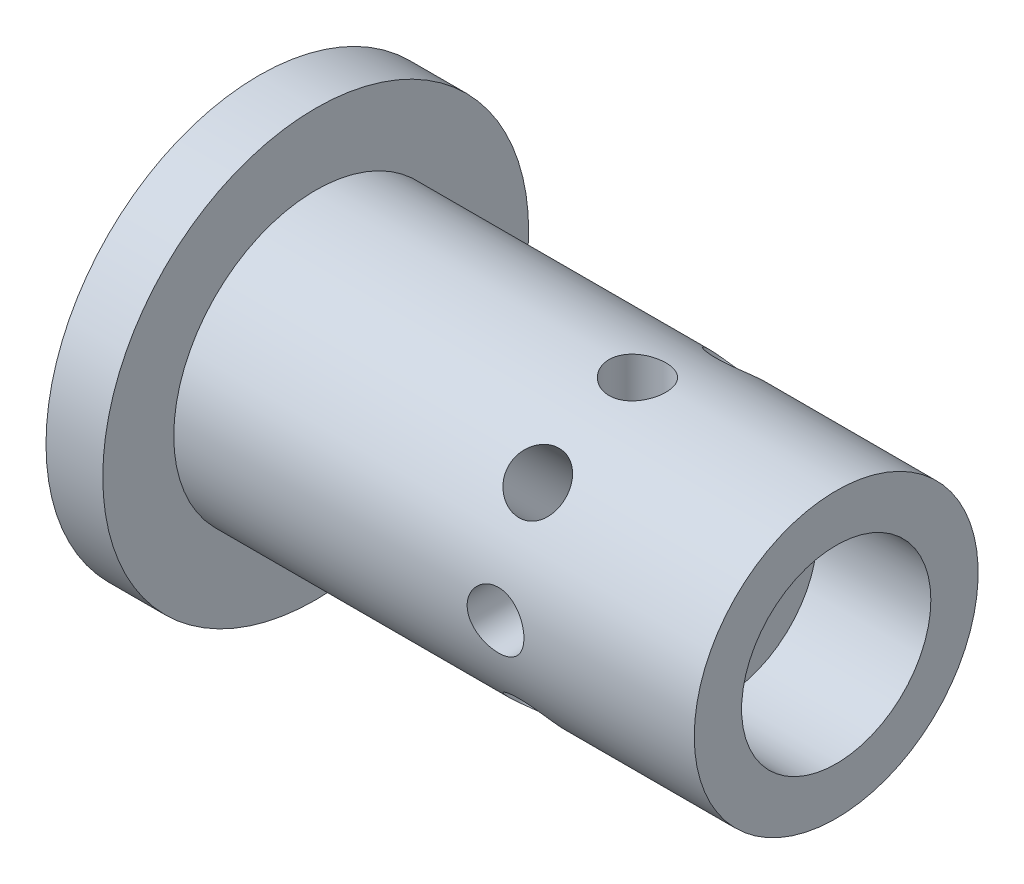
ISO-10303-21;
HEADER;
FILE_DESCRIPTION(('STEP AP214'),'2;1');
FILE_NAME('part.step','',(''),(''),'','','');
FILE_SCHEMA(('AUTOMOTIVE_DESIGN { 1 0 10303 214 1 1 1 1 }'));
ENDSEC;
DATA;
#1=APPLICATION_CONTEXT('core data for automotive mechanical design processes');
#2=APPLICATION_PROTOCOL_DEFINITION('international standard','automotive_design',2000,#1);
#3=PRODUCT_CONTEXT('',#1,'mechanical');
#4=PRODUCT('Part','Part','',(#3));
#5=PRODUCT_RELATED_PRODUCT_CATEGORY('part','',(#4));
#6=PRODUCT_DEFINITION_FORMATION('','',#4);
#7=PRODUCT_DEFINITION_CONTEXT('part definition',#1,'design');
#8=PRODUCT_DEFINITION('design','',#6,#7);
#9=PRODUCT_DEFINITION_SHAPE('','',#8);
#10=(LENGTH_UNIT() NAMED_UNIT(*) SI_UNIT(.MILLI.,.METRE.));
#11=(NAMED_UNIT(*) PLANE_ANGLE_UNIT() SI_UNIT($,.RADIAN.));
#12=(NAMED_UNIT(*) SI_UNIT($,.STERADIAN.) SOLID_ANGLE_UNIT());
#13=UNCERTAINTY_MEASURE_WITH_UNIT(LENGTH_MEASURE(1.E-05),#10,'distance_accuracy_value','');
#14=(GEOMETRIC_REPRESENTATION_CONTEXT(3) GLOBAL_UNCERTAINTY_ASSIGNED_CONTEXT((#13)) GLOBAL_UNIT_ASSIGNED_CONTEXT((#10,
#11,#12)) REPRESENTATION_CONTEXT('',''));
#15=CARTESIAN_POINT('',(0.,0.,0.));
#16=DIRECTION('',(0.,0.,1.));
#17=DIRECTION('',(1.,0.,0.));
#18=AXIS2_PLACEMENT_3D('',#15,#16,#17);
#19=CARTESIAN_POINT('',(0.,0.,0.));
#20=DIRECTION('',(1.,0.,0.));
#21=DIRECTION('',(0.,0.,-1.));
#22=AXIS2_PLACEMENT_3D('',#19,#20,#21);
#23=PLANE('',#22);
#24=CARTESIAN_POINT('',(0.,0.,0.));
#25=DIRECTION('',(-1.,0.,0.));
#26=DIRECTION('',(0.,0.,1.));
#27=AXIS2_PLACEMENT_3D('',#24,#25,#26);
#28=CIRCLE('',#27,6.);
#29=CARTESIAN_POINT('',(0.,0.,6.));
#30=VERTEX_POINT('',#29);
#31=EDGE_CURVE('E259',#30,#30,#28,.T.);
#32=ORIENTED_EDGE('',*,*,#31,.F.);
#33=EDGE_LOOP('',(#32));
#34=FACE_BOUND('',#33,.T.);
#35=CARTESIAN_POINT('',(0.,0.,0.));
#36=DIRECTION('',(-1.,0.,0.));
#37=DIRECTION('',(0.,0.,1.));
#38=AXIS2_PLACEMENT_3D('',#35,#36,#37);
#39=CIRCLE('',#38,22.5);
#40=CARTESIAN_POINT('',(0.,0.,22.5));
#41=VERTEX_POINT('',#40);
#42=EDGE_CURVE('E102',#41,#41,#39,.T.);
#43=ORIENTED_EDGE('',*,*,#42,.T.);
#44=EDGE_LOOP('',(#43));
#45=FACE_BOUND('',#44,.T.);
#46=ADVANCED_FACE('F30',(#34,#45),#23,.F.);
#47=CARTESIAN_POINT('',(-15.8054964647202,0.,0.));
#48=DIRECTION('',(-1.,0.,0.));
#49=DIRECTION('',(0.,0.,1.));
#50=AXIS2_PLACEMENT_3D('',#47,#48,#49);
#51=CYLINDRICAL_SURFACE('',#50,22.5);
#52=ORIENTED_EDGE('',*,*,#42,.F.);
#53=EDGE_LOOP('',(#52));
#54=FACE_BOUND('',#53,.T.);
#55=CARTESIAN_POINT('',(6.,0.,0.));
#56=DIRECTION('',(-1.,0.,0.));
#57=DIRECTION('',(0.,0.,1.));
#58=AXIS2_PLACEMENT_3D('',#55,#56,#57);
#59=CIRCLE('',#58,22.5);
#60=CARTESIAN_POINT('',(6.,0.,22.5));
#61=VERTEX_POINT('',#60);
#62=EDGE_CURVE('E234',#61,#61,#59,.T.);
#63=ORIENTED_EDGE('',*,*,#62,.T.);
#64=EDGE_LOOP('',(#63));
#65=FACE_BOUND('',#64,.T.);
#66=ADVANCED_FACE('F221',(#54,#65),#51,.T.);
#67=CARTESIAN_POINT('',(6.,22.5,0.));
#68=DIRECTION('',(-1.,0.,0.));
#69=DIRECTION('',(0.,0.,1.));
#70=AXIS2_PLACEMENT_3D('',#67,#68,#69);
#71=PLANE('',#70);
#72=ORIENTED_EDGE('',*,*,#62,.F.);
#73=EDGE_LOOP('',(#72));
#74=FACE_BOUND('',#73,.T.);
#75=CARTESIAN_POINT('',(6.,0.,0.));
#76=DIRECTION('',(-1.,0.,0.));
#77=DIRECTION('',(0.,0.,1.));
#78=AXIS2_PLACEMENT_3D('',#75,#76,#77);
#79=CIRCLE('',#78,15.);
#80=CARTESIAN_POINT('',(6.,0.,15.));
#81=VERTEX_POINT('',#80);
#82=EDGE_CURVE('E235',#81,#81,#79,.T.);
#83=ORIENTED_EDGE('',*,*,#82,.T.);
#84=EDGE_LOOP('',(#83));
#85=FACE_BOUND('',#84,.T.);
#86=ADVANCED_FACE('F218',(#74,#85),#71,.F.);
#87=CARTESIAN_POINT('',(-15.8054964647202,0.,0.));
#88=DIRECTION('',(-1.,0.,0.));
#89=DIRECTION('',(0.,0.,1.));
#90=AXIS2_PLACEMENT_3D('',#87,#88,#89);
#91=CYLINDRICAL_SURFACE('',#90,15.);
#92=CARTESIAN_POINT('',(40.,8.27098450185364,-12.5136251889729));
#93=CARTESIAN_POINT('',(39.8333068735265,8.27099120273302,-12.5136231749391));
#94=CARTESIAN_POINT('',(39.66653613,8.28286904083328,-12.5057949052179));
#95=CARTESIAN_POINT('',(39.3377124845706,8.32985653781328,-12.4745443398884));
#96=CARTESIAN_POINT('',(39.1756634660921,8.36498478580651,-12.4511095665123));
#97=CARTESIAN_POINT('',(38.8610880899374,8.45684073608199,-12.388902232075));
#98=CARTESIAN_POINT('',(38.7085524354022,8.51354695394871,-12.3501449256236));
#99=CARTESIAN_POINT('',(38.4169754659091,8.64613873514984,-12.2576828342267));
#100=CARTESIAN_POINT('',(38.2779333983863,8.72202322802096,-12.203978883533));
#101=CARTESIAN_POINT('',(38.0153169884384,8.89103463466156,-12.0814116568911));
#102=CARTESIAN_POINT('',(37.8919612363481,8.98436806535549,-12.0123647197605));
#103=CARTESIAN_POINT('',(37.6661273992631,9.18408233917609,-11.8603688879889));
#104=CARTESIAN_POINT('',(37.5636507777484,9.29046409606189,-11.7774190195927));
#105=CARTESIAN_POINT('',(37.3816359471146,9.51341451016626,-11.5980841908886));
#106=CARTESIAN_POINT('',(37.3023054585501,9.63006387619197,-11.5015884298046));
#107=CARTESIAN_POINT('',(37.1701751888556,9.86862241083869,-11.2975614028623));
#108=CARTESIAN_POINT('',(37.117372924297,9.99053108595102,-11.1900311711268));
#109=CARTESIAN_POINT('',(37.0404784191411,10.2338569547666,-10.967904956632));
#110=CARTESIAN_POINT('',(37.016017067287,10.3552594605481,-10.8534207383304));
#111=CARTESIAN_POINT('',(36.9953471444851,10.5953388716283,-10.6191764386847));
#112=CARTESIAN_POINT('',(36.9991358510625,10.7140160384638,-10.4994168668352));
#113=CARTESIAN_POINT('',(37.0345785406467,10.9435657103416,-10.259898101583));
#114=CARTESIAN_POINT('',(37.0658349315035,11.0545252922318,-10.1401631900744));
#115=CARTESIAN_POINT('',(37.1546950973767,11.267718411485,-9.90272672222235));
#116=CARTESIAN_POINT('',(37.2122999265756,11.369951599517,-9.78502524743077));
#117=CARTESIAN_POINT('',(37.3525901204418,11.5641496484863,-9.55475244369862));
#118=CARTESIAN_POINT('',(37.4354312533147,11.6560457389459,-9.44221811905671));
#119=CARTESIAN_POINT('',(37.6237272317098,11.8272301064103,-9.22689422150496));
#120=CARTESIAN_POINT('',(37.7291846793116,11.9065169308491,-9.12410577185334));
#121=CARTESIAN_POINT('',(37.9619008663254,12.0526232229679,-8.93024573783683));
#122=CARTESIAN_POINT('',(38.0895075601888,12.1192012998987,-8.83940960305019));
#123=CARTESIAN_POINT('',(38.3617493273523,12.2373332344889,-8.67513365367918));
#124=CARTESIAN_POINT('',(38.5063847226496,12.2888868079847,-8.60169416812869));
#125=CARTESIAN_POINT('',(38.8090624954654,12.3765111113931,-8.47513649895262));
#126=CARTESIAN_POINT('',(38.967132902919,12.412548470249,-8.4220621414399));
#127=CARTESIAN_POINT('',(39.291913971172,12.4686014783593,-8.33885601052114));
#128=CARTESIAN_POINT('',(39.4586235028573,12.4886192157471,-8.30872124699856));
#129=CARTESIAN_POINT('',(39.7928945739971,12.5122279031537,-8.27312555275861));
#130=CARTESIAN_POINT('',(39.960392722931,12.5160940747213,-8.26725124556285));
#131=CARTESIAN_POINT('',(40.2941446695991,12.508116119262,-8.27931650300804));
#132=CARTESIAN_POINT('',(40.4603985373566,12.4962728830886,-8.29725471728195));
#133=CARTESIAN_POINT('',(40.7853059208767,12.4571875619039,-8.35581744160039));
#134=CARTESIAN_POINT('',(40.9440170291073,12.4300942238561,-8.3962227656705));
#135=CARTESIAN_POINT('',(41.2511898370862,12.3608825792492,-8.4977841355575));
#136=CARTESIAN_POINT('',(41.3996506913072,12.3187630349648,-8.5589418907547));
#137=CARTESIAN_POINT('',(41.6842393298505,12.2192680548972,-8.70040429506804));
#138=CARTESIAN_POINT('',(41.8201811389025,12.1617009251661,-8.78094812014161));
#139=CARTESIAN_POINT('',(42.0739249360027,12.0321985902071,-8.95757566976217));
#140=CARTESIAN_POINT('',(42.1917250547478,11.9602619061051,-9.05366099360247));
#141=CARTESIAN_POINT('',(42.4076876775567,11.8017233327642,-9.25939610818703));
#142=CARTESIAN_POINT('',(42.50552096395,11.7149132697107,-9.36923148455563));
#143=CARTESIAN_POINT('',(42.6764376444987,11.5288227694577,-9.59728466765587));
#144=CARTESIAN_POINT('',(42.7495220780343,11.429542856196,-9.71550212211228));
#145=CARTESIAN_POINT('',(42.8683866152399,11.2210965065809,-9.95550541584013));
#146=CARTESIAN_POINT('',(42.9143215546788,11.1119903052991,-10.0772667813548));
#147=CARTESIAN_POINT('',(42.9780737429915,10.8860258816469,-10.3209508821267));
#148=CARTESIAN_POINT('',(42.995894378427,10.7691685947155,-10.4428735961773));
#149=CARTESIAN_POINT('',(43.0027809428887,10.5330184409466,-10.6809715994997));
#150=CARTESIAN_POINT('',(42.9923418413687,10.4138033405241,-10.7972099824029));
#151=CARTESIAN_POINT('',(42.9440981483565,10.1745511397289,-11.0229563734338));
#152=CARTESIAN_POINT('',(42.9062939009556,10.0545140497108,-11.1324644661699));
#153=CARTESIAN_POINT('',(42.8046130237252,9.8176874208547,-11.3418677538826));
#154=CARTESIAN_POINT('',(42.7407958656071,9.70089111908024,-11.441784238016));
#155=CARTESIAN_POINT('',(42.5889632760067,9.47408394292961,-11.6302839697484));
#156=CARTESIAN_POINT('',(42.5009459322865,9.36407360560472,-11.7188663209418));
#157=CARTESIAN_POINT('',(42.3015418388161,9.15288655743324,-11.8845696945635));
#158=CARTESIAN_POINT('',(42.1898009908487,9.05188098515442,-11.9614827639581));
#159=CARTESIAN_POINT('',(41.9468492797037,8.86442413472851,-12.1010609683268));
#160=CARTESIAN_POINT('',(41.8156338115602,8.77797630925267,-12.1637227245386));
#161=CARTESIAN_POINT('',(41.5357620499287,8.62219395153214,-12.274650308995));
#162=CARTESIAN_POINT('',(41.3869331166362,8.55305378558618,-12.3227538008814));
#163=CARTESIAN_POINT('',(41.0772016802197,8.43612682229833,-12.4030978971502));
#164=CARTESIAN_POINT('',(40.9163102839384,8.38832065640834,-12.4353528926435));
#165=CARTESIAN_POINT('',(40.6292126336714,8.32539252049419,-12.4775340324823));
#166=CARTESIAN_POINT('',(40.5046437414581,8.30504116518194,-12.4910591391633));
#167=CARTESIAN_POINT('',(40.2533981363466,8.27783484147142,-12.5091053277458));
#168=CARTESIAN_POINT('',(40.1267214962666,8.27097940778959,-12.513626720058));
#169=CARTESIAN_POINT('',(40.,8.27098450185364,-12.5136251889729));
#170=B_SPLINE_CURVE_WITH_KNOTS('',3,(#92,#93,#94,#95,#96,#97,#98,#99,#100,#101,#102,#103,#104,
#105,#106,#107,#108,#109,#110,#111,#112,#113,#114,#115,#116,#117,#118,#119,#120,#121,#122,#123,
#124,#125,#126,#127,#128,#129,#130,#131,#132,#133,#134,#135,#136,#137,#138,#139,#140,#141,#142,
#143,#144,#145,#146,#147,#148,#149,#150,#151,#152,#153,#154,#155,#156,#157,#158,#159,#160,#161,
#162,#163,#164,#165,#166,#167,#168,#169),.UNSPECIFIED.,.T.,.F.,(4,2,2,2,2,2,2,2,2,2,2,2,2,2,2,2,
2,2,2,2,2,2,2,2,2,2,2,2,2,2,2,2,2,2,2,2,2,2,4),(0.,0.499615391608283,0.99963071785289,
1.49914949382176,1.99864039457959,2.50446757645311,3.01033020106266,3.52060201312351,
4.03082604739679,4.53432746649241,5.03778036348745,5.53406368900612,6.03036687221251,
6.5297977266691,7.02928607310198,7.5374804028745,8.04568434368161,8.55497589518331,
9.06420105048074,9.56471273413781,10.0651960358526,10.5608802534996,11.056605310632,
11.5587917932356,12.0610299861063,12.5709780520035,13.0809046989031,13.5878944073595,
14.0948230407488,14.5929305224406,15.0910317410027,15.5880005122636,16.0850085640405,
16.5900345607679,17.0951801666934,17.6057669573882,18.1158892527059,18.4957141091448,
18.8755258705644),.UNSPECIFIED.);
#171=CARTESIAN_POINT('',(40.,8.27098450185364,-12.5136251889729));
#172=VERTEX_POINT('',#171);
#173=EDGE_CURVE('E184',#172,#172,#170,.T.);
#174=ORIENTED_EDGE('',*,*,#173,.F.);
#175=EDGE_LOOP('',(#174));
#176=FACE_BOUND('',#175,.T.);
#177=CARTESIAN_POINT('',(40.,14.6969384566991,-2.99999999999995));
#178=CARTESIAN_POINT('',(39.8333068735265,14.6969417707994,-2.99999383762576));
#179=CARTESIAN_POINT('',(39.66653613,14.6998052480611,-2.98605951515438));
#180=CARTESIAN_POINT('',(39.3377124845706,14.7109329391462,-2.93073685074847));
#181=CARTESIAN_POINT('',(39.1756634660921,14.7192014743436,-2.88932654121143));
#182=CARTESIAN_POINT('',(38.8610880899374,14.7401662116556,-2.78038734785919));
#183=CARTESIAN_POINT('',(38.7085524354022,14.7528580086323,-2.71288444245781));
#184=CARTESIAN_POINT('',(38.4169754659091,14.7812339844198,-2.55374732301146));
#185=CARTESIAN_POINT('',(38.2779333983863,14.7969179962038,-2.4621144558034));
#186=CARTESIAN_POINT('',(38.0153169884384,14.8297589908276,-2.25593722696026));
#187=CARTESIAN_POINT('',(37.8919612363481,14.8469321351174,-2.1411169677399));
#188=CARTESIAN_POINT('',(37.6661273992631,14.880674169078,-1.89242036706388));
#189=CARTESIAN_POINT('',(37.5636507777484,14.8972430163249,-1.7585426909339));
#190=CARTESIAN_POINT('',(37.3816359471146,14.9280838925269,-1.47408406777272));
#191=CARTESIAN_POINT('',(37.3023054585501,14.9423346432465,-1.32336770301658));
#192=CARTESIAN_POINT('',(37.1701751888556,14.9667521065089,-1.01041245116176));
#193=CARTESIAN_POINT('',(37.117372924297,14.9769192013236,-0.848174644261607));
#194=CARTESIAN_POINT('',(37.0404784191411,14.9919096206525,-0.51905031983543));
#195=CARTESIAN_POINT('',(37.016017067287,14.9968015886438,-0.35225321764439));
#196=CARTESIAN_POINT('',(36.9953471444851,15.0009276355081,-0.0168557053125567));
#197=CARTESIAN_POINT('',(36.9991358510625,15.0001622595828,0.151744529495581));
#198=CARTESIAN_POINT('',(37.0345785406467,14.9931130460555,0.483426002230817));
#199=CARTESIAN_POINT('',(37.0658349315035,14.9869079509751,0.646551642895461));
#200=CARTESIAN_POINT('',(37.1546950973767,14.9697653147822,0.965194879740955));
#201=CARTESIAN_POINT('',(37.2122999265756,14.9588275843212,1.12071217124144));
#202=CARTESIAN_POINT('',(37.3525901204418,14.9333188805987,1.42085838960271));
#203=CARTESIAN_POINT('',(37.4354312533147,14.9187254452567,1.56541252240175));
#204=CARTESIAN_POINT('',(37.6237272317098,14.8875140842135,1.83871513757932));
#205=CARTESIAN_POINT('',(37.7291846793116,14.8708959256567,1.96746179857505));
#206=CARTESIAN_POINT('',(37.9619008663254,14.8371289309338,2.20785429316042));
#207=CARTESIAN_POINT('',(38.0895075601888,14.8199758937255,2.31916294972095));
#208=CARTESIAN_POINT('',(38.3617493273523,14.7873471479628,2.51885547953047));
#209=CARTESIAN_POINT('',(38.5063847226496,14.7718714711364,2.6072389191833));
#210=CARTESIAN_POINT('',(38.8090624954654,14.7443414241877,2.7586884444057));
#211=CARTESIAN_POINT('',(38.967132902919,14.7322944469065,2.82169994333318));
#212=CARTESIAN_POINT('',(39.291913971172,14.7130942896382,2.9201710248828));
#213=CARTESIAN_POINT('',(39.4586235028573,14.7059404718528,2.95563419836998));
#214=CARTESIAN_POINT('',(39.7928945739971,14.6974643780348,2.99749801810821));
#215=CARTESIAN_POINT('',(39.960392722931,14.6960444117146,3.00438557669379));
#216=CARTESIAN_POINT('',(40.2941446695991,14.6989345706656,2.99021288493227));
#217=CARTESIAN_POINT('',(40.4603985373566,14.7032443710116,2.96915421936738));
#218=CARTESIAN_POINT('',(40.7853059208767,14.7170169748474,2.90010662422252));
#219=CARTESIAN_POINT('',(40.9440170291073,14.7264299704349,2.85237786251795));
#220=CARTESIAN_POINT('',(41.2511898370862,14.7493046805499,2.73162310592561));
#221=CARTESIAN_POINT('',(41.3996506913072,14.7627667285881,2.65859502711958));
#222=CARTESIAN_POINT('',(41.6842393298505,14.7924421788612,2.48821242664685));
#223=CARTESIAN_POINT('',(41.8201811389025,14.8086891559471,2.39055323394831));
#224=CARTESIAN_POINT('',(42.0739249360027,14.8420117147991,2.17408671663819));
#225=CARTESIAN_POINT('',(42.1917250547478,14.8590873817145,2.05527721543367));
#226=CARTESIAN_POINT('',(42.4076876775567,14.8924603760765,1.79769682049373));
#227=CARTESIAN_POINT('',(42.50552096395,14.9087417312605,1.65864749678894));
#228=CARTESIAN_POINT('',(42.6764376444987,14.9384138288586,1.36580368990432));
#229=CARTESIAN_POINT('',(42.7495220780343,14.9518046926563,1.21200982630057));
#230=CARTESIAN_POINT('',(42.8683866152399,14.974118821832,0.894908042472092));
#231=CARTESIAN_POINT('',(42.9143215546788,14.9830673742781,0.731660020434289));
#232=CARTESIAN_POINT('',(42.9780737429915,14.9955970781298,0.399568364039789));
#233=CARTESIAN_POINT('',(42.995894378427,14.9991788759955,0.230725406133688));
#234=CARTESIAN_POINT('',(43.0027809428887,15.0005562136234,-0.10461868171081));
#235=CARTESIAN_POINT('',(42.9923418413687,14.9984513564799,-0.271109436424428));
#236=CARTESIAN_POINT('',(42.9440981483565,14.9889013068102,-0.599913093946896));
#237=CARTESIAN_POINT('',(42.9062939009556,14.9814561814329,-0.762226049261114));
#238=CARTESIAN_POINT('',(42.8046130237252,14.9620649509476,-1.07775824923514));
#239=CARTESIAN_POINT('',(42.7407958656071,14.9501291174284,-1.23099732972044));
#240=CARTESIAN_POINT('',(42.5889632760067,14.9230416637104,-1.52466366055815));
#241=CARTESIAN_POINT('',(42.5009459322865,14.9078897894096,-1.66508989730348));
#242=CARTESIAN_POINT('',(42.3015418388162,14.8757279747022,-1.93159167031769));
#243=CARTESIAN_POINT('',(42.1898009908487,14.858692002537,-2.05739914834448));
#244=CARTESIAN_POINT('',(41.9468492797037,14.8248366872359,-2.28864785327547));
#245=CARTESIAN_POINT('',(41.8156338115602,14.8080173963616,-2.39408424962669));
#246=CARTESIAN_POINT('',(41.5357620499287,14.7763002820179,-2.58267665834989));
#247=CARTESIAN_POINT('',(41.3869331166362,14.7614251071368,-2.66558044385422));
#248=CARTESIAN_POINT('',(41.0772016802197,14.7355571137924,-2.80507214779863));
#249=CARTESIAN_POINT('',(40.9163102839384,14.7245607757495,-2.86168393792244));
#250=CARTESIAN_POINT('',(40.6292126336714,14.7098904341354,-2.93600741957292));
#251=CARTESIAN_POINT('',(40.5046437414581,14.7050635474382,-2.959961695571));
#252=CARTESIAN_POINT('',(40.2533981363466,14.6985863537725,-2.99196005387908));
#253=CARTESIAN_POINT('',(40.1267214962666,14.6969359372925,-3.00000468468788));
#254=CARTESIAN_POINT('',(40.,14.6969384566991,-2.99999999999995));
#255=B_SPLINE_CURVE_WITH_KNOTS('',3,(#177,#178,#179,#180,#181,#182,#183,#184,#185,#186,#187,
#188,#189,#190,#191,#192,#193,#194,#195,#196,#197,#198,#199,#200,#201,#202,#203,#204,#205,#206,
#207,#208,#209,#210,#211,#212,#213,#214,#215,#216,#217,#218,#219,#220,#221,#222,#223,#224,#225,
#226,#227,#228,#229,#230,#231,#232,#233,#234,#235,#236,#237,#238,#239,#240,#241,#242,#243,#244,
#245,#246,#247,#248,#249,#250,#251,#252,#253,#254),.UNSPECIFIED.,.T.,.F.,(4,2,2,2,2,2,2,2,2,2,2,
2,2,2,2,2,2,2,2,2,2,2,2,2,2,2,2,2,2,2,2,2,2,2,2,2,2,2,4),(0.,0.499615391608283,
0.999630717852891,1.49914949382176,1.99864039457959,2.50446757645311,3.01033020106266,
3.52060201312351,4.0308260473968,4.53432746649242,5.03778036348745,5.53406368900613,
6.03036687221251,6.5297977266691,7.02928607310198,7.5374804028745,8.04568434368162,
8.5549758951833,9.06420105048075,9.56471273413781,10.0651960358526,10.5608802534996,
11.056605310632,11.5587917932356,12.0610299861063,12.5709780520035,13.0809046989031,
13.5878944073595,14.0948230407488,14.5929305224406,15.0910317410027,15.5880005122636,
16.0850085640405,16.5900345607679,17.0951801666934,17.6057669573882,18.115889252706,
18.4957141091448,18.8755258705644),.UNSPECIFIED.);
#256=CARTESIAN_POINT('',(40.,14.6969384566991,-2.99999999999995));
#257=VERTEX_POINT('',#256);
#258=EDGE_CURVE('E297',#257,#257,#255,.T.);
#259=ORIENTED_EDGE('',*,*,#258,.F.);
#260=EDGE_LOOP('',(#259));
#261=FACE_BOUND('',#260,.T.);
#262=CARTESIAN_POINT('',(40.,12.5136251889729,8.27098450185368));
#263=CARTESIAN_POINT('',(39.8333068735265,12.5136231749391,8.27099120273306));
#264=CARTESIAN_POINT('',(39.66653613,12.5057949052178,8.28286904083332));
#265=CARTESIAN_POINT('',(39.3377124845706,12.4745443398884,8.32985653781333));
#266=CARTESIAN_POINT('',(39.1756634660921,12.4511095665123,8.36498478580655));
#267=CARTESIAN_POINT('',(38.8610880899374,12.388902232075,8.45684073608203));
#268=CARTESIAN_POINT('',(38.7085524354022,12.3501449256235,8.51354695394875));
#269=CARTESIAN_POINT('',(38.4169754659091,12.2576828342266,8.64613873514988));
#270=CARTESIAN_POINT('',(38.2779333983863,12.203978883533,8.722023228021));
#271=CARTESIAN_POINT('',(38.0153169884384,12.0814116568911,8.8910346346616));
#272=CARTESIAN_POINT('',(37.8919612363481,12.0123647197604,8.98436806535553));
#273=CARTESIAN_POINT('',(37.6661273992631,11.8603688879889,9.18408233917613));
#274=CARTESIAN_POINT('',(37.5636507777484,11.7774190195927,9.29046409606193));
#275=CARTESIAN_POINT('',(37.3816359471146,11.5980841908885,9.5134145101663));
#276=CARTESIAN_POINT('',(37.3023054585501,11.5015884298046,9.63006387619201));
#277=CARTESIAN_POINT('',(37.1701751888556,11.2975614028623,9.86862241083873));
#278=CARTESIAN_POINT('',(37.117372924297,11.1900311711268,9.99053108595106));
#279=CARTESIAN_POINT('',(37.0404784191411,10.9679049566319,10.2338569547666));
#280=CARTESIAN_POINT('',(37.016017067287,10.8534207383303,10.3552594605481));
#281=CARTESIAN_POINT('',(36.9953471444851,10.6191764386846,10.5953388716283));
#282=CARTESIAN_POINT('',(36.9991358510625,10.4994168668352,10.7140160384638));
#283=CARTESIAN_POINT('',(37.0345785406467,10.259898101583,10.9435657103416));
#284=CARTESIAN_POINT('',(37.0658349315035,10.1401631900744,11.0545252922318));
#285=CARTESIAN_POINT('',(37.1546950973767,9.90272672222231,11.2677184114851));
#286=CARTESIAN_POINT('',(37.2122999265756,9.78502524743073,11.369951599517));
#287=CARTESIAN_POINT('',(37.3525901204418,9.55475244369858,11.5641496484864));
#288=CARTESIAN_POINT('',(37.4354312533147,9.44221811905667,11.6560457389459));
#289=CARTESIAN_POINT('',(37.6237272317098,9.22689422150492,11.8272301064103));
#290=CARTESIAN_POINT('',(37.7291846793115,9.1241057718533,11.9065169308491));
#291=CARTESIAN_POINT('',(37.9619008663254,8.93024573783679,12.052623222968));
#292=CARTESIAN_POINT('',(38.0895075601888,8.83940960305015,12.1192012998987));
#293=CARTESIAN_POINT('',(38.3617493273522,8.67513365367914,12.237333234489));
#294=CARTESIAN_POINT('',(38.5063847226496,8.60169416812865,12.2888868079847));
#295=CARTESIAN_POINT('',(38.8090624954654,8.47513649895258,12.3765111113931));
#296=CARTESIAN_POINT('',(38.967132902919,8.42206214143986,12.4125484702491));
#297=CARTESIAN_POINT('',(39.291913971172,8.33885601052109,12.4686014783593));
#298=CARTESIAN_POINT('',(39.4586235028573,8.30872124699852,12.4886192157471));
#299=CARTESIAN_POINT('',(39.7928945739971,8.27312555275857,12.5122279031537));
#300=CARTESIAN_POINT('',(39.960392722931,8.26725124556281,12.5160940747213));
#301=CARTESIAN_POINT('',(40.2941446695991,8.279316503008,12.508116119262));
#302=CARTESIAN_POINT('',(40.4603985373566,8.29725471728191,12.4962728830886));
#303=CARTESIAN_POINT('',(40.7853059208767,8.35581744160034,12.4571875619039));
#304=CARTESIAN_POINT('',(40.9440170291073,8.39622276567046,12.4300942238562));
#305=CARTESIAN_POINT('',(41.2511898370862,8.49778413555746,12.3608825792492));
#306=CARTESIAN_POINT('',(41.3996506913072,8.55894189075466,12.3187630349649));
#307=CARTESIAN_POINT('',(41.6842393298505,8.700404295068,12.2192680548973));
#308=CARTESIAN_POINT('',(41.8201811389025,8.78094812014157,12.1617009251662));
#309=CARTESIAN_POINT('',(42.0739249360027,8.95757566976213,12.0321985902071));
#310=CARTESIAN_POINT('',(42.1917250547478,9.05366099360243,11.9602619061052));
#311=CARTESIAN_POINT('',(42.4076876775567,9.25939610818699,11.8017233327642));
#312=CARTESIAN_POINT('',(42.50552096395,9.36923148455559,11.7149132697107));
#313=CARTESIAN_POINT('',(42.6764376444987,9.59728466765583,11.5288227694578));
#314=CARTESIAN_POINT('',(42.7495220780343,9.71550212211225,11.429542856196));
#315=CARTESIAN_POINT('',(42.8683866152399,9.9555054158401,11.2210965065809));
#316=CARTESIAN_POINT('',(42.9143215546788,10.0772667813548,11.1119903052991));
#317=CARTESIAN_POINT('',(42.9780737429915,10.3209508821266,10.886025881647));
#318=CARTESIAN_POINT('',(42.995894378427,10.4428735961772,10.7691685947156));
#319=CARTESIAN_POINT('',(43.0027809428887,10.6809715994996,10.5330184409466));
#320=CARTESIAN_POINT('',(42.9923418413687,10.7972099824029,10.4138033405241));
#321=CARTESIAN_POINT('',(42.9440981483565,11.0229563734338,10.1745511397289));
#322=CARTESIAN_POINT('',(42.9062939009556,11.1324644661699,10.0545140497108));
#323=CARTESIAN_POINT('',(42.8046130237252,11.3418677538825,9.81768742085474));
#324=CARTESIAN_POINT('',(42.7407958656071,11.4417842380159,9.70089111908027));
#325=CARTESIAN_POINT('',(42.5889632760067,11.6302839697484,9.47408394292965));
#326=CARTESIAN_POINT('',(42.5009459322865,11.7188663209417,9.36407360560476));
#327=CARTESIAN_POINT('',(42.3015418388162,11.8845696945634,9.15288655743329));
#328=CARTESIAN_POINT('',(42.1898009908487,11.961482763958,9.05188098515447));
#329=CARTESIAN_POINT('',(41.9468492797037,12.1010609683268,8.86442413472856));
#330=CARTESIAN_POINT('',(41.8156338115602,12.1637227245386,8.77797630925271));
#331=CARTESIAN_POINT('',(41.5357620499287,12.274650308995,8.62219395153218));
#332=CARTESIAN_POINT('',(41.3869331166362,12.3227538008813,8.55305378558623));
#333=CARTESIAN_POINT('',(41.0772016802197,12.4030978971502,8.43612682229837));
#334=CARTESIAN_POINT('',(40.9163102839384,12.4353528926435,8.38832065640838));
#335=CARTESIAN_POINT('',(40.6292126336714,12.4775340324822,8.32539252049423));
#336=CARTESIAN_POINT('',(40.5046437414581,12.4910591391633,8.30504116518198));
#337=CARTESIAN_POINT('',(40.2533981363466,12.5091053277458,8.27783484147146));
#338=CARTESIAN_POINT('',(40.1267214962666,12.513626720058,8.27097940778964));
#339=CARTESIAN_POINT('',(40.,12.5136251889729,8.27098450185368));
#340=B_SPLINE_CURVE_WITH_KNOTS('',3,(#262,#263,#264,#265,#266,#267,#268,#269,#270,#271,#272,
#273,#274,#275,#276,#277,#278,#279,#280,#281,#282,#283,#284,#285,#286,#287,#288,#289,#290,#291,
#292,#293,#294,#295,#296,#297,#298,#299,#300,#301,#302,#303,#304,#305,#306,#307,#308,#309,#310,
#311,#312,#313,#314,#315,#316,#317,#318,#319,#320,#321,#322,#323,#324,#325,#326,#327,#328,#329,
#330,#331,#332,#333,#334,#335,#336,#337,#338,#339),.UNSPECIFIED.,.T.,.F.,(4,2,2,2,2,2,2,2,2,2,2,
2,2,2,2,2,2,2,2,2,2,2,2,2,2,2,2,2,2,2,2,2,2,2,2,2,2,2,4),(0.,0.499615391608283,
0.999630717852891,1.49914949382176,1.99864039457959,2.50446757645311,3.01033020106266,
3.52060201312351,4.0308260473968,4.53432746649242,5.03778036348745,5.53406368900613,
6.03036687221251,6.5297977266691,7.02928607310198,7.53748040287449,8.04568434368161,
8.55497589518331,9.06420105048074,9.56471273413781,10.0651960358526,10.5608802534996,
11.056605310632,11.5587917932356,12.0610299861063,12.5709780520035,13.0809046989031,
13.5878944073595,14.0948230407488,14.5929305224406,15.0910317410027,15.5880005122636,
16.0850085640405,16.5900345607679,17.0951801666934,17.6057669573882,18.1158892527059,
18.4957141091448,18.8755258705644),.UNSPECIFIED.);
#341=CARTESIAN_POINT('',(40.,12.5136251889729,8.27098450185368));
#342=VERTEX_POINT('',#341);
#343=EDGE_CURVE('E315',#342,#342,#340,.T.);
#344=ORIENTED_EDGE('',*,*,#343,.F.);
#345=EDGE_LOOP('',(#344));
#346=FACE_BOUND('',#345,.T.);
#347=CARTESIAN_POINT('',(37.,0.,15.));
#348=CARTESIAN_POINT('',(37.000006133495,-0.166730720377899,14.9999969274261));
#349=CARTESIAN_POINT('',(37.0139465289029,-0.333538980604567,14.9971915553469));
#350=CARTESIAN_POINT('',(37.0692955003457,-0.662440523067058,14.9862709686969));
#351=CARTESIAN_POINT('',(37.1107258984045,-0.824529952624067,14.9781515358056));
#352=CARTESIAN_POINT('',(37.2197238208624,-1.13919091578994,14.9575094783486));
#353=CARTESIAN_POINT('',(37.2872663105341,-1.2917714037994,14.9449910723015));
#354=CARTESIAN_POINT('',(37.4464967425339,-1.58342396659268,14.9169119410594));
#355=CARTESIAN_POINT('',(37.5381832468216,-1.72249684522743,14.9013513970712));
#356=CARTESIAN_POINT('',(37.7444154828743,-1.98508043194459,14.8686649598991));
#357=CARTESIAN_POINT('',(37.8592250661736,-2.10838185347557,14.8515223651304));
#358=CARTESIAN_POINT('',(38.1078772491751,-2.33411026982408,14.8177254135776));
#359=CARTESIAN_POINT('',(38.2417213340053,-2.43653563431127,14.8010710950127));
#360=CARTESIAN_POINT('',(38.5261485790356,-2.61849526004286,14.7699732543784));
#361=CARTESIAN_POINT('',(38.6768729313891,-2.6978128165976,14.7555512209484));
#362=CARTESIAN_POINT('',(38.9898454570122,-2.82991699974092,14.7307880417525));
#363=CARTESIAN_POINT('',(39.152092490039,-2.88270624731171,14.7204464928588));
#364=CARTESIAN_POINT('',(39.4812530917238,-2.95957589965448,14.7051841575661));
#365=CARTESIAN_POINT('',(39.6480776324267,-2.98402349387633,14.7001941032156));
#366=CARTESIAN_POINT('',(39.983529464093,-3.00465638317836,14.6959912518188));
#367=CARTESIAN_POINT('',(40.1521565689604,-3.0008445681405,14.6967778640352));
#368=CARTESIAN_POINT('',(40.483740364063,-2.96536371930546,14.7039765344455));
#369=CARTESIAN_POINT('',(40.6467442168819,-2.93411562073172,14.7103035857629));
#370=CARTESIAN_POINT('',(40.965148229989,-2.84531365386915,14.7277363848));
#371=CARTESIAN_POINT('',(41.120548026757,-2.78775852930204,14.7388423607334));
#372=CARTESIAN_POINT('',(41.4205457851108,-2.64757435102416,14.7646685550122));
#373=CARTESIAN_POINT('',(41.5650636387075,-2.56477845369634,14.7794126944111));
#374=CARTESIAN_POINT('',(41.8383125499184,-2.37658072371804,14.8108385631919));
#375=CARTESIAN_POINT('',(41.9670417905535,-2.27117629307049,14.827520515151));
#376=CARTESIAN_POINT('',(42.2074882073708,-2.03849980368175,14.8613106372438));
#377=CARTESIAN_POINT('',(42.3188577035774,-1.91086848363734,14.8784210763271));
#378=CARTESIAN_POINT('',(42.5186615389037,-1.63855507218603,14.9108654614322));
#379=CARTESIAN_POINT('',(42.6070955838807,-1.49387276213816,14.9261993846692));
#380=CARTESIAN_POINT('',(42.7585825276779,-1.19117816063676,14.9534007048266));
#381=CARTESIAN_POINT('',(42.8215956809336,-1.0331454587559,14.9652626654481));
#382=CARTESIAN_POINT('',(42.9200814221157,-0.708446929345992,14.9841422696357));
#383=CARTESIAN_POINT('',(42.9555573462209,-0.541782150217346,14.9911605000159));
#384=CARTESIAN_POINT('',(42.9974693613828,-0.20753821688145,14.999480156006));
#385=CARTESIAN_POINT('',(43.0043812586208,-0.040020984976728,15.0008752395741));
#386=CARTESIAN_POINT('',(42.9902504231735,0.293774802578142,14.9980515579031));
#387=CARTESIAN_POINT('',(42.9692092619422,0.460053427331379,14.9938331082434));
#388=CARTESIAN_POINT('',(42.9001648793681,0.785116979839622,14.9803149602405));
#389=CARTESIAN_POINT('',(42.8524057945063,0.943955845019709,14.9710612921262));
#390=CARTESIAN_POINT('',(42.7315480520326,1.251370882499,14.948506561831));
#391=CARTESIAN_POINT('',(42.6584474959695,1.39994628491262,14.9352051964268));
#392=CARTESIAN_POINT('',(42.4879525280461,1.68462352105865,14.9057973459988));
#393=CARTESIAN_POINT('',(42.3902716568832,1.82055038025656,14.8896585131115));
#394=CARTESIAN_POINT('',(42.1737724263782,2.07425405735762,14.8564420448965));
#395=CARTESIAN_POINT('',(42.0549518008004,2.19202892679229,14.8393643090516));
#396=CARTESIAN_POINT('',(41.7973799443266,2.40792177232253,14.8058791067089));
#397=CARTESIAN_POINT('',(41.658352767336,2.50571310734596,14.7894858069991));
#398=CARTESIAN_POINT('',(41.36556591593,2.67655626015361,14.7595257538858));
#399=CARTESIAN_POINT('',(41.2118068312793,2.74960906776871,14.7459588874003));
#400=CARTESIAN_POINT('',(40.8946952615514,2.86845552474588,14.7233022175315));
#401=CARTESIAN_POINT('',(40.731397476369,2.91439049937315,14.7141892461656));
#402=CARTESIAN_POINT('',(40.3991996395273,2.97812595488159,14.7014231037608));
#403=CARTESIAN_POINT('',(40.230300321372,2.99593010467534,14.6977692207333));
#404=CARTESIAN_POINT('',(39.8949734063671,3.00276273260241,14.6963744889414));
#405=CARTESIAN_POINT('',(39.728556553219,2.99230736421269,14.698527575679));
#406=CARTESIAN_POINT('',(39.3999050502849,2.94405691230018,14.7082672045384));
#407=CARTESIAN_POINT('',(39.2376703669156,2.9062620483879,14.7158537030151));
#408=CARTESIAN_POINT('',(38.9223168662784,2.80463570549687,14.7355579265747));
#409=CARTESIAN_POINT('',(38.7691769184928,2.74086752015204,14.7476646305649));
#410=CARTESIAN_POINT('',(38.4756888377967,2.58916393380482,14.7750514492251));
#411=CARTESIAN_POINT('',(38.3353417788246,2.50122650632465,14.7903318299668));
#412=CARTESIAN_POINT('',(38.0688532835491,2.30191774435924,14.8226688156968));
#413=CARTESIAN_POINT('',(37.9429937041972,2.19017366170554,14.839751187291));
#414=CARTESIAN_POINT('',(37.7116413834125,1.94719310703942,14.8735824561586));
#415=CARTESIAN_POINT('',(37.6061533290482,1.81595216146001,14.8903312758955));
#416=CARTESIAN_POINT('',(37.4174960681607,1.53605288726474,14.9218149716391));
#417=CARTESIAN_POINT('',(37.3345719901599,1.38722665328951,14.9365269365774));
#418=CARTESIAN_POINT('',(37.1950416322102,1.0774990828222,14.96205375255));
#419=CARTESIAN_POINT('',(37.1384116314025,0.916608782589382,14.9728721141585));
#420=CARTESIAN_POINT('',(37.0640441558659,0.629464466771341,14.9872911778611));
#421=CARTESIAN_POINT('',(37.0400704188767,0.504844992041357,14.9920290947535));
#422=CARTESIAN_POINT('',(37.0080462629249,0.253498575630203,14.9983846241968));
#423=CARTESIAN_POINT('',(36.9999953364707,0.126771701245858,15.0000023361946));
#424=CARTESIAN_POINT('',(37.,0.,15.));
#425=B_SPLINE_CURVE_WITH_KNOTS('',3,(#347,#348,#349,#350,#351,#352,#353,#354,#355,#356,#357,
#358,#359,#360,#361,#362,#363,#364,#365,#366,#367,#368,#369,#370,#371,#372,#373,#374,#375,#376,
#377,#378,#379,#380,#381,#382,#383,#384,#385,#386,#387,#388,#389,#390,#391,#392,#393,#394,#395,
#396,#397,#398,#399,#400,#401,#402,#403,#404,#405,#406,#407,#408,#409,#410,#411,#412,#413,#414,
#415,#416,#417,#418,#419,#420,#421,#422,#423,#424),.UNSPECIFIED.,.T.,.F.,(4,2,2,2,2,2,2,2,2,2,2,
2,2,2,2,2,2,2,2,2,2,2,2,2,2,2,2,2,2,2,2,2,2,2,2,2,2,2,4),(0.,0.499728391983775,
0.999853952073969,1.49950120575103,1.99911870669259,2.50479801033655,3.0105167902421,
3.52083585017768,4.03110448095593,4.53468555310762,5.03821512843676,5.53415181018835,
6.0301121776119,6.52942470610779,7.02879464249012,7.53714757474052,8.04550702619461,
8.55465824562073,9.06374777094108,9.56432207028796,10.064868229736,10.5609136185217,
11.0569961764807,11.5591519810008,12.0613616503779,12.5712188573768,13.081055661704,
13.5882114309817,14.0953010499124,14.593191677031,15.0910783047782,15.5877588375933,
16.084481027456,16.5896422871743,17.0949196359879,17.6054849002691,18.1155886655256,
18.4955632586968,18.8755257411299),.UNSPECIFIED.);
#426=CARTESIAN_POINT('',(37.,0.,15.));
#427=VERTEX_POINT('',#426);
#428=EDGE_CURVE('E322',#427,#427,#425,.T.);
#429=ORIENTED_EDGE('',*,*,#428,.F.);
#430=EDGE_LOOP('',(#429));
#431=FACE_BOUND('',#430,.T.);
#432=CARTESIAN_POINT('',(40.,-8.27098450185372,12.5136251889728));
#433=CARTESIAN_POINT('',(39.8333068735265,-8.27099120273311,12.5136231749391));
#434=CARTESIAN_POINT('',(39.66653613,-8.28286904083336,12.5057949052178));
#435=CARTESIAN_POINT('',(39.3377124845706,-8.32985653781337,12.4745443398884));
#436=CARTESIAN_POINT('',(39.1756634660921,-8.36498478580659,12.4511095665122));
#437=CARTESIAN_POINT('',(38.8610880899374,-8.45684073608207,12.388902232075));
#438=CARTESIAN_POINT('',(38.7085524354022,-8.5135469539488,12.3501449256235));
#439=CARTESIAN_POINT('',(38.4169754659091,-8.64613873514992,12.2576828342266));
#440=CARTESIAN_POINT('',(38.2779333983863,-8.72202322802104,12.203978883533));
#441=CARTESIAN_POINT('',(38.0153169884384,-8.89103463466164,12.0814116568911));
#442=CARTESIAN_POINT('',(37.8919612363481,-8.98436806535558,12.0123647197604));
#443=CARTESIAN_POINT('',(37.6661273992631,-9.18408233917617,11.8603688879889));
#444=CARTESIAN_POINT('',(37.5636507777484,-9.29046409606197,11.7774190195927));
#445=CARTESIAN_POINT('',(37.3816359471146,-9.51341451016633,11.5980841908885));
#446=CARTESIAN_POINT('',(37.3023054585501,-9.63006387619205,11.5015884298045));
#447=CARTESIAN_POINT('',(37.1701751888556,-9.86862241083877,11.2975614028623));
#448=CARTESIAN_POINT('',(37.117372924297,-9.9905310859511,11.1900311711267));
#449=CARTESIAN_POINT('',(37.0404784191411,-10.2338569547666,10.9679049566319));
#450=CARTESIAN_POINT('',(37.016017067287,-10.3552594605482,10.8534207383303));
#451=CARTESIAN_POINT('',(36.9953471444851,-10.5953388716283,10.6191764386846));
#452=CARTESIAN_POINT('',(36.9991358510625,-10.7140160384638,10.4994168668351));
#453=CARTESIAN_POINT('',(37.0345785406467,-10.9435657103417,10.2598981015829));
#454=CARTESIAN_POINT('',(37.0658349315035,-11.0545252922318,10.1401631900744));
#455=CARTESIAN_POINT('',(37.1546950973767,-11.2677184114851,9.90272672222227));
#456=CARTESIAN_POINT('',(37.2122999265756,-11.369951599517,9.78502524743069));
#457=CARTESIAN_POINT('',(37.3525901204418,-11.5641496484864,9.55475244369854));
#458=CARTESIAN_POINT('',(37.4354312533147,-11.656045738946,9.44221811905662));
#459=CARTESIAN_POINT('',(37.6237272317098,-11.8272301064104,9.22689422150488));
#460=CARTESIAN_POINT('',(37.7291846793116,-11.9065169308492,9.12410577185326));
#461=CARTESIAN_POINT('',(37.9619008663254,-12.052623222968,8.93024573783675));
#462=CARTESIAN_POINT('',(38.0895075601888,-12.1192012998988,8.8394096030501));
#463=CARTESIAN_POINT('',(38.3617493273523,-12.237333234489,8.6751336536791));
#464=CARTESIAN_POINT('',(38.5063847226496,-12.2888868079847,8.60169416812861));
#465=CARTESIAN_POINT('',(38.8090624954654,-12.3765111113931,8.47513649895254));
#466=CARTESIAN_POINT('',(38.967132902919,-12.4125484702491,8.42206214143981));
#467=CARTESIAN_POINT('',(39.291913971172,-12.4686014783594,8.33885601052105));
#468=CARTESIAN_POINT('',(39.4586235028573,-12.4886192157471,8.30872124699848));
#469=CARTESIAN_POINT('',(39.7928945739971,-12.5122279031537,8.27312555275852));
#470=CARTESIAN_POINT('',(39.960392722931,-12.5160940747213,8.26725124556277));
#471=CARTESIAN_POINT('',(40.2941446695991,-12.5081161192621,8.27931650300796));
#472=CARTESIAN_POINT('',(40.4603985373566,-12.4962728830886,8.29725471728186));
#473=CARTESIAN_POINT('',(40.7853059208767,-12.457187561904,8.3558174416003));
#474=CARTESIAN_POINT('',(40.9440170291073,-12.4300942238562,8.39622276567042));
#475=CARTESIAN_POINT('',(41.2511898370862,-12.3608825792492,8.49778413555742));
#476=CARTESIAN_POINT('',(41.3996506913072,-12.3187630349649,8.55894189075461));
#477=CARTESIAN_POINT('',(41.6842393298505,-12.2192680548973,8.70040429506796));
#478=CARTESIAN_POINT('',(41.8201811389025,-12.1617009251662,8.78094812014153));
#479=CARTESIAN_POINT('',(42.0739249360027,-12.0321985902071,8.95757566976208));
#480=CARTESIAN_POINT('',(42.1917250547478,-11.9602619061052,9.05366099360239));
#481=CARTESIAN_POINT('',(42.4076876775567,-11.8017233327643,9.25939610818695));
#482=CARTESIAN_POINT('',(42.50552096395,-11.7149132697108,9.36923148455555));
#483=CARTESIAN_POINT('',(42.6764376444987,-11.5288227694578,9.59728466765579));
#484=CARTESIAN_POINT('',(42.7495220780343,-11.429542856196,9.71550212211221));
#485=CARTESIAN_POINT('',(42.8683866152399,-11.221096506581,9.95550541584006));
#486=CARTESIAN_POINT('',(42.9143215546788,-11.1119903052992,10.0772667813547));
#487=CARTESIAN_POINT('',(42.9780737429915,-10.886025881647,10.3209508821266));
#488=CARTESIAN_POINT('',(42.995894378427,-10.7691685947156,10.4428735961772));
#489=CARTESIAN_POINT('',(43.0027809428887,-10.5330184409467,10.6809715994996));
#490=CARTESIAN_POINT('',(42.9923418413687,-10.4138033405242,10.7972099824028));
#491=CARTESIAN_POINT('',(42.9440981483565,-10.174551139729,11.0229563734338));
#492=CARTESIAN_POINT('',(42.9062939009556,-10.0545140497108,11.1324644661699));
#493=CARTESIAN_POINT('',(42.8046130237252,-9.81768742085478,11.3418677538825));
#494=CARTESIAN_POINT('',(42.7407958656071,-9.70089111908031,11.4417842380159));
#495=CARTESIAN_POINT('',(42.5889632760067,-9.47408394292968,11.6302839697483));
#496=CARTESIAN_POINT('',(42.5009459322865,-9.3640736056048,11.7188663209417));
#497=CARTESIAN_POINT('',(42.3015418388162,-9.15288655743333,11.8845696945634));
#498=CARTESIAN_POINT('',(42.1898009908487,-9.0518809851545,11.961482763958));
#499=CARTESIAN_POINT('',(41.9468492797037,-8.8644241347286,12.1010609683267));
#500=CARTESIAN_POINT('',(41.8156338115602,-8.77797630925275,12.1637227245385));
#501=CARTESIAN_POINT('',(41.5357620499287,-8.62219395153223,12.274650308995));
#502=CARTESIAN_POINT('',(41.3869331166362,-8.55305378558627,12.3227538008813));
#503=CARTESIAN_POINT('',(41.0772016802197,-8.43612682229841,12.4030978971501));
#504=CARTESIAN_POINT('',(40.9163102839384,-8.38832065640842,12.4353528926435));
#505=CARTESIAN_POINT('',(40.6292126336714,-8.32539252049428,12.4775340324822));
#506=CARTESIAN_POINT('',(40.5046437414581,-8.30504116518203,12.4910591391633));
#507=CARTESIAN_POINT('',(40.2533981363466,-8.2778348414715,12.5091053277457));
#508=CARTESIAN_POINT('',(40.1267214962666,-8.27097940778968,12.513626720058));
#509=CARTESIAN_POINT('',(40.,-8.27098450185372,12.5136251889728));
#510=B_SPLINE_CURVE_WITH_KNOTS('',3,(#432,#433,#434,#435,#436,#437,#438,#439,#440,#441,#442,
#443,#444,#445,#446,#447,#448,#449,#450,#451,#452,#453,#454,#455,#456,#457,#458,#459,#460,#461,
#462,#463,#464,#465,#466,#467,#468,#469,#470,#471,#472,#473,#474,#475,#476,#477,#478,#479,#480,
#481,#482,#483,#484,#485,#486,#487,#488,#489,#490,#491,#492,#493,#494,#495,#496,#497,#498,#499,
#500,#501,#502,#503,#504,#505,#506,#507,#508,#509),.UNSPECIFIED.,.T.,.F.,(4,2,2,2,2,2,2,2,2,2,2,
2,2,2,2,2,2,2,2,2,2,2,2,2,2,2,2,2,2,2,2,2,2,2,2,2,2,2,4),(0.,0.499615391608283,0.99963071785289,
1.49914949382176,1.99864039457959,2.5044675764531,3.01033020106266,3.52060201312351,
4.03082604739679,4.53432746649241,5.03778036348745,5.53406368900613,6.03036687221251,
6.5297977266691,7.02928607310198,7.5374804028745,8.04568434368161,8.55497589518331,
9.06420105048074,9.56471273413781,10.0651960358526,10.5608802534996,11.056605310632,
11.5587917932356,12.0610299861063,12.5709780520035,13.0809046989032,13.5878944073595,
14.0948230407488,14.5929305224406,15.0910317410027,15.5880005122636,16.0850085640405,
16.5900345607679,17.0951801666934,17.6057669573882,18.1158892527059,18.4957141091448,
18.8755258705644),.UNSPECIFIED.);
#511=CARTESIAN_POINT('',(40.,-8.27098450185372,12.5136251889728));
#512=VERTEX_POINT('',#511);
#513=EDGE_CURVE('E339',#512,#512,#510,.T.);
#514=ORIENTED_EDGE('',*,*,#513,.F.);
#515=EDGE_LOOP('',(#514));
#516=FACE_BOUND('',#515,.T.);
#517=CARTESIAN_POINT('',(40.,-14.6969384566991,2.99999999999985));
#518=CARTESIAN_POINT('',(39.8333068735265,-14.6969417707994,2.99999383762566));
#519=CARTESIAN_POINT('',(39.66653613,-14.6998052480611,2.98605951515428));
#520=CARTESIAN_POINT('',(39.3377124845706,-14.7109329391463,2.93073685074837));
#521=CARTESIAN_POINT('',(39.1756634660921,-14.7192014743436,2.88932654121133));
#522=CARTESIAN_POINT('',(38.8610880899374,-14.7401662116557,2.78038734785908));
#523=CARTESIAN_POINT('',(38.7085524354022,-14.7528580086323,2.71288444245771));
#524=CARTESIAN_POINT('',(38.4169754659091,-14.7812339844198,2.55374732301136));
#525=CARTESIAN_POINT('',(38.2779333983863,-14.7969179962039,2.4621144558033));
#526=CARTESIAN_POINT('',(38.0153169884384,-14.8297589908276,2.25593722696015));
#527=CARTESIAN_POINT('',(37.8919612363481,-14.8469321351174,2.1411169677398));
#528=CARTESIAN_POINT('',(37.6661273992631,-14.880674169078,1.89242036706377));
#529=CARTESIAN_POINT('',(37.5636507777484,-14.897243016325,1.7585426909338));
#530=CARTESIAN_POINT('',(37.3816359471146,-14.9280838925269,1.47408406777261));
#531=CARTESIAN_POINT('',(37.3023054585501,-14.9423346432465,1.32336770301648));
#532=CARTESIAN_POINT('',(37.1701751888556,-14.9667521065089,1.01041245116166));
#533=CARTESIAN_POINT('',(37.117372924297,-14.9769192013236,0.848174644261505));
#534=CARTESIAN_POINT('',(37.0404784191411,-14.9919096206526,0.519050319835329));
#535=CARTESIAN_POINT('',(37.016017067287,-14.9968015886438,0.352253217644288));
#536=CARTESIAN_POINT('',(36.9953471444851,-15.0009276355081,0.0168557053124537));
#537=CARTESIAN_POINT('',(36.9991358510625,-15.0001622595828,-0.151744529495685));
#538=CARTESIAN_POINT('',(37.0345785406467,-14.9931130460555,-0.483426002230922));
#539=CARTESIAN_POINT('',(37.0658349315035,-14.9869079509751,-0.646551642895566));
#540=CARTESIAN_POINT('',(37.1546950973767,-14.9697653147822,-0.96519487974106));
#541=CARTESIAN_POINT('',(37.2122999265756,-14.9588275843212,-1.12071217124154));
#542=CARTESIAN_POINT('',(37.3525901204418,-14.9333188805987,-1.42085838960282));
#543=CARTESIAN_POINT('',(37.4354312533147,-14.9187254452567,-1.56541252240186));
#544=CARTESIAN_POINT('',(37.6237272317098,-14.8875140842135,-1.83871513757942));
#545=CARTESIAN_POINT('',(37.7291846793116,-14.8708959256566,-1.96746179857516));
#546=CARTESIAN_POINT('',(37.9619008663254,-14.8371289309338,-2.20785429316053));
#547=CARTESIAN_POINT('',(38.0895075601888,-14.8199758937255,-2.31916294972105));
#548=CARTESIAN_POINT('',(38.3617493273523,-14.7873471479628,-2.51885547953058));
#549=CARTESIAN_POINT('',(38.5063847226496,-14.7718714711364,-2.60723891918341));
#550=CARTESIAN_POINT('',(38.8090624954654,-14.7443414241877,-2.7586884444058));
#551=CARTESIAN_POINT('',(38.967132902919,-14.7322944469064,-2.82169994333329));
#552=CARTESIAN_POINT('',(39.291913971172,-14.7130942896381,-2.9201710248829));
#553=CARTESIAN_POINT('',(39.4586235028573,-14.7059404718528,-2.95563419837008));
#554=CARTESIAN_POINT('',(39.7928945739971,-14.6974643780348,-2.99749801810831));
#555=CARTESIAN_POINT('',(39.960392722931,-14.6960444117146,-3.00438557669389));
#556=CARTESIAN_POINT('',(40.2941446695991,-14.6989345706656,-2.99021288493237));
#557=CARTESIAN_POINT('',(40.4603985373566,-14.7032443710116,-2.96915421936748));
#558=CARTESIAN_POINT('',(40.7853059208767,-14.7170169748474,-2.90010662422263));
#559=CARTESIAN_POINT('',(40.9440170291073,-14.7264299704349,-2.85237786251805));
#560=CARTESIAN_POINT('',(41.2511898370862,-14.7493046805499,-2.73162310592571));
#561=CARTESIAN_POINT('',(41.3996506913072,-14.7627667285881,-2.65859502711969));
#562=CARTESIAN_POINT('',(41.6842393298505,-14.7924421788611,-2.48821242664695));
#563=CARTESIAN_POINT('',(41.8201811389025,-14.8086891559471,-2.39055323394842));
#564=CARTESIAN_POINT('',(42.0739249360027,-14.8420117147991,-2.17408671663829));
#565=CARTESIAN_POINT('',(42.1917250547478,-14.8590873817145,-2.05527721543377));
#566=CARTESIAN_POINT('',(42.4076876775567,-14.8924603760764,-1.79769682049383));
#567=CARTESIAN_POINT('',(42.50552096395,-14.9087417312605,-1.65864749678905));
#568=CARTESIAN_POINT('',(42.6764376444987,-14.9384138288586,-1.36580368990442));
#569=CARTESIAN_POINT('',(42.7495220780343,-14.9518046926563,-1.21200982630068));
#570=CARTESIAN_POINT('',(42.8683866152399,-14.974118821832,-0.894908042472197));
#571=CARTESIAN_POINT('',(42.9143215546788,-14.9830673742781,-0.731660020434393));
#572=CARTESIAN_POINT('',(42.9780737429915,-14.9955970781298,-0.399568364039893));
#573=CARTESIAN_POINT('',(42.995894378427,-14.9991788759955,-0.230725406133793));
#574=CARTESIAN_POINT('',(43.0027809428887,-15.0005562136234,0.104618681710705));
#575=CARTESIAN_POINT('',(42.9923418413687,-14.9984513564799,0.271109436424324));
#576=CARTESIAN_POINT('',(42.9440981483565,-14.9889013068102,0.599913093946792));
#577=CARTESIAN_POINT('',(42.9062939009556,-14.9814561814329,0.76222604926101));
#578=CARTESIAN_POINT('',(42.8046130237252,-14.9620649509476,1.07775824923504));
#579=CARTESIAN_POINT('',(42.7407958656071,-14.9501291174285,1.23099732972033));
#580=CARTESIAN_POINT('',(42.5889632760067,-14.9230416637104,1.52466366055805));
#581=CARTESIAN_POINT('',(42.5009459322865,-14.9078897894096,1.66508989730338));
#582=CARTESIAN_POINT('',(42.3015418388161,-14.8757279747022,1.93159167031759));
#583=CARTESIAN_POINT('',(42.1898009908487,-14.858692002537,2.05739914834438));
#584=CARTESIAN_POINT('',(41.9468492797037,-14.824836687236,2.28864785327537));
#585=CARTESIAN_POINT('',(41.8156338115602,-14.8080173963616,2.39408424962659));
#586=CARTESIAN_POINT('',(41.5357620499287,-14.776300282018,2.58267665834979));
#587=CARTESIAN_POINT('',(41.3869331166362,-14.7614251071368,2.66558044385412));
#588=CARTESIAN_POINT('',(41.0772016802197,-14.7355571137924,2.80507214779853));
#589=CARTESIAN_POINT('',(40.9163102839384,-14.7245607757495,2.86168393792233));
#590=CARTESIAN_POINT('',(40.6292126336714,-14.7098904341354,2.93600741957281));
#591=CARTESIAN_POINT('',(40.5046437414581,-14.7050635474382,2.9599616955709));
#592=CARTESIAN_POINT('',(40.2533981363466,-14.6985863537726,2.99196005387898));
#593=CARTESIAN_POINT('',(40.1267214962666,-14.6969359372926,3.00000468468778));
#594=CARTESIAN_POINT('',(40.,-14.6969384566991,2.99999999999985));
#595=B_SPLINE_CURVE_WITH_KNOTS('',3,(#517,#518,#519,#520,#521,#522,#523,#524,#525,#526,#527,
#528,#529,#530,#531,#532,#533,#534,#535,#536,#537,#538,#539,#540,#541,#542,#543,#544,#545,#546,
#547,#548,#549,#550,#551,#552,#553,#554,#555,#556,#557,#558,#559,#560,#561,#562,#563,#564,#565,
#566,#567,#568,#569,#570,#571,#572,#573,#574,#575,#576,#577,#578,#579,#580,#581,#582,#583,#584,
#585,#586,#587,#588,#589,#590,#591,#592,#593,#594),.UNSPECIFIED.,.T.,.F.,(4,2,2,2,2,2,2,2,2,2,2,
2,2,2,2,2,2,2,2,2,2,2,2,2,2,2,2,2,2,2,2,2,2,2,2,2,2,2,4),(0.,0.499615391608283,
0.999630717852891,1.49914949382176,1.99864039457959,2.50446757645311,3.01033020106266,
3.52060201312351,4.03082604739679,4.53432746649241,5.03778036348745,5.53406368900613,
6.03036687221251,6.5297977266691,7.02928607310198,7.5374804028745,8.04568434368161,
8.55497589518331,9.06420105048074,9.56471273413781,10.0651960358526,10.5608802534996,
11.056605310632,11.5587917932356,12.0610299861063,12.5709780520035,13.0809046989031,
13.5878944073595,14.0948230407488,14.5929305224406,15.0910317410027,15.5880005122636,
16.0850085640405,16.5900345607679,17.0951801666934,17.6057669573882,18.1158892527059,
18.4957141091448,18.8755258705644),.UNSPECIFIED.);
#596=CARTESIAN_POINT('',(40.,-14.6969384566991,2.99999999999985));
#597=VERTEX_POINT('',#596);
#598=EDGE_CURVE('E345',#597,#597,#595,.T.);
#599=ORIENTED_EDGE('',*,*,#598,.F.);
#600=EDGE_LOOP('',(#599));
#601=FACE_BOUND('',#600,.T.);
#602=CARTESIAN_POINT('',(40.,-12.5136251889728,-8.27098450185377));
#603=CARTESIAN_POINT('',(39.8333068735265,-12.513623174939,-8.27099120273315));
#604=CARTESIAN_POINT('',(39.66653613,-12.5057949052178,-8.2828690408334));
#605=CARTESIAN_POINT('',(39.3377124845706,-12.4745443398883,-8.32985653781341));
#606=CARTESIAN_POINT('',(39.1756634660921,-12.4511095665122,-8.36498478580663));
#607=CARTESIAN_POINT('',(38.8610880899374,-12.388902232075,-8.45684073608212));
#608=CARTESIAN_POINT('',(38.7085524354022,-12.3501449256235,-8.51354695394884));
#609=CARTESIAN_POINT('',(38.4169754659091,-12.2576828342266,-8.64613873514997));
#610=CARTESIAN_POINT('',(38.2779333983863,-12.2039788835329,-8.72202322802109));
#611=CARTESIAN_POINT('',(38.0153169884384,-12.081411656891,-8.89103463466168));
#612=CARTESIAN_POINT('',(37.8919612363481,-12.0123647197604,-8.98436806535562));
#613=CARTESIAN_POINT('',(37.6661273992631,-11.8603688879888,-9.18408233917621));
#614=CARTESIAN_POINT('',(37.5636507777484,-11.7774190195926,-9.29046409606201));
#615=CARTESIAN_POINT('',(37.3816359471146,-11.5980841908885,-9.51341451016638));
#616=CARTESIAN_POINT('',(37.3023054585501,-11.5015884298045,-9.63006387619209));
#617=CARTESIAN_POINT('',(37.1701751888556,-11.2975614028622,-9.86862241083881));
#618=CARTESIAN_POINT('',(37.117372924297,-11.1900311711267,-9.99053108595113));
#619=CARTESIAN_POINT('',(37.0404784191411,-10.9679049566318,-10.2338569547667));
#620=CARTESIAN_POINT('',(37.016017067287,-10.8534207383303,-10.3552594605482));
#621=CARTESIAN_POINT('',(36.9953471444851,-10.6191764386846,-10.5953388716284));
#622=CARTESIAN_POINT('',(36.9991358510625,-10.4994168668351,-10.7140160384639));
#623=CARTESIAN_POINT('',(37.0345785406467,-10.2598981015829,-10.9435657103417));
#624=CARTESIAN_POINT('',(37.0658349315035,-10.1401631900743,-11.0545252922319));
#625=CARTESIAN_POINT('',(37.1546950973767,-9.90272672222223,-11.2677184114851));
#626=CARTESIAN_POINT('',(37.2122999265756,-9.78502524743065,-11.3699515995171));
#627=CARTESIAN_POINT('',(37.3525901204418,-9.5547524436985,-11.5641496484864));
#628=CARTESIAN_POINT('',(37.4354312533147,-9.44221811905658,-11.656045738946));
#629=CARTESIAN_POINT('',(37.6237272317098,-9.22689422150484,-11.8272301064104));
#630=CARTESIAN_POINT('',(37.7291846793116,-9.12410577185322,-11.9065169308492));
#631=CARTESIAN_POINT('',(37.9619008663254,-8.93024573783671,-12.052623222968));
#632=CARTESIAN_POINT('',(38.0895075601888,-8.83940960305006,-12.1192012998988));
#633=CARTESIAN_POINT('',(38.3617493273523,-8.67513365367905,-12.237333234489));
#634=CARTESIAN_POINT('',(38.5063847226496,-8.60169416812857,-12.2888868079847));
#635=CARTESIAN_POINT('',(38.8090624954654,-8.47513649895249,-12.3765111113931));
#636=CARTESIAN_POINT('',(38.967132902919,-8.42206214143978,-12.4125484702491));
#637=CARTESIAN_POINT('',(39.291913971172,-8.33885601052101,-12.4686014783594));
#638=CARTESIAN_POINT('',(39.4586235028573,-8.30872124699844,-12.4886192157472));
#639=CARTESIAN_POINT('',(39.7928945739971,-8.27312555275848,-12.5122279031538));
#640=CARTESIAN_POINT('',(39.960392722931,-8.26725124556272,-12.5160940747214));
#641=CARTESIAN_POINT('',(40.2941446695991,-8.27931650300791,-12.5081161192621));
#642=CARTESIAN_POINT('',(40.4603985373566,-8.29725471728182,-12.4962728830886));
#643=CARTESIAN_POINT('',(40.7853059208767,-8.35581744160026,-12.457187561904));
#644=CARTESIAN_POINT('',(40.9440170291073,-8.39622276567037,-12.4300942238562));
#645=CARTESIAN_POINT('',(41.2511898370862,-8.49778413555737,-12.3608825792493));
#646=CARTESIAN_POINT('',(41.3996506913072,-8.55894189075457,-12.3187630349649));
#647=CARTESIAN_POINT('',(41.6842393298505,-8.70040429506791,-12.2192680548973));
#648=CARTESIAN_POINT('',(41.8201811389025,-8.78094812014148,-12.1617009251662));
#649=CARTESIAN_POINT('',(42.0739249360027,-8.95757566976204,-12.0321985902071));
#650=CARTESIAN_POINT('',(42.1917250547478,-9.05366099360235,-11.9602619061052));
#651=CARTESIAN_POINT('',(42.4076876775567,-9.25939610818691,-11.8017233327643));
#652=CARTESIAN_POINT('',(42.50552096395,-9.36923148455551,-11.7149132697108));
#653=CARTESIAN_POINT('',(42.6764376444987,-9.59728466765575,-11.5288227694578));
#654=CARTESIAN_POINT('',(42.7495220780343,-9.71550212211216,-11.4295428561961));
#655=CARTESIAN_POINT('',(42.8683866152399,-9.95550541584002,-11.221096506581));
#656=CARTESIAN_POINT('',(42.9143215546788,-10.0772667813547,-11.1119903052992));
#657=CARTESIAN_POINT('',(42.9780737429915,-10.3209508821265,-10.886025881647));
#658=CARTESIAN_POINT('',(42.995894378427,-10.4428735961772,-10.7691685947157));
#659=CARTESIAN_POINT('',(43.0027809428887,-10.6809715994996,-10.5330184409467));
#660=CARTESIAN_POINT('',(42.9923418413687,-10.7972099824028,-10.4138033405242));
#661=CARTESIAN_POINT('',(42.9440981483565,-11.0229563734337,-10.174551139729));
#662=CARTESIAN_POINT('',(42.9062939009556,-11.1324644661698,-10.0545140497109));
#663=CARTESIAN_POINT('',(42.8046130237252,-11.3418677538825,-9.81768742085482));
#664=CARTESIAN_POINT('',(42.7407958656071,-11.4417842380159,-9.70089111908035));
#665=CARTESIAN_POINT('',(42.5889632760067,-11.6302839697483,-9.47408394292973));
#666=CARTESIAN_POINT('',(42.5009459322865,-11.7188663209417,-9.36407360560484));
#667=CARTESIAN_POINT('',(42.3015418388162,-11.8845696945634,-9.15288655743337));
#668=CARTESIAN_POINT('',(42.1898009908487,-11.961482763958,-9.05188098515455));
#669=CARTESIAN_POINT('',(41.9468492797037,-12.1010609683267,-8.86442413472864));
#670=CARTESIAN_POINT('',(41.8156338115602,-12.1637227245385,-8.77797630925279));
#671=CARTESIAN_POINT('',(41.5357620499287,-12.2746503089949,-8.62219395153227));
#672=CARTESIAN_POINT('',(41.3869331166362,-12.3227538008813,-8.55305378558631));
#673=CARTESIAN_POINT('',(41.0772016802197,-12.4030978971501,-8.43612682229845));
#674=CARTESIAN_POINT('',(40.9163102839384,-12.4353528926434,-8.38832065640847));
#675=CARTESIAN_POINT('',(40.6292126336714,-12.4775340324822,-8.32539252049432));
#676=CARTESIAN_POINT('',(40.5046437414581,-12.4910591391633,-8.30504116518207));
#677=CARTESIAN_POINT('',(40.2533981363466,-12.5091053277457,-8.27783484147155));
#678=CARTESIAN_POINT('',(40.1267214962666,-12.513626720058,-8.27097940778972));
#679=CARTESIAN_POINT('',(40.,-12.5136251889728,-8.27098450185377));
#680=B_SPLINE_CURVE_WITH_KNOTS('',3,(#602,#603,#604,#605,#606,#607,#608,#609,#610,#611,#612,
#613,#614,#615,#616,#617,#618,#619,#620,#621,#622,#623,#624,#625,#626,#627,#628,#629,#630,#631,
#632,#633,#634,#635,#636,#637,#638,#639,#640,#641,#642,#643,#644,#645,#646,#647,#648,#649,#650,
#651,#652,#653,#654,#655,#656,#657,#658,#659,#660,#661,#662,#663,#664,#665,#666,#667,#668,#669,
#670,#671,#672,#673,#674,#675,#676,#677,#678,#679),.UNSPECIFIED.,.T.,.F.,(4,2,2,2,2,2,2,2,2,2,2,
2,2,2,2,2,2,2,2,2,2,2,2,2,2,2,2,2,2,2,2,2,2,2,2,2,2,2,4),(0.,0.499615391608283,0.99963071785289,
1.49914949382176,1.99864039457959,2.5044675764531,3.01033020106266,3.52060201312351,
4.03082604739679,4.53432746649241,5.03778036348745,5.53406368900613,6.03036687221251,
6.5297977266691,7.02928607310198,7.5374804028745,8.04568434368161,8.5549758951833,
9.06420105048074,9.56471273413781,10.0651960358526,10.5608802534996,11.056605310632,
11.5587917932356,12.0610299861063,12.5709780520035,13.0809046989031,13.5878944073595,
14.0948230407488,14.5929305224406,15.0910317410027,15.5880005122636,16.0850085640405,
16.5900345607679,17.0951801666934,17.6057669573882,18.1158892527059,18.4957141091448,
18.8755258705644),.UNSPECIFIED.);
#681=CARTESIAN_POINT('',(40.,-12.5136251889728,-8.27098450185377));
#682=VERTEX_POINT('',#681);
#683=EDGE_CURVE('E116',#682,#682,#680,.T.);
#684=ORIENTED_EDGE('',*,*,#683,.F.);
#685=EDGE_LOOP('',(#684));
#686=FACE_BOUND('',#685,.T.);
#687=CARTESIAN_POINT('',(43.,0.,-15.));
#688=CARTESIAN_POINT('',(42.999993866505,-0.166730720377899,-14.9999969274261));
#689=CARTESIAN_POINT('',(42.9860534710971,-0.333538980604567,-14.9971915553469));
#690=CARTESIAN_POINT('',(42.9307044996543,-0.662440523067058,-14.9862709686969));
#691=CARTESIAN_POINT('',(42.8892741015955,-0.824529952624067,-14.9781515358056));
#692=CARTESIAN_POINT('',(42.7802761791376,-1.13919091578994,-14.9575094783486));
#693=CARTESIAN_POINT('',(42.7127336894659,-1.2917714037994,-14.9449910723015));
#694=CARTESIAN_POINT('',(42.5535032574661,-1.58342396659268,-14.9169119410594));
#695=CARTESIAN_POINT('',(42.4618167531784,-1.72249684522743,-14.9013513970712));
#696=CARTESIAN_POINT('',(42.2555845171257,-1.98508043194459,-14.8686649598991));
#697=CARTESIAN_POINT('',(42.1407749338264,-2.10838185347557,-14.8515223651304));
#698=CARTESIAN_POINT('',(41.8921227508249,-2.33411026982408,-14.8177254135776));
#699=CARTESIAN_POINT('',(41.7582786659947,-2.43653563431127,-14.8010710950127));
#700=CARTESIAN_POINT('',(41.4738514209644,-2.61849526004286,-14.7699732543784));
#701=CARTESIAN_POINT('',(41.3231270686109,-2.6978128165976,-14.7555512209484));
#702=CARTESIAN_POINT('',(41.0101545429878,-2.82991699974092,-14.7307880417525));
#703=CARTESIAN_POINT('',(40.847907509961,-2.88270624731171,-14.7204464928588));
#704=CARTESIAN_POINT('',(40.5187469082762,-2.95957589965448,-14.7051841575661));
#705=CARTESIAN_POINT('',(40.3519223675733,-2.98402349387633,-14.7001941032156));
#706=CARTESIAN_POINT('',(40.016470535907,-3.00465638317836,-14.6959912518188));
#707=CARTESIAN_POINT('',(39.8478434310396,-3.0008445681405,-14.6967778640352));
#708=CARTESIAN_POINT('',(39.516259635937,-2.96536371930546,-14.7039765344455));
#709=CARTESIAN_POINT('',(39.3532557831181,-2.93411562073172,-14.7103035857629));
#710=CARTESIAN_POINT('',(39.034851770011,-2.84531365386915,-14.7277363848));
#711=CARTESIAN_POINT('',(38.879451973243,-2.78775852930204,-14.7388423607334));
#712=CARTESIAN_POINT('',(38.5794542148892,-2.64757435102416,-14.7646685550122));
#713=CARTESIAN_POINT('',(38.4349363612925,-2.56477845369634,-14.7794126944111));
#714=CARTESIAN_POINT('',(38.1616874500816,-2.37658072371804,-14.8108385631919));
#715=CARTESIAN_POINT('',(38.0329582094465,-2.27117629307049,-14.827520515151));
#716=CARTESIAN_POINT('',(37.7925117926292,-2.03849980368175,-14.8613106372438));
#717=CARTESIAN_POINT('',(37.6811422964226,-1.91086848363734,-14.8784210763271));
#718=CARTESIAN_POINT('',(37.4813384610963,-1.63855507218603,-14.9108654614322));
#719=CARTESIAN_POINT('',(37.3929044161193,-1.49387276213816,-14.9261993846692));
#720=CARTESIAN_POINT('',(37.2414174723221,-1.19117816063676,-14.9534007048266));
#721=CARTESIAN_POINT('',(37.1784043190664,-1.0331454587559,-14.9652626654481));
#722=CARTESIAN_POINT('',(37.0799185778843,-0.708446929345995,-14.9841422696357));
#723=CARTESIAN_POINT('',(37.0444426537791,-0.541782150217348,-14.9911605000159));
#724=CARTESIAN_POINT('',(37.0025306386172,-0.20753821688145,-14.999480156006));
#725=CARTESIAN_POINT('',(36.9956187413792,-0.040020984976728,-15.0008752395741));
#726=CARTESIAN_POINT('',(37.0097495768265,0.293774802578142,-14.9980515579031));
#727=CARTESIAN_POINT('',(37.0307907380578,0.460053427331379,-14.9938331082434));
#728=CARTESIAN_POINT('',(37.0998351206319,0.785116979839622,-14.9803149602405));
#729=CARTESIAN_POINT('',(37.1475942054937,0.943955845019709,-14.9710612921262));
#730=CARTESIAN_POINT('',(37.2684519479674,1.251370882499,-14.948506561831));
#731=CARTESIAN_POINT('',(37.3415525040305,1.39994628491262,-14.9352051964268));
#732=CARTESIAN_POINT('',(37.5120474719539,1.68462352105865,-14.9057973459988));
#733=CARTESIAN_POINT('',(37.6097283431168,1.82055038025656,-14.8896585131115));
#734=CARTESIAN_POINT('',(37.8262275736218,2.07425405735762,-14.8564420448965));
#735=CARTESIAN_POINT('',(37.9450481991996,2.19202892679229,-14.8393643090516));
#736=CARTESIAN_POINT('',(38.2026200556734,2.40792177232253,-14.8058791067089));
#737=CARTESIAN_POINT('',(38.341647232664,2.50571310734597,-14.7894858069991));
#738=CARTESIAN_POINT('',(38.63443408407,2.67655626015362,-14.7595257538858));
#739=CARTESIAN_POINT('',(38.7881931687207,2.74960906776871,-14.7459588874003));
#740=CARTESIAN_POINT('',(39.1053047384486,2.86845552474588,-14.7233022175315));
#741=CARTESIAN_POINT('',(39.268602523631,2.91439049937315,-14.7141892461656));
#742=CARTESIAN_POINT('',(39.6008003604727,2.97812595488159,-14.7014231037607));
#743=CARTESIAN_POINT('',(39.769699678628,2.99593010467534,-14.6977692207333));
#744=CARTESIAN_POINT('',(40.1050265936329,3.00276273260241,-14.6963744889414));
#745=CARTESIAN_POINT('',(40.271443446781,2.99230736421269,-14.698527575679));
#746=CARTESIAN_POINT('',(40.6000949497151,2.94405691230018,-14.7082672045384));
#747=CARTESIAN_POINT('',(40.7623296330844,2.9062620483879,-14.7158537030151));
#748=CARTESIAN_POINT('',(41.0776831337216,2.80463570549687,-14.7355579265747));
#749=CARTESIAN_POINT('',(41.2308230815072,2.74086752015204,-14.7476646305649));
#750=CARTESIAN_POINT('',(41.5243111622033,2.58916393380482,-14.7750514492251));
#751=CARTESIAN_POINT('',(41.6646582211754,2.50122650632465,-14.7903318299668));
#752=CARTESIAN_POINT('',(41.9311467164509,2.30191774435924,-14.8226688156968));
#753=CARTESIAN_POINT('',(42.0570062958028,2.19017366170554,-14.839751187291));
#754=CARTESIAN_POINT('',(42.2883586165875,1.94719310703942,-14.8735824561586));
#755=CARTESIAN_POINT('',(42.3938466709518,1.81595216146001,-14.8903312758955));
#756=CARTESIAN_POINT('',(42.5825039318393,1.53605288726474,-14.9218149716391));
#757=CARTESIAN_POINT('',(42.6654280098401,1.3872266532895,-14.9365269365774));
#758=CARTESIAN_POINT('',(42.8049583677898,1.0774990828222,-14.96205375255));
#759=CARTESIAN_POINT('',(42.8615883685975,0.916608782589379,-14.9728721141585));
#760=CARTESIAN_POINT('',(42.9359558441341,0.629464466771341,-14.9872911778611));
#761=CARTESIAN_POINT('',(42.9599295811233,0.504844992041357,-14.9920290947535));
#762=CARTESIAN_POINT('',(42.9919537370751,0.253498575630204,-14.9983846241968));
#763=CARTESIAN_POINT('',(43.0000046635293,0.126771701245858,-15.0000023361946));
#764=CARTESIAN_POINT('',(43.,0.,-15.));
#765=B_SPLINE_CURVE_WITH_KNOTS('',3,(#687,#688,#689,#690,#691,#692,#693,#694,#695,#696,#697,
#698,#699,#700,#701,#702,#703,#704,#705,#706,#707,#708,#709,#710,#711,#712,#713,#714,#715,#716,
#717,#718,#719,#720,#721,#722,#723,#724,#725,#726,#727,#728,#729,#730,#731,#732,#733,#734,#735,
#736,#737,#738,#739,#740,#741,#742,#743,#744,#745,#746,#747,#748,#749,#750,#751,#752,#753,#754,
#755,#756,#757,#758,#759,#760,#761,#762,#763,#764),.UNSPECIFIED.,.T.,.F.,(4,2,2,2,2,2,2,2,2,2,2,
2,2,2,2,2,2,2,2,2,2,2,2,2,2,2,2,2,2,2,2,2,2,2,2,2,2,2,4),(0.,0.499728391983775,
0.999853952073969,1.49950120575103,1.99911870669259,2.50479801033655,3.0105167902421,
3.52083585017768,4.03110448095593,4.53468555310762,5.03821512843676,5.53415181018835,
6.0301121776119,6.52942470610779,7.02879464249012,7.53714757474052,8.04550702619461,
8.55465824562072,9.06374777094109,9.56432207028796,10.064868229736,10.5609136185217,
11.0569961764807,11.5591519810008,12.0613616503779,12.5712188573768,13.081055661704,
13.5882114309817,14.0953010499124,14.593191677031,15.0910783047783,15.5877588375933,
16.084481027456,16.5896422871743,17.0949196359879,17.6054849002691,18.1155886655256,
18.4955632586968,18.8755257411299),.UNSPECIFIED.);
#766=CARTESIAN_POINT('',(43.,0.,-15.));
#767=VERTEX_POINT('',#766);
#768=EDGE_CURVE('E190',#767,#767,#765,.T.);
#769=ORIENTED_EDGE('',*,*,#768,.F.);
#770=EDGE_LOOP('',(#769));
#771=FACE_BOUND('',#770,.T.);
#772=ORIENTED_EDGE('',*,*,#82,.F.);
#773=EDGE_LOOP('',(#772));
#774=FACE_BOUND('',#773,.T.);
#775=CARTESIAN_POINT('',(61.,0.,0.));
#776=DIRECTION('',(-1.,0.,0.));
#777=DIRECTION('',(0.,0.,1.));
#778=AXIS2_PLACEMENT_3D('',#775,#776,#777);
#779=CIRCLE('',#778,15.);
#780=CARTESIAN_POINT('',(61.,0.,15.));
#781=VERTEX_POINT('',#780);
#782=EDGE_CURVE('E238',#781,#781,#779,.T.);
#783=ORIENTED_EDGE('',*,*,#782,.T.);
#784=EDGE_LOOP('',(#783));
#785=FACE_BOUND('',#784,.T.);
#786=ADVANCED_FACE('F214',(#176,#261,#346,#431,#516,#601,#686,#771,#774,#785),#91,.T.);
#787=CARTESIAN_POINT('',(61.,15.,0.));
#788=DIRECTION('',(-1.,0.,0.));
#789=DIRECTION('',(0.,0.,1.));
#790=AXIS2_PLACEMENT_3D('',#787,#788,#789);
#791=PLANE('',#790);
#792=CARTESIAN_POINT('',(61.,0.,0.));
#793=DIRECTION('',(1.,0.,0.));
#794=DIRECTION('',(0.,0.,-1.));
#795=AXIS2_PLACEMENT_3D('',#792,#793,#794);
#796=CIRCLE('',#795,10.);
#797=CARTESIAN_POINT('',(61.,0.,-10.));
#798=VERTEX_POINT('',#797);
#799=EDGE_CURVE('E196',#798,#798,#796,.T.);
#800=ORIENTED_EDGE('',*,*,#799,.F.);
#801=EDGE_LOOP('',(#800));
#802=FACE_BOUND('',#801,.T.);
#803=ORIENTED_EDGE('',*,*,#782,.F.);
#804=EDGE_LOOP('',(#803));
#805=FACE_BOUND('',#804,.T.);
#806=ADVANCED_FACE('F210',(#802,#805),#791,.F.);
#807=CARTESIAN_POINT('',(49.,0.,0.));
#808=DIRECTION('',(1.,0.,0.));
#809=DIRECTION('',(0.,0.,-1.));
#810=AXIS2_PLACEMENT_3D('',#807,#808,#809);
#811=CYLINDRICAL_SURFACE('',#810,10.);
#812=CARTESIAN_POINT('',(49.,0.,0.));
#813=DIRECTION('',(1.,0.,0.));
#814=DIRECTION('',(0.,0.,-1.));
#815=AXIS2_PLACEMENT_3D('',#812,#813,#814);
#816=CIRCLE('',#815,10.);
#817=CARTESIAN_POINT('',(49.,0.,-10.));
#818=VERTEX_POINT('',#817);
#819=EDGE_CURVE('E197',#818,#818,#816,.T.);
#820=ORIENTED_EDGE('',*,*,#819,.F.);
#821=EDGE_LOOP('',(#820));
#822=FACE_BOUND('',#821,.T.);
#823=ORIENTED_EDGE('',*,*,#799,.T.);
#824=EDGE_LOOP('',(#823));
#825=FACE_BOUND('',#824,.T.);
#826=ADVANCED_FACE('F206',(#822,#825),#811,.F.);
#827=CARTESIAN_POINT('',(49.,0.,0.));
#828=DIRECTION('',(1.,0.,0.));
#829=DIRECTION('',(0.,0.,-1.));
#830=AXIS2_PLACEMENT_3D('',#827,#828,#829);
#831=PLANE('',#830);
#832=CARTESIAN_POINT('',(49.,0.,0.));
#833=DIRECTION('',(-1.,0.,0.));
#834=DIRECTION('',(0.,0.,1.));
#835=AXIS2_PLACEMENT_3D('',#832,#833,#834);
#836=CIRCLE('',#835,6.);
#837=CARTESIAN_POINT('',(49.,0.,6.));
#838=VERTEX_POINT('',#837);
#839=EDGE_CURVE('E261',#838,#838,#836,.T.);
#840=ORIENTED_EDGE('',*,*,#839,.T.);
#841=EDGE_LOOP('',(#840));
#842=FACE_BOUND('',#841,.T.);
#843=ORIENTED_EDGE('',*,*,#819,.T.);
#844=EDGE_LOOP('',(#843));
#845=FACE_BOUND('',#844,.T.);
#846=ADVANCED_FACE('F202',(#842,#845),#831,.T.);
#847=CARTESIAN_POINT('',(40.,0.,-22.501));
#848=DIRECTION('',(0.,0.,1.));
#849=DIRECTION('',(1.,0.,0.));
#850=AXIS2_PLACEMENT_3D('',#847,#848,#849);
#851=CYLINDRICAL_SURFACE('',#850,3.);
#852=CARTESIAN_POINT('',(40.,0.,0.));
#853=DIRECTION('',(0.,-0.923879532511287,-0.38268343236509));
#854=DIRECTION('',(0.,-0.382683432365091,0.923879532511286));
#855=AXIS2_PLACEMENT_3D('',#852,#853,#854);
#856=ELLIPSE('',#855,7.83937778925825,3.);
#857=CARTESIAN_POINT('',(38.0692172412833,2.29610059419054,-5.54327719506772));
#858=VERTEX_POINT('',#857);
#859=CARTESIAN_POINT('',(41.9307827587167,2.29610059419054,-5.54327719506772));
#860=VERTEX_POINT('',#859);
#861=EDGE_CURVE('E110',#858,#860,#856,.T.);
#862=ORIENTED_EDGE('',*,*,#861,.F.);
#863=CARTESIAN_POINT('',(43.,0.,-6.));
#864=CARTESIAN_POINT('',(42.9999991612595,0.0788941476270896,-5.99999934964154));
#865=CARTESIAN_POINT('',(42.9968820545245,0.157796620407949,-5.99843869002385));
#866=CARTESIAN_POINT('',(42.98446072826,0.315001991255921,-5.99224358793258));
#867=CARTESIAN_POINT('',(42.9751537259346,0.393304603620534,-5.98760776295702));
#868=CARTESIAN_POINT('',(42.9380421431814,0.626628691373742,-5.96921978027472));
#869=CARTESIAN_POINT('',(42.9010471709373,0.77995289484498,-5.95098734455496));
#870=CARTESIAN_POINT('',(42.8044182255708,1.07683586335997,-5.90448966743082));
#871=CARTESIAN_POINT('',(42.7448722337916,1.22043005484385,-5.87626344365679));
#872=CARTESIAN_POINT('',(42.6052887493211,1.49540820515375,-5.81237302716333));
#873=CARTESIAN_POINT('',(42.5252528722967,1.62679312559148,-5.77670942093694));
#874=CARTESIAN_POINT('',(42.3414460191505,1.88252701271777,-5.69868752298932));
#875=CARTESIAN_POINT('',(42.2365320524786,2.0059694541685,-5.65605474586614));
#876=CARTESIAN_POINT('',(42.0084440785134,2.23433451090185,-5.56980033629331));
#877=CARTESIAN_POINT('',(41.8852562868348,2.3392430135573,-5.5261779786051));
#878=CARTESIAN_POINT('',(41.6125156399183,2.53576864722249,-5.43896347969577));
#879=CARTESIAN_POINT('',(41.4616590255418,2.62572411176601,-5.39563602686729));
#880=CARTESIAN_POINT('',(41.2240491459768,2.7403403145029,-5.33782449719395));
#881=CARTESIAN_POINT('',(41.1429290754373,2.77516786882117,-5.31974570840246));
#882=CARTESIAN_POINT('',(40.9773994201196,2.83769299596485,-5.28665768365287));
#883=CARTESIAN_POINT('',(40.8929918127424,2.86539478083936,-5.27164663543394));
#884=CARTESIAN_POINT('',(40.7266042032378,2.91188280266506,-5.24610341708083));
#885=CARTESIAN_POINT('',(40.6447772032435,2.93110042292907,-5.23535838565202));
#886=CARTESIAN_POINT('',(40.4794450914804,2.9626355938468,-5.21757784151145));
#887=CARTESIAN_POINT('',(40.3959408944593,2.9749568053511,-5.21054036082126));
#888=CARTESIAN_POINT('',(40.2279936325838,2.99251382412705,-5.20047756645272));
#889=CARTESIAN_POINT('',(40.1435511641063,2.99775389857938,-5.19744983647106));
#890=CARTESIAN_POINT('',(39.9745063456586,3.00108452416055,-5.19552555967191));
#891=CARTESIAN_POINT('',(39.8899040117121,2.99917575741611,-5.19662861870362));
#892=CARTESIAN_POINT('',(39.6572461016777,2.98404973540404,-5.20534668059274));
#893=CARTESIAN_POINT('',(39.5097558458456,2.96335042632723,-5.21726794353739));
#894=CARTESIAN_POINT('',(39.2208063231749,2.90082280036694,-5.25228182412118));
#895=CARTESIAN_POINT('',(39.0793489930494,2.85898775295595,-5.2753780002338));
#896=CARTESIAN_POINT('',(38.8023203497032,2.75462843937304,-5.33062568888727));
#897=CARTESIAN_POINT('',(38.6669628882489,2.69164495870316,-5.36297559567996));
#898=CARTESIAN_POINT('',(38.408095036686,2.54712530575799,-5.43310175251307));
#899=CARTESIAN_POINT('',(38.2845900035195,2.46558080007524,-5.47088043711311));
#900=CARTESIAN_POINT('',(38.0364369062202,2.27419808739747,-5.55339485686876));
#901=CARTESIAN_POINT('',(37.9136295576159,2.16208335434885,-5.59840533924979));
#902=CARTESIAN_POINT('',(37.6877935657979,1.91866675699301,-5.6864286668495));
#903=CARTESIAN_POINT('',(37.5847743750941,1.78735577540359,-5.72944054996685));
#904=CARTESIAN_POINT('',(37.3969430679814,1.50154951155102,-5.81105962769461));
#905=CARTESIAN_POINT('',(37.3131985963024,1.3462607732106,-5.84936952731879));
#906=CARTESIAN_POINT('',(37.1737088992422,1.02139864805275,-5.91473643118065));
#907=CARTESIAN_POINT('',(37.1179414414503,0.851836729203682,-5.94180236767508));
#908=CARTESIAN_POINT('',(37.0405737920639,0.518299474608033,-5.97973001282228));
#909=CARTESIAN_POINT('',(37.0165262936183,0.355024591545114,-5.99174814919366));
#910=CARTESIAN_POINT('',(36.9956058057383,0.0263387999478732,-6.00219040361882));
#911=CARTESIAN_POINT('',(36.9987199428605,-0.139071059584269,-6.00062096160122));
#912=CARTESIAN_POINT('',(37.0306200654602,-0.453698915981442,-5.98473576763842));
#913=CARTESIAN_POINT('',(37.0573975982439,-0.603178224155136,-5.97141737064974));
#914=CARTESIAN_POINT('',(37.1327142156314,-0.895220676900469,-5.93466513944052));
#915=CARTESIAN_POINT('',(37.1812556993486,-1.03778305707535,-5.91123019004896));
#916=CARTESIAN_POINT('',(37.2999953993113,-1.31666582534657,-5.85552754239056));
#917=CARTESIAN_POINT('',(37.3707731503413,-1.45269119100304,-5.82302645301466));
#918=CARTESIAN_POINT('',(37.5313226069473,-1.71138408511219,-5.75231922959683));
#919=CARTESIAN_POINT('',(37.6211024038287,-1.83404588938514,-5.71411066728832));
#920=CARTESIAN_POINT('',(37.8272812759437,-2.07530306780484,-5.63124663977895));
#921=CARTESIAN_POINT('',(37.9454286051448,-2.19231623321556,-5.58632654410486));
#922=CARTESIAN_POINT('',(38.1997754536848,-2.40556896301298,-5.49787174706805));
#923=CARTESIAN_POINT('',(38.3359873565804,-2.50179415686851,-5.4543380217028));
#924=CARTESIAN_POINT('',(38.6309309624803,-2.675123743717,-5.3715357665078));
#925=CARTESIAN_POINT('',(38.7904337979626,-2.75107648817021,-5.33257588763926));
#926=CARTESIAN_POINT('',(39.1225302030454,-2.87424847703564,-5.26722216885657));
#927=CARTESIAN_POINT('',(39.2951065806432,-2.92150474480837,-5.24081214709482));
#928=CARTESIAN_POINT('',(39.6307306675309,-2.98158506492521,-5.2068450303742));
#929=CARTESIAN_POINT('',(39.7931027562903,-2.997278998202,-5.19772150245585));
#930=CARTESIAN_POINT('',(40.1183412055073,-3.00206745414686,-5.19496064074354));
#931=CARTESIAN_POINT('',(40.2812073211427,-2.99117350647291,-5.20131659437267));
#932=CARTESIAN_POINT('',(40.5864504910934,-2.94577840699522,-5.22713585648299));
#933=CARTESIAN_POINT('',(40.7293013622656,-2.91362505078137,-5.24529281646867));
#934=CARTESIAN_POINT('',(41.0074244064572,-2.82952596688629,-5.29113050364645));
#935=CARTESIAN_POINT('',(41.142694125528,-2.77757387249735,-5.3188142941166));
#936=CARTESIAN_POINT('',(41.4118743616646,-2.65144766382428,-5.38285583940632));
#937=CARTESIAN_POINT('',(41.5450829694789,-2.57601505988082,-5.41967139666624));
#938=CARTESIAN_POINT('',(41.7978243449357,-2.40645126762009,-5.49706022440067));
#939=CARTESIAN_POINT('',(41.9173499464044,-2.31231035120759,-5.53763544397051));
#940=CARTESIAN_POINT('',(42.1544228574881,-2.094616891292,-5.62386853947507));
#941=CARTESIAN_POINT('',(42.2699651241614,-1.96888052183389,-5.66954494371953));
#942=CARTESIAN_POINT('',(42.478801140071,-1.69843715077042,-5.75633712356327));
#943=CARTESIAN_POINT('',(42.5720828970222,-1.55371998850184,-5.79745043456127));
#944=CARTESIAN_POINT('',(42.6931781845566,-1.32452333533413,-5.85251406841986));
#945=CARTESIAN_POINT('',(42.7305202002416,-1.24575314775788,-5.86982524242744));
#946=CARTESIAN_POINT('',(42.7983616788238,-1.0847972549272,-5.90168845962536));
#947=CARTESIAN_POINT('',(42.8288644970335,-1.00261324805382,-5.91624185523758));
#948=CARTESIAN_POINT('',(42.8826072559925,-0.835616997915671,-5.94212690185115));
#949=CARTESIAN_POINT('',(42.905863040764,-0.750810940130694,-5.95346557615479));
#950=CARTESIAN_POINT('',(42.9448825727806,-0.579142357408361,-5.97260771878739));
#951=CARTESIAN_POINT('',(42.9606508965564,-0.492281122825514,-5.98041334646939));
#952=CARTESIAN_POINT('',(42.9816846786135,-0.337824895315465,-5.99085829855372));
#953=CARTESIAN_POINT('',(42.988546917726,-0.270495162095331,-5.99428035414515));
#954=CARTESIAN_POINT('',(42.9977050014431,-0.135445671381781,-5.99885151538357));
#955=CARTESIAN_POINT('',(43.0000007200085,-0.0677259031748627,-6.00000055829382));
#956=CARTESIAN_POINT('',(43.,0.,-6.));
#957=B_SPLINE_CURVE_WITH_KNOTS('',3,(#863,#864,#865,#866,#867,#868,#869,#870,#871,#872,#873,
#874,#875,#876,#877,#878,#879,#880,#881,#882,#883,#884,#885,#886,#887,#888,#889,#890,#891,#892,
#893,#894,#895,#896,#897,#898,#899,#900,#901,#902,#903,#904,#905,#906,#907,#908,#909,#910,#911,
#912,#913,#914,#915,#916,#917,#918,#919,#920,#921,#922,#923,#924,#925,#926,#927,#928,#929,#930,
#931,#932,#933,#934,#935,#936,#937,#938,#939,#940,#941,#942,#943,#944,#945,#946,#947,#948,#949,
#950,#951,#952,#953,#954,#955,#956),.UNSPECIFIED.,.T.,.F.,(4,2,2,2,2,2,2,2,2,2,2,2,2,2,2,2,2,2,
2,2,2,2,2,2,2,2,2,2,2,2,2,2,2,2,2,2,2,2,2,2,2,2,2,2,2,2,4),(0.,0.236611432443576,
0.473329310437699,0.947100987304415,1.41904300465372,1.89094781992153,2.39140181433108,
2.89223525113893,3.4319083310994,3.70192714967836,3.97178599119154,4.22563720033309,
4.47935352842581,4.73291689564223,4.98645606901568,5.43238672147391,5.87845946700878,
6.33492255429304,6.79159098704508,7.30616358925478,7.82098138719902,8.35970601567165,
8.89800185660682,9.3917140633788,9.88519228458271,10.3404225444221,10.7957029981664,
11.2640010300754,11.7324988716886,12.2470036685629,12.7618630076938,13.3016558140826,
13.8407507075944,14.3280945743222,14.8152271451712,15.2559532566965,15.6968212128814,
16.1673090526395,16.6380421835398,17.1659726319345,17.6941868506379,17.9605054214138,
18.2266930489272,18.4922945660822,18.7577335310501,18.9608446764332,19.1639614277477),.UNSPECIFIED.);
#958=CARTESIAN_POINT('',(38.0692172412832,-2.2961005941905,-5.54327719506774));
#959=VERTEX_POINT('',#958);
#960=EDGE_CURVE('E96',#858,#959,#957,.T.);
#961=ORIENTED_EDGE('',*,*,#960,.T.);
#962=CARTESIAN_POINT('',(40.,0.,0.));
#963=DIRECTION('',(0.,0.923879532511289,-0.382683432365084));
#964=DIRECTION('',(0.,0.382683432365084,0.923879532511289));
#965=AXIS2_PLACEMENT_3D('',#962,#963,#964);
#966=ELLIPSE('',#965,7.83937778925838,3.);
#967=CARTESIAN_POINT('',(41.9307827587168,-2.29610059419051,-5.54327719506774));
#968=VERTEX_POINT('',#967);
#969=EDGE_CURVE('E108',#968,#959,#966,.T.);
#970=ORIENTED_EDGE('',*,*,#969,.F.);
#971=EDGE_CURVE('E56',#968,#860,#957,.T.);
#972=ORIENTED_EDGE('',*,*,#971,.T.);
#973=EDGE_LOOP('',(#862,#961,#970,#972));
#974=FACE_BOUND('',#973,.T.);
#975=ORIENTED_EDGE('',*,*,#768,.T.);
#976=EDGE_LOOP('',(#975));
#977=FACE_BOUND('',#976,.T.);
#978=ADVANCED_FACE('F106',(#974,#977),#851,.F.);
#979=CARTESIAN_POINT('',(40.,22.501,-22.501));
#980=DIRECTION('',(0.,-0.707106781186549,0.707106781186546));
#981=DIRECTION('',(0.,-0.707106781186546,-0.707106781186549));
#982=AXIS2_PLACEMENT_3D('',#979,#980,#981);
#983=CYLINDRICAL_SURFACE('',#982,3.);
#984=ORIENTED_EDGE('',*,*,#861,.T.);
#985=CARTESIAN_POINT('',(40.,1.55291427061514,-5.79555495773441));
#986=CARTESIAN_POINT('',(40.0782002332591,1.55291557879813,-5.79555500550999));
#987=CARTESIAN_POINT('',(40.1564099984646,1.5563347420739,-5.79464243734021));
#988=CARTESIAN_POINT('',(40.3122080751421,1.56992106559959,-5.7909747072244));
#989=CARTESIAN_POINT('',(40.3897960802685,1.58009136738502,-5.78821868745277));
#990=CARTESIAN_POINT('',(40.6209440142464,1.62048572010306,-5.77709855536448));
#991=CARTESIAN_POINT('',(40.7727509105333,1.66059269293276,-5.76588221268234));
#992=CARTESIAN_POINT('',(41.0663916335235,1.76364981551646,-5.73518573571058));
#993=CARTESIAN_POINT('',(41.2082738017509,1.82647846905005,-5.71574946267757));
#994=CARTESIAN_POINT('',(41.4802627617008,1.97104473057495,-5.66751973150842));
#995=CARTESIAN_POINT('',(41.6103689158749,2.05278336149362,-5.63872576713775));
#996=CARTESIAN_POINT('',(41.8669201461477,2.23863374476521,-5.56769195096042));
#997=CARTESIAN_POINT('',(41.9921782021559,2.34403475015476,-5.52453898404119));
#998=CARTESIAN_POINT('',(42.2242243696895,2.5677862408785,-5.42416023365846));
#999=CARTESIAN_POINT('',(42.3310032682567,2.68614313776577,-5.3669274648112));
#1000=CARTESIAN_POINT('',(42.5301016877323,2.9395670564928,-5.2326700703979));
#1001=CARTESIAN_POINT('',(42.6209613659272,3.07522267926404,-5.1545713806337));
#1002=CARTESIAN_POINT('',(42.7754224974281,3.3503084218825,-4.98014865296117));
#1003=CARTESIAN_POINT('',(42.8390411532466,3.48973610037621,-4.88383617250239));
#1004=CARTESIAN_POINT('',(42.9325139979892,3.75634850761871,-4.68143485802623));
#1005=CARTESIAN_POINT('',(42.9644485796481,3.88369846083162,-4.57652928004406));
#1006=CARTESIAN_POINT('',(43.000498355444,4.13128242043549,-4.35432071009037));
#1007=CARTESIAN_POINT('',(43.0046303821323,4.25152068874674,-4.23702526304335));
#1008=CARTESIAN_POINT('',(42.9857599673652,4.47060274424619,-4.00462280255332));
#1009=CARTESIAN_POINT('',(42.965085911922,4.57039774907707,-3.8902124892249));
#1010=CARTESIAN_POINT('',(42.9013575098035,4.75824079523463,-3.65806565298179));
#1011=CARTESIAN_POINT('',(42.8583014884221,4.84628795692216,-3.54032888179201));
#1012=CARTESIAN_POINT('',(42.7507521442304,5.01061218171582,-3.303757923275));
#1013=CARTESIAN_POINT('',(42.6859704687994,5.08670954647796,-3.18493108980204));
#1014=CARTESIAN_POINT('',(42.5372103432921,5.22556130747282,-2.95160456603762));
#1015=CARTESIAN_POINT('',(42.4532250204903,5.28831091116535,-2.83710644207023));
#1016=CARTESIAN_POINT('',(42.2593115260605,5.40643469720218,-2.60555406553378));
#1017=CARTESIAN_POINT('',(42.1476814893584,5.46055100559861,-2.48928127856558));
#1018=CARTESIAN_POINT('',(41.9062402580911,5.55498953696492,-2.27074672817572));
#1019=CARTESIAN_POINT('',(41.7764152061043,5.59530116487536,-2.16849576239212));
#1020=CARTESIAN_POINT('',(41.4920178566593,5.6659390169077,-1.97692481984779));
#1021=CARTESIAN_POINT('',(41.336397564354,5.69546856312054,-1.88883836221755));
#1022=CARTESIAN_POINT('',(41.0924369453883,5.73080370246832,-1.77747098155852));
#1023=CARTESIAN_POINT('',(41.0093436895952,5.74109006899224,-1.74380415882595));
#1024=CARTESIAN_POINT('',(40.8401913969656,5.75888813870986,-1.68409625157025));
#1025=CARTESIAN_POINT('',(40.7541342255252,5.76640155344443,-1.65805046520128));
#1026=CARTESIAN_POINT('',(40.586628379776,5.77833083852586,-1.61596193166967));
#1027=CARTESIAN_POINT('',(40.5053505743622,5.78294406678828,-1.5992929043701));
#1028=CARTESIAN_POINT('',(40.3415647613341,5.79004941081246,-1.57337505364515));
#1029=CARTESIAN_POINT('',(40.2590574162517,5.79254262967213,-1.56412237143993));
#1030=CARTESIAN_POINT('',(40.0935289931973,5.79546363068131,-1.5532661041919));
#1031=CARTESIAN_POINT('',(40.0105081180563,5.79589218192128,-1.55165967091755));
#1032=CARTESIAN_POINT('',(39.8447135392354,5.79469549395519,-1.55611724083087));
#1033=CARTESIAN_POINT('',(39.7619398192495,5.79307039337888,-1.56218072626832));
#1034=CARTESIAN_POINT('',(39.5331408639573,5.78565112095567,-1.58953614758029));
#1035=CARTESIAN_POINT('',(39.3880891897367,5.77759502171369,-1.61901288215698));
#1036=CARTESIAN_POINT('',(39.1048690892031,5.75436946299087,-1.69969094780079));
#1037=CARTESIAN_POINT('',(38.9667029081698,5.73919769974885,-1.75089931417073));
#1038=CARTESIAN_POINT('',(38.6937738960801,5.7000090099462,-1.87464300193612));
#1039=CARTESIAN_POINT('',(38.5594650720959,5.67561496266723,-1.94805623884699));
#1040=CARTESIAN_POINT('',(38.303590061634,5.61693426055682,-2.11129494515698));
#1041=CARTESIAN_POINT('',(38.1820304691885,5.58264252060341,-2.20112884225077));
#1042=CARTESIAN_POINT('',(37.9390643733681,5.49786235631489,-2.40566819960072));
#1043=CARTESIAN_POINT('',(37.8196087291,5.44587715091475,-2.52208139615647));
#1044=CARTESIAN_POINT('',(37.6017631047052,5.32609835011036,-2.76606987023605));
#1045=CARTESIAN_POINT('',(37.5033802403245,5.258299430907,-2.89364889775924));
#1046=CARTESIAN_POINT('',(37.3282788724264,5.10378851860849,-3.15838773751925));
#1047=CARTESIAN_POINT('',(37.2522006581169,5.01662459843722,-3.29571154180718));
#1048=CARTESIAN_POINT('',(37.1285862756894,4.82463746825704,-3.57084225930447));
#1049=CARTESIAN_POINT('',(37.081025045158,4.71982986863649,-3.70864864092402));
#1050=CARTESIAN_POINT('',(37.0198943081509,4.50495205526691,-3.96622288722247));
#1051=CARTESIAN_POINT('',(37.0036063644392,4.39624703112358,-4.08648570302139));
#1052=CARTESIAN_POINT('',(36.9974702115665,4.16902093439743,-4.31804787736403));
#1053=CARTESIAN_POINT('',(37.0076127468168,4.05050331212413,-4.42935035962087));
#1054=CARTESIAN_POINT('',(37.0522491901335,3.81583464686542,-4.63270414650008));
#1055=CARTESIAN_POINT('',(37.0850944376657,3.7000422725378,-4.72554071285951));
#1056=CARTESIAN_POINT('',(37.1719811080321,3.46724498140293,-4.89890698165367));
#1057=CARTESIAN_POINT('',(37.2260255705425,3.35023989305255,-4.97943491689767));
#1058=CARTESIAN_POINT('',(37.3561807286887,3.11375036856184,-5.13080076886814));
#1059=CARTESIAN_POINT('',(37.4331363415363,2.99437392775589,-5.20107692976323));
#1060=CARTESIAN_POINT('',(37.6058754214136,2.762184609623,-5.32802720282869));
#1061=CARTESIAN_POINT('',(37.7016675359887,2.64937477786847,-5.38469504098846));
#1062=CARTESIAN_POINT('',(37.9203847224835,2.42334046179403,-5.49040034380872));
#1063=CARTESIAN_POINT('',(38.0450613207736,2.31119201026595,-5.53811717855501));
#1064=CARTESIAN_POINT('',(38.3123783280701,2.10426792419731,-5.62000603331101));
#1065=CARTESIAN_POINT('',(38.4550344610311,2.00950767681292,-5.65416608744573));
#1066=CARTESIAN_POINT('',(38.6825317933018,1.88330265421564,-5.69694956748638));
#1067=CARTESIAN_POINT('',(38.7619758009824,1.84339775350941,-5.70993412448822));
#1068=CARTESIAN_POINT('',(38.9243532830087,1.77046474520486,-5.73296751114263));
#1069=CARTESIAN_POINT('',(39.007284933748,1.73743309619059,-5.74301785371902));
#1070=CARTESIAN_POINT('',(39.1758447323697,1.67904337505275,-5.76035941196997));
#1071=CARTESIAN_POINT('',(39.2614653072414,1.6536655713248,-5.76765773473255));
#1072=CARTESIAN_POINT('',(39.4348552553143,1.61111763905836,-5.77968787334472));
#1073=CARTESIAN_POINT('',(39.5226230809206,1.59394177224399,-5.78442148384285));
#1074=CARTESIAN_POINT('',(39.6753988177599,1.57175092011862,-5.79048264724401));
#1075=CARTESIAN_POINT('',(39.740094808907,1.56469788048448,-5.79238674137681));
#1076=CARTESIAN_POINT('',(39.8698583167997,1.55527885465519,-5.79492291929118));
#1077=CARTESIAN_POINT('',(39.9349258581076,1.55291318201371,-5.79555491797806));
#1078=CARTESIAN_POINT('',(40.,1.55291427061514,-5.79555495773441));
#1079=B_SPLINE_CURVE_WITH_KNOTS('',3,(#985,#986,#987,#988,#989,#990,#991,#992,#993,#994,#995,
#996,#997,#998,#999,#1000,#1001,#1002,#1003,#1004,#1005,#1006,#1007,#1008,#1009,#1010,#1011,
#1012,#1013,#1014,#1015,#1016,#1017,#1018,#1019,#1020,#1021,#1022,#1023,#1024,#1025,#1026,#1027,
#1028,#1029,#1030,#1031,#1032,#1033,#1034,#1035,#1036,#1037,#1038,#1039,#1040,#1041,#1042,#1043,
#1044,#1045,#1046,#1047,#1048,#1049,#1050,#1051,#1052,#1053,#1054,#1055,#1056,#1057,#1058,#1059,
#1060,#1061,#1062,#1063,#1064,#1065,#1066,#1067,#1068,#1069,#1070,#1071,#1072,#1073,#1074,#1075,
#1076,#1077,#1078),.UNSPECIFIED.,.T.,.F.,(4,2,2,2,2,2,2,2,2,2,2,2,2,2,2,2,2,2,2,2,2,2,2,2,2,2,2,
2,2,2,2,2,2,2,2,2,2,2,2,2,2,2,2,2,2,2,4),(0.,0.234529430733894,0.469168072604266,
0.938850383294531,1.40605749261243,1.87328988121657,2.37905864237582,2.88507883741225,
3.42520847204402,3.96499651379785,4.46637625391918,4.96745241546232,5.42495462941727,
5.88249108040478,6.34635774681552,6.81039068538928,7.31828744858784,7.82657315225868,
8.36713695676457,8.63752916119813,8.90775419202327,9.15669600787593,9.40550821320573,
9.65422772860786,9.90293045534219,10.3454331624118,10.7880792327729,11.2512265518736,
11.7146122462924,12.2364099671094,12.7583836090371,13.29413310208,13.8294110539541,
14.3155757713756,14.8015702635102,15.2555404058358,15.7095756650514,16.1830301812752,
16.6567025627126,17.177514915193,17.6987859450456,17.9680115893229,18.2370981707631,
18.5054849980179,18.7736837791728,18.9688338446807,19.1639969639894),.UNSPECIFIED.);
#1080=CARTESIAN_POINT('',(41.9307827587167,5.54327719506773,-2.29610059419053));
#1081=VERTEX_POINT('',#1080);
#1082=EDGE_CURVE('E121',#860,#1081,#1079,.T.);
#1083=ORIENTED_EDGE('',*,*,#1082,.T.);
#1084=CARTESIAN_POINT('',(40.,0.,0.));
#1085=DIRECTION('',(0.,0.382683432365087,0.923879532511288));
#1086=DIRECTION('',(0.,-0.923879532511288,0.382683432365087));
#1087=AXIS2_PLACEMENT_3D('',#1084,#1085,#1086);
#1088=ELLIPSE('',#1087,7.83937778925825,3.);
#1089=CARTESIAN_POINT('',(38.0692172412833,5.54327719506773,-2.29610059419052));
#1090=VERTEX_POINT('',#1089);
#1091=EDGE_CURVE('E295',#1081,#1090,#1088,.T.);
#1092=ORIENTED_EDGE('',*,*,#1091,.T.);
#1093=EDGE_CURVE('E112',#1090,#858,#1079,.T.);
#1094=ORIENTED_EDGE('',*,*,#1093,.T.);
#1095=EDGE_LOOP('',(#984,#1083,#1092,#1094));
#1096=FACE_BOUND('',#1095,.T.);
#1097=ORIENTED_EDGE('',*,*,#173,.T.);
#1098=EDGE_LOOP('',(#1097));
#1099=FACE_BOUND('',#1098,.T.);
#1100=ADVANCED_FACE('F173',(#1096,#1099),#983,.F.);
#1101=CARTESIAN_POINT('',(40.,22.5010000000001,0.));
#1102=DIRECTION('',(0.,-1.,0.));
#1103=DIRECTION('',(0.,0.,-1.));
#1104=AXIS2_PLACEMENT_3D('',#1101,#1102,#1103);
#1105=CYLINDRICAL_SURFACE('',#1104,3.);
#1106=ORIENTED_EDGE('',*,*,#1091,.F.);
#1107=CARTESIAN_POINT('',(40.,5.19615242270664,-2.99999999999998));
#1108=CARTESIAN_POINT('',(40.0782002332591,5.19615338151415,-2.99999910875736));
#1109=CARTESIAN_POINT('',(40.1564099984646,5.19792581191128,-2.99693611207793));
#1110=CARTESIAN_POINT('',(40.3122080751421,5.20493931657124,-2.98473565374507));
#1111=CARTESIAN_POINT('',(40.3897960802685,5.21018200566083,-2.97559536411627));
#1112=CARTESIAN_POINT('',(40.6209440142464,5.23088200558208,-2.93916912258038));
#1113=CARTESIAN_POINT('',(40.7727509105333,5.25131076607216,-2.90287805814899));
#1114=CARTESIAN_POINT('',(41.0663916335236,5.30247746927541,-2.80829998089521));
#1115=CARTESIAN_POINT('',(41.2082738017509,5.33316051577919,-2.75012989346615));
#1116=CARTESIAN_POINT('',(41.4802627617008,5.40128072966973,-2.6138025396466));
#1117=CARTESIAN_POINT('',(41.6103689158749,5.43871826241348,-2.53564419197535));
#1118=CARTESIAN_POINT('',(41.8669201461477,5.51990583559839,-2.35399963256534));
#1119=CARTESIAN_POINT('',(41.9921782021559,5.56392184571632,-2.24895611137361));
#1120=CARTESIAN_POINT('',(42.2242243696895,5.65115954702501,-2.0197614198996));
#1121=CARTESIAN_POINT('',(42.3310032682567,5.69438083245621,-1.89560077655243));
#1122=CARTESIAN_POINT('',(42.5301016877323,5.77864428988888,-1.6214686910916));
#1123=CARTESIAN_POINT('',(42.6209613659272,5.81934318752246,-1.47032156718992));
#1124=CARTESIAN_POINT('',(42.7754224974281,5.89052268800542,-1.15247107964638));
#1125=CARTESIAN_POINT('',(42.8390411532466,5.92100973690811,-0.985777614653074));
#1126=CARTESIAN_POINT('',(42.9325139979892,5.96641383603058,-0.654134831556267));
#1127=CARTESIAN_POINT('',(42.9644485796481,5.98228440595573,-0.489905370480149));
#1128=CARTESIAN_POINT('',(43.000498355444,6.00022751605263,-0.157711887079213));
#1129=CARTESIAN_POINT('',(43.0046303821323,6.00230840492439,0.0102498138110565));
#1130=CARTESIAN_POINT('',(42.9857599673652,5.9928894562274,0.32949757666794));
#1131=CARTESIAN_POINT('',(42.965085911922,5.98255487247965,0.48096360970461));
#1132=CARTESIAN_POINT('',(42.9013575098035,5.9512273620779,0.777941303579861));
#1133=CARTESIAN_POINT('',(42.8583014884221,5.93023363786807,0.923452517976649));
#1134=CARTESIAN_POINT('',(42.7507521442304,5.87914748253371,1.20692822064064));
#1135=CARTESIAN_POINT('',(42.6859704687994,5.84893318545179,1.34476044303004));
#1136=CARTESIAN_POINT('',(42.5372103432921,5.78212944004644,1.6079302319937));
#1137=CARTESIAN_POINT('',(42.4532250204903,5.74553771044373,1.73326330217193));
#1138=CARTESIAN_POINT('',(42.2593115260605,5.66533158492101,1.98052168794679));
#1139=CARTESIAN_POINT('',(42.1476814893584,5.62138031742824,2.10100497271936));
#1140=CARTESIAN_POINT('',(41.9062402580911,5.53363118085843,2.322310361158));
#1141=CARTESIAN_POINT('',(41.7764152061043,5.48983345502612,2.4231173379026));
#1142=CARTESIAN_POINT('',(41.4920178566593,5.40432084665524,2.60852695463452));
#1143=CARTESIAN_POINT('',(41.336397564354,5.36291485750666,2.69169402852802));
#1144=CARTESIAN_POINT('',(41.0924369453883,5.30915194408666,2.795428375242));
#1145=CARTESIAN_POINT('',(41.0093436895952,5.29261946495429,2.82650797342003));
#1146=CARTESIAN_POINT('',(40.8401913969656,5.26298473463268,2.88131297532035));
#1147=CARTESIAN_POINT('',(40.7541342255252,5.24988036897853,2.90504291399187));
#1148=CARTESIAN_POINT('',(40.586628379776,5.22855455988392,2.94323927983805));
#1149=CARTESIAN_POINT('',(40.5053505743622,5.22002982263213,2.95828810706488));
#1150=CARTESIAN_POINT('',(40.3415647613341,5.2067273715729,2.98163903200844));
#1151=CARTESIAN_POINT('',(40.2590574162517,5.20194770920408,2.98994463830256));
#1152=CARTESIAN_POINT('',(40.0935289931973,5.19633662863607,2.99968663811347));
#1153=CARTESIAN_POINT('',(40.0105081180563,5.19550374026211,3.00112558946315));
#1154=CARTESIAN_POINT('',(39.8447135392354,5.19780953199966,2.99712742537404));
#1155=CARTESIAN_POINT('',(39.7619398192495,5.20094794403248,2.99169077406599));
#1156=CARTESIAN_POINT('',(39.5331408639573,5.21504493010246,2.96710135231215));
#1157=CARTESIAN_POINT('',(39.3880891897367,5.23019160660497,2.94056163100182));
#1158=CARTESIAN_POINT('',(39.1048690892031,5.27081666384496,2.86709067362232));
#1159=CARTESIAN_POINT('',(38.9667029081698,5.29629839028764,2.82015283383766));
#1160=CARTESIAN_POINT('',(38.6937738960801,5.35608780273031,2.70494224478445));
#1161=CARTESIAN_POINT('',(38.5594650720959,5.39074960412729,2.63578205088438));
#1162=CARTESIAN_POINT('',(38.303590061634,5.46468327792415,2.4788613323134));
#1163=CARTESIAN_POINT('',(38.1820304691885,5.50395751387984,2.39109125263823));
#1164=CARTESIAN_POINT('',(37.9390643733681,5.58864005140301,2.18651145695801));
#1165=CARTESIAN_POINT('',(37.8196087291,5.63419752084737,2.06743580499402));
#1166=CARTESIAN_POINT('',(37.6017631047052,5.72202702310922,1.81021349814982));
#1167=CARTESIAN_POINT('',(37.5033802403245,5.76429794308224,1.67206042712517));
#1168=CARTESIAN_POINT('',(37.3282788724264,5.84224085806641,1.37560608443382));
#1169=CARTESIAN_POINT('',(37.2522006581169,5.87770925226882,1.21686929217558));
#1170=CARTESIAN_POINT('',(37.1285862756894,5.93650064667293,0.886567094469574));
#1171=CARTESIAN_POINT('',(37.081025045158,5.95983430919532,0.715013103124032));
#1172=CARTESIAN_POINT('',(37.0198943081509,5.9900252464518,0.380939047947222));
#1173=CARTESIAN_POINT('',(37.0036063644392,5.99819783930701,0.219034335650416));
#1174=CARTESIAN_POINT('',(36.9974702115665,6.00126390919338,-0.105377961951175));
#1175=CARTESIAN_POINT('',(37.0076127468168,5.99616203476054,-0.267885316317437));
#1176=CARTESIAN_POINT('',(37.0522491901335,5.97401907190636,-0.577613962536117));
#1177=CARTESIAN_POINT('',(37.0850944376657,5.95778686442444,-0.7251369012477));
#1178=CARTESIAN_POINT('',(37.1719811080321,5.91576278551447,-1.01233790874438));
#1179=CARTESIAN_POINT('',(37.2260255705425,5.88996954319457,-1.15201484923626));
#1180=CARTESIAN_POINT('',(37.3561807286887,5.829778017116,-1.42627001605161));
#1181=CARTESIAN_POINT('',(37.4331363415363,5.79505887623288,-1.56037465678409));
#1182=CARTESIAN_POINT('',(37.6058754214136,5.7206436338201,-1.814324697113));
#1183=CARTESIAN_POINT('',(37.7016675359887,5.68094524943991,-1.93416350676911));
#1184=CARTESIAN_POINT('',(37.9203847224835,5.5958597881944,-2.1687388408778));
#1185=CARTESIAN_POINT('',(38.0450613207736,5.55029975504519,-2.28178066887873));
#1186=CARTESIAN_POINT('',(38.3123783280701,5.46188649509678,-2.48600225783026));
#1187=CARTESIAN_POINT('',(38.4550344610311,5.41903568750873,-2.57716267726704));
#1188=CARTESIAN_POINT('',(38.6825317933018,5.36004774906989,-2.69665559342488));
#1189=CARTESIAN_POINT('',(38.7619758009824,5.34101219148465,-2.73405408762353));
#1190=CARTESIAN_POINT('',(38.9243532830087,5.30572783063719,-2.80191257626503));
#1191=CARTESIAN_POINT('',(39.007284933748,5.28947759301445,-2.83237614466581));
#1192=CARTESIAN_POINT('',(39.1758447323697,5.26045215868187,-2.88592624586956));
#1193=CARTESIAN_POINT('',(39.2614653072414,5.24766803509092,-2.90903175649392));
#1194=CARTESIAN_POINT('',(39.4348552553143,5.22608869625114,-2.94762428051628));
#1195=CARTESIAN_POINT('',(39.5226230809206,5.21729069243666,-2.96311662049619));
#1196=CARTESIAN_POINT('',(39.6753988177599,5.20588528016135,-2.98309381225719));
#1197=CARTESIAN_POINT('',(39.740094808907,5.20224442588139,-2.98942746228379));
#1198=CARTESIAN_POINT('',(39.8698583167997,5.19737751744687,-2.9978810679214));
#1199=CARTESIAN_POINT('',(39.9349258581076,5.19615162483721,-3.00000074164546));
#1200=CARTESIAN_POINT('',(40.,5.19615242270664,-2.99999999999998));
#1201=B_SPLINE_CURVE_WITH_KNOTS('',3,(#1107,#1108,#1109,#1110,#1111,#1112,#1113,#1114,#1115,
#1116,#1117,#1118,#1119,#1120,#1121,#1122,#1123,#1124,#1125,#1126,#1127,#1128,#1129,#1130,#1131,
#1132,#1133,#1134,#1135,#1136,#1137,#1138,#1139,#1140,#1141,#1142,#1143,#1144,#1145,#1146,#1147,
#1148,#1149,#1150,#1151,#1152,#1153,#1154,#1155,#1156,#1157,#1158,#1159,#1160,#1161,#1162,#1163,
#1164,#1165,#1166,#1167,#1168,#1169,#1170,#1171,#1172,#1173,#1174,#1175,#1176,#1177,#1178,#1179,
#1180,#1181,#1182,#1183,#1184,#1185,#1186,#1187,#1188,#1189,#1190,#1191,#1192,#1193,#1194,#1195,
#1196,#1197,#1198,#1199,#1200),.UNSPECIFIED.,.T.,.F.,(4,2,2,2,2,2,2,2,2,2,2,2,2,2,2,2,2,2,2,2,2,
2,2,2,2,2,2,2,2,2,2,2,2,2,2,2,2,2,2,2,2,2,2,2,2,2,4),(0.,0.234529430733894,0.469168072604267,
0.938850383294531,1.40605749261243,1.87328988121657,2.37905864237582,2.88507883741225,
3.42520847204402,3.96499651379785,4.46637625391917,4.96745241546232,5.42495462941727,
5.88249108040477,6.34635774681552,6.81039068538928,7.31828744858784,7.82657315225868,
8.36713695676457,8.63752916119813,8.90775419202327,9.15669600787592,9.40550821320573,
9.65422772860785,9.90293045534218,10.3454331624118,10.7880792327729,11.2512265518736,
11.7146122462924,12.2364099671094,12.7583836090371,13.29413310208,13.8294110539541,
14.3155757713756,14.8015702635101,15.2555404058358,15.7095756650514,16.1830301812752,
16.6567025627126,17.177514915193,17.6987859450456,17.9680115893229,18.2370981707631,
18.5054849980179,18.7736837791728,18.9688338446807,19.1639969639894),.UNSPECIFIED.);
#1202=CARTESIAN_POINT('',(41.9307827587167,5.54327719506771,2.29610059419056));
#1203=VERTEX_POINT('',#1202);
#1204=EDGE_CURVE('E281',#1081,#1203,#1201,.T.);
#1205=ORIENTED_EDGE('',*,*,#1204,.T.);
#1206=CARTESIAN_POINT('',(40.,0.,0.));
#1207=DIRECTION('',(0.,-0.382683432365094,0.923879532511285));
#1208=DIRECTION('',(0.,-0.923879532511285,-0.382683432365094));
#1209=AXIS2_PLACEMENT_3D('',#1206,#1207,#1208);
#1210=ELLIPSE('',#1209,7.83937778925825,3.);
#1211=CARTESIAN_POINT('',(38.0692172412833,5.54327719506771,2.29610059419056));
#1212=VERTEX_POINT('',#1211);
#1213=EDGE_CURVE('E299',#1203,#1212,#1210,.T.);
#1214=ORIENTED_EDGE('',*,*,#1213,.T.);
#1215=EDGE_CURVE('E166',#1212,#1090,#1201,.T.);
#1216=ORIENTED_EDGE('',*,*,#1215,.T.);
#1217=EDGE_LOOP('',(#1106,#1205,#1214,#1216));
#1218=FACE_BOUND('',#1217,.T.);
#1219=ORIENTED_EDGE('',*,*,#258,.T.);
#1220=EDGE_LOOP('',(#1219));
#1221=FACE_BOUND('',#1220,.T.);
#1222=ADVANCED_FACE('F178',(#1218,#1221),#1105,.F.);
#1223=CARTESIAN_POINT('',(40.,22.5009999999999,22.5010000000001));
#1224=DIRECTION('',(0.,-0.707106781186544,-0.707106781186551));
#1225=DIRECTION('',(0.,0.707106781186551,-0.707106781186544));
#1226=AXIS2_PLACEMENT_3D('',#1223,#1224,#1225);
#1227=CYLINDRICAL_SURFACE('',#1226,3.);
#1228=ORIENTED_EDGE('',*,*,#1213,.F.);
#1229=CARTESIAN_POINT('',(40.,5.7955549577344,1.55291427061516));
#1230=CARTESIAN_POINT('',(40.0782002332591,5.79555500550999,1.55291557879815));
#1231=CARTESIAN_POINT('',(40.1564099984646,5.7946424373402,1.55633474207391));
#1232=CARTESIAN_POINT('',(40.3122080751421,5.7909747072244,1.5699210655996));
#1233=CARTESIAN_POINT('',(40.3897960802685,5.78821868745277,1.58009136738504));
#1234=CARTESIAN_POINT('',(40.6209440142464,5.77709855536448,1.62048572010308));
#1235=CARTESIAN_POINT('',(40.7727509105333,5.76588221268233,1.66059269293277));
#1236=CARTESIAN_POINT('',(41.0663916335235,5.73518573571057,1.76364981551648));
#1237=CARTESIAN_POINT('',(41.2082738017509,5.71574946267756,1.82647846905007));
#1238=CARTESIAN_POINT('',(41.4802627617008,5.66751973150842,1.97104473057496));
#1239=CARTESIAN_POINT('',(41.6103689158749,5.63872576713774,2.05278336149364));
#1240=CARTESIAN_POINT('',(41.8669201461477,5.56769195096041,2.23863374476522));
#1241=CARTESIAN_POINT('',(41.9921782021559,5.52453898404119,2.34403475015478));
#1242=CARTESIAN_POINT('',(42.2242243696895,5.42416023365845,2.56778624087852));
#1243=CARTESIAN_POINT('',(42.3310032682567,5.36692746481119,2.68614313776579));
#1244=CARTESIAN_POINT('',(42.5301016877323,5.23267007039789,2.93956705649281));
#1245=CARTESIAN_POINT('',(42.6209613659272,5.15457138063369,3.07522267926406));
#1246=CARTESIAN_POINT('',(42.7754224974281,4.98014865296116,3.35030842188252));
#1247=CARTESIAN_POINT('',(42.8390411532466,4.88383617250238,3.48973610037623));
#1248=CARTESIAN_POINT('',(42.9325139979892,4.68143485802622,3.75634850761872));
#1249=CARTESIAN_POINT('',(42.9644485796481,4.57652928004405,3.88369846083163));
#1250=CARTESIAN_POINT('',(43.000498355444,4.35432071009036,4.1312824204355));
#1251=CARTESIAN_POINT('',(43.0046303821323,4.23702526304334,4.25152068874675));
#1252=CARTESIAN_POINT('',(42.9857599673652,4.00462280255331,4.4706027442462));
#1253=CARTESIAN_POINT('',(42.965085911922,3.89021248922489,4.57039774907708));
#1254=CARTESIAN_POINT('',(42.9013575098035,3.65806565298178,4.75824079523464));
#1255=CARTESIAN_POINT('',(42.8583014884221,3.54032888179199,4.84628795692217));
#1256=CARTESIAN_POINT('',(42.7507521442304,3.30375792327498,5.01061218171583));
#1257=CARTESIAN_POINT('',(42.6859704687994,3.18493108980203,5.08670954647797));
#1258=CARTESIAN_POINT('',(42.5372103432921,2.9516045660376,5.22556130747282));
#1259=CARTESIAN_POINT('',(42.4532250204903,2.83710644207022,5.28831091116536));
#1260=CARTESIAN_POINT('',(42.2593115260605,2.60555406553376,5.40643469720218));
#1261=CARTESIAN_POINT('',(42.1476814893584,2.48928127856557,5.46055100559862));
#1262=CARTESIAN_POINT('',(41.9062402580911,2.2707467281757,5.55498953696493));
#1263=CARTESIAN_POINT('',(41.7764152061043,2.1684957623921,5.59530116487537));
#1264=CARTESIAN_POINT('',(41.4920178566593,1.97692481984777,5.6659390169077));
#1265=CARTESIAN_POINT('',(41.336397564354,1.88883836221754,5.69546856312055));
#1266=CARTESIAN_POINT('',(41.0924369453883,1.7774709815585,5.73080370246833));
#1267=CARTESIAN_POINT('',(41.0093436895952,1.74380415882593,5.74109006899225));
#1268=CARTESIAN_POINT('',(40.8401913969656,1.68409625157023,5.75888813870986));
#1269=CARTESIAN_POINT('',(40.7541342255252,1.65805046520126,5.76640155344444));
#1270=CARTESIAN_POINT('',(40.586628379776,1.61596193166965,5.77833083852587));
#1271=CARTESIAN_POINT('',(40.5053505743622,1.59929290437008,5.78294406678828));
#1272=CARTESIAN_POINT('',(40.3415647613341,1.57337505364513,5.79004941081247));
#1273=CARTESIAN_POINT('',(40.2590574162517,1.56412237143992,5.79254262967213));
#1274=CARTESIAN_POINT('',(40.0935289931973,1.55326610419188,5.79546363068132));
#1275=CARTESIAN_POINT('',(40.0105081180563,1.55165967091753,5.79589218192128));
#1276=CARTESIAN_POINT('',(39.8447135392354,1.55611724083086,5.7946954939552));
#1277=CARTESIAN_POINT('',(39.7619398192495,1.5621807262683,5.79307039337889));
#1278=CARTESIAN_POINT('',(39.5331408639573,1.58953614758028,5.78565112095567));
#1279=CARTESIAN_POINT('',(39.3880891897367,1.61901288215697,5.7775950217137));
#1280=CARTESIAN_POINT('',(39.1048690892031,1.69969094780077,5.75436946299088));
#1281=CARTESIAN_POINT('',(38.9667029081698,1.75089931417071,5.73919769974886));
#1282=CARTESIAN_POINT('',(38.6937738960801,1.87464300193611,5.70000900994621));
#1283=CARTESIAN_POINT('',(38.5594650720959,1.94805623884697,5.67561496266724));
#1284=CARTESIAN_POINT('',(38.303590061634,2.11129494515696,5.61693426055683));
#1285=CARTESIAN_POINT('',(38.1820304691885,2.20112884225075,5.58264252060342));
#1286=CARTESIAN_POINT('',(37.9390643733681,2.4056681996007,5.4978623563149));
#1287=CARTESIAN_POINT('',(37.8196087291,2.52208139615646,5.44587715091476));
#1288=CARTESIAN_POINT('',(37.6017631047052,2.76606987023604,5.32609835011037));
#1289=CARTESIAN_POINT('',(37.5033802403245,2.89364889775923,5.25829943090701));
#1290=CARTESIAN_POINT('',(37.3282788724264,3.15838773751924,5.10378851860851));
#1291=CARTESIAN_POINT('',(37.2522006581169,3.29571154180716,5.01662459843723));
#1292=CARTESIAN_POINT('',(37.1285862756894,3.57084225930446,4.82463746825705));
#1293=CARTESIAN_POINT('',(37.081025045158,3.70864864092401,4.7198298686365));
#1294=CARTESIAN_POINT('',(37.0198943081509,3.96622288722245,4.50495205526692));
#1295=CARTESIAN_POINT('',(37.0036063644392,4.08648570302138,4.39624703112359));
#1296=CARTESIAN_POINT('',(36.9974702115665,4.31804787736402,4.16902093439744));
#1297=CARTESIAN_POINT('',(37.0076127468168,4.42935035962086,4.05050331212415));
#1298=CARTESIAN_POINT('',(37.0522491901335,4.63270414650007,3.81583464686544));
#1299=CARTESIAN_POINT('',(37.0850944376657,4.7255407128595,3.70004227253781));
#1300=CARTESIAN_POINT('',(37.1719811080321,4.89890698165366,3.46724498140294));
#1301=CARTESIAN_POINT('',(37.2260255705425,4.97943491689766,3.35023989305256));
#1302=CARTESIAN_POINT('',(37.3561807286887,5.13080076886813,3.11375036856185));
#1303=CARTESIAN_POINT('',(37.4331363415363,5.20107692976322,2.99437392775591));
#1304=CARTESIAN_POINT('',(37.6058754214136,5.32802720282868,2.76218460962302));
#1305=CARTESIAN_POINT('',(37.7016675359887,5.38469504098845,2.64937477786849));
#1306=CARTESIAN_POINT('',(37.9203847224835,5.49040034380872,2.42334046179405));
#1307=CARTESIAN_POINT('',(38.0450613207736,5.53811717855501,2.31119201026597));
#1308=CARTESIAN_POINT('',(38.3123783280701,5.620006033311,2.10426792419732));
#1309=CARTESIAN_POINT('',(38.4550344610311,5.65416608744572,2.00950767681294));
#1310=CARTESIAN_POINT('',(38.6825317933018,5.69694956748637,1.88330265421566));
#1311=CARTESIAN_POINT('',(38.7619758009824,5.70993412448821,1.84339775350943));
#1312=CARTESIAN_POINT('',(38.9243532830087,5.73296751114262,1.77046474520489));
#1313=CARTESIAN_POINT('',(39.007284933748,5.74301785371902,1.73743309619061));
#1314=CARTESIAN_POINT('',(39.1758447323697,5.76035941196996,1.67904337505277));
#1315=CARTESIAN_POINT('',(39.2614653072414,5.76765773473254,1.65366557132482));
#1316=CARTESIAN_POINT('',(39.4348552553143,5.77968787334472,1.61111763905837));
#1317=CARTESIAN_POINT('',(39.5226230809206,5.78442148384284,1.59394177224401));
#1318=CARTESIAN_POINT('',(39.6753988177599,5.790482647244,1.57175092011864));
#1319=CARTESIAN_POINT('',(39.740094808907,5.7923867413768,1.56469788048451));
#1320=CARTESIAN_POINT('',(39.8698583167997,5.79492291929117,1.55527885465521));
#1321=CARTESIAN_POINT('',(39.9349258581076,5.79555491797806,1.55291318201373));
#1322=CARTESIAN_POINT('',(40.,5.7955549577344,1.55291427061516));
#1323=B_SPLINE_CURVE_WITH_KNOTS('',3,(#1229,#1230,#1231,#1232,#1233,#1234,#1235,#1236,#1237,
#1238,#1239,#1240,#1241,#1242,#1243,#1244,#1245,#1246,#1247,#1248,#1249,#1250,#1251,#1252,#1253,
#1254,#1255,#1256,#1257,#1258,#1259,#1260,#1261,#1262,#1263,#1264,#1265,#1266,#1267,#1268,#1269,
#1270,#1271,#1272,#1273,#1274,#1275,#1276,#1277,#1278,#1279,#1280,#1281,#1282,#1283,#1284,#1285,
#1286,#1287,#1288,#1289,#1290,#1291,#1292,#1293,#1294,#1295,#1296,#1297,#1298,#1299,#1300,#1301,
#1302,#1303,#1304,#1305,#1306,#1307,#1308,#1309,#1310,#1311,#1312,#1313,#1314,#1315,#1316,#1317,
#1318,#1319,#1320,#1321,#1322),.UNSPECIFIED.,.T.,.F.,(4,2,2,2,2,2,2,2,2,2,2,2,2,2,2,2,2,2,2,2,2,
2,2,2,2,2,2,2,2,2,2,2,2,2,2,2,2,2,2,2,2,2,2,2,2,2,4),(0.,0.234529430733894,0.469168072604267,
0.938850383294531,1.40605749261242,1.87328988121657,2.37905864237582,2.88507883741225,
3.42520847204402,3.96499651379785,4.46637625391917,4.96745241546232,5.42495462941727,
5.88249108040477,6.34635774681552,6.81039068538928,7.31828744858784,7.82657315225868,
8.36713695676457,8.63752916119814,8.90775419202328,9.15669600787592,9.40550821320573,
9.65422772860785,9.90293045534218,10.3454331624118,10.7880792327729,11.2512265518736,
11.7146122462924,12.2364099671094,12.7583836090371,13.29413310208,13.8294110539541,
14.3155757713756,14.8015702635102,15.2555404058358,15.7095756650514,16.1830301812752,
16.6567025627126,17.177514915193,17.6987859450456,17.9680115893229,18.2370981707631,
18.5054849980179,18.7736837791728,18.9688338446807,19.1639969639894),.UNSPECIFIED.);
#1324=CARTESIAN_POINT('',(41.9307827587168,2.29610059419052,5.54327719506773));
#1325=VERTEX_POINT('',#1324);
#1326=EDGE_CURVE('E276',#1203,#1325,#1323,.T.);
#1327=ORIENTED_EDGE('',*,*,#1326,.T.);
#1328=CARTESIAN_POINT('',(40.,0.,0.));
#1329=DIRECTION('',(0.,-0.923879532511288,0.382683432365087));
#1330=DIRECTION('',(0.,-0.382683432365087,-0.923879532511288));
#1331=AXIS2_PLACEMENT_3D('',#1328,#1329,#1330);
#1332=ELLIPSE('',#1331,7.83937778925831,3.);
#1333=CARTESIAN_POINT('',(38.0692172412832,2.29610059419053,5.54327719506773));
#1334=VERTEX_POINT('',#1333);
#1335=EDGE_CURVE('E320',#1325,#1334,#1332,.T.);
#1336=ORIENTED_EDGE('',*,*,#1335,.T.);
#1337=EDGE_CURVE('E161',#1334,#1212,#1323,.T.);
#1338=ORIENTED_EDGE('',*,*,#1337,.T.);
#1339=EDGE_LOOP('',(#1228,#1327,#1336,#1338));
#1340=FACE_BOUND('',#1339,.T.);
#1341=ORIENTED_EDGE('',*,*,#343,.T.);
#1342=EDGE_LOOP('',(#1341));
#1343=FACE_BOUND('',#1342,.T.);
#1344=ADVANCED_FACE('F308',(#1340,#1343),#1227,.F.);
#1345=CARTESIAN_POINT('',(40.,0.,22.501));
#1346=DIRECTION('',(0.,0.,-1.));
#1347=DIRECTION('',(-1.,0.,0.));
#1348=AXIS2_PLACEMENT_3D('',#1345,#1346,#1347);
#1349=CYLINDRICAL_SURFACE('',#1348,3.);
#1350=ORIENTED_EDGE('',*,*,#1335,.F.);
#1351=CARTESIAN_POINT('',(37.,0.,6.));
#1352=CARTESIAN_POINT('',(37.0000008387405,0.0788941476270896,5.99999934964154));
#1353=CARTESIAN_POINT('',(37.0031179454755,0.157796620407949,5.99843869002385));
#1354=CARTESIAN_POINT('',(37.01553927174,0.315001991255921,5.99224358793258));
#1355=CARTESIAN_POINT('',(37.0248462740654,0.393304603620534,5.98760776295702));
#1356=CARTESIAN_POINT('',(37.0619578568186,0.626628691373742,5.96921978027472));
#1357=CARTESIAN_POINT('',(37.0989528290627,0.77995289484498,5.95098734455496));
#1358=CARTESIAN_POINT('',(37.1955817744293,1.07683586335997,5.90448966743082));
#1359=CARTESIAN_POINT('',(37.2551277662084,1.22043005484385,5.87626344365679));
#1360=CARTESIAN_POINT('',(37.3947112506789,1.49540820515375,5.81237302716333));
#1361=CARTESIAN_POINT('',(37.4747471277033,1.62679312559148,5.77670942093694));
#1362=CARTESIAN_POINT('',(37.6585539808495,1.88252701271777,5.69868752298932));
#1363=CARTESIAN_POINT('',(37.7634679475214,2.0059694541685,5.65605474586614));
#1364=CARTESIAN_POINT('',(37.9915559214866,2.23433451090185,5.56980033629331));
#1365=CARTESIAN_POINT('',(38.1147437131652,2.3392430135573,5.5261779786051));
#1366=CARTESIAN_POINT('',(38.3874843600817,2.53576864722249,5.43896347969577));
#1367=CARTESIAN_POINT('',(38.5383409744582,2.62572411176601,5.39563602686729));
#1368=CARTESIAN_POINT('',(38.7759508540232,2.7403403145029,5.33782449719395));
#1369=CARTESIAN_POINT('',(38.8570709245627,2.77516786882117,5.31974570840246));
#1370=CARTESIAN_POINT('',(39.0226005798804,2.83769299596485,5.28665768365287));
#1371=CARTESIAN_POINT('',(39.1070081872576,2.86539478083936,5.27164663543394));
#1372=CARTESIAN_POINT('',(39.2733957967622,2.91188280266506,5.24610341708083));
#1373=CARTESIAN_POINT('',(39.3552227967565,2.93110042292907,5.23535838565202));
#1374=CARTESIAN_POINT('',(39.5205549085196,2.9626355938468,5.21757784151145));
#1375=CARTESIAN_POINT('',(39.6040591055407,2.9749568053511,5.21054036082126));
#1376=CARTESIAN_POINT('',(39.7720063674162,2.99251382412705,5.20047756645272));
#1377=CARTESIAN_POINT('',(39.8564488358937,2.99775389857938,5.19744983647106));
#1378=CARTESIAN_POINT('',(40.0254936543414,3.00108452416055,5.19552555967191));
#1379=CARTESIAN_POINT('',(40.1100959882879,2.99917575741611,5.19662861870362));
#1380=CARTESIAN_POINT('',(40.3427538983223,2.98404973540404,5.20534668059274));
#1381=CARTESIAN_POINT('',(40.4902441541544,2.96335042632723,5.21726794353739));
#1382=CARTESIAN_POINT('',(40.7791936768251,2.90082280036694,5.25228182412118));
#1383=CARTESIAN_POINT('',(40.9206510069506,2.85898775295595,5.2753780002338));
#1384=CARTESIAN_POINT('',(41.1976796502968,2.75462843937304,5.33062568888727));
#1385=CARTESIAN_POINT('',(41.3330371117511,2.69164495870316,5.36297559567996));
#1386=CARTESIAN_POINT('',(41.591904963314,2.54712530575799,5.43310175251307));
#1387=CARTESIAN_POINT('',(41.7154099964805,2.46558080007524,5.47088043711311));
#1388=CARTESIAN_POINT('',(41.9635630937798,2.27419808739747,5.55339485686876));
#1389=CARTESIAN_POINT('',(42.0863704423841,2.16208335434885,5.59840533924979));
#1390=CARTESIAN_POINT('',(42.3122064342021,1.91866675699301,5.6864286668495));
#1391=CARTESIAN_POINT('',(42.4152256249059,1.78735577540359,5.72944054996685));
#1392=CARTESIAN_POINT('',(42.6030569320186,1.50154951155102,5.81105962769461));
#1393=CARTESIAN_POINT('',(42.6868014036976,1.3462607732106,5.84936952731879));
#1394=CARTESIAN_POINT('',(42.8262911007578,1.02139864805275,5.91473643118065));
#1395=CARTESIAN_POINT('',(42.8820585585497,0.851836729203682,5.94180236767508));
#1396=CARTESIAN_POINT('',(42.9594262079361,0.518299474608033,5.97973001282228));
#1397=CARTESIAN_POINT('',(42.9834737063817,0.355024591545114,5.99174814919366));
#1398=CARTESIAN_POINT('',(43.0043941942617,0.0263387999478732,6.00219040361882));
#1399=CARTESIAN_POINT('',(43.0012800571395,-0.139071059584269,6.00062096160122));
#1400=CARTESIAN_POINT('',(42.9693799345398,-0.453698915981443,5.98473576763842));
#1401=CARTESIAN_POINT('',(42.9426024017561,-0.603178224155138,5.97141737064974));
#1402=CARTESIAN_POINT('',(42.8672857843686,-0.895220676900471,5.93466513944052));
#1403=CARTESIAN_POINT('',(42.8187443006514,-1.03778305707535,5.91123019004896));
#1404=CARTESIAN_POINT('',(42.7000046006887,-1.31666582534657,5.85552754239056));
#1405=CARTESIAN_POINT('',(42.6292268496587,-1.45269119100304,5.82302645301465));
#1406=CARTESIAN_POINT('',(42.4686773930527,-1.71138408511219,5.75231922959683));
#1407=CARTESIAN_POINT('',(42.3788975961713,-1.83404588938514,5.71411066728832));
#1408=CARTESIAN_POINT('',(42.1727187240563,-2.07530306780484,5.63124663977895));
#1409=CARTESIAN_POINT('',(42.0545713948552,-2.19231623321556,5.58632654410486));
#1410=CARTESIAN_POINT('',(41.8002245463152,-2.40556896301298,5.49787174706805));
#1411=CARTESIAN_POINT('',(41.6640126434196,-2.50179415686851,5.4543380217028));
#1412=CARTESIAN_POINT('',(41.3690690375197,-2.675123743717,5.3715357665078));
#1413=CARTESIAN_POINT('',(41.2095662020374,-2.75107648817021,5.33257588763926));
#1414=CARTESIAN_POINT('',(40.8774697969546,-2.87424847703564,5.26722216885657));
#1415=CARTESIAN_POINT('',(40.7048934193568,-2.92150474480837,5.24081214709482));
#1416=CARTESIAN_POINT('',(40.3692693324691,-2.98158506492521,5.2068450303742));
#1417=CARTESIAN_POINT('',(40.2068972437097,-2.997278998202,5.19772150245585));
#1418=CARTESIAN_POINT('',(39.8816587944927,-3.00206745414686,5.19496064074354));
#1419=CARTESIAN_POINT('',(39.7187926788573,-2.99117350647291,5.20131659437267));
#1420=CARTESIAN_POINT('',(39.4135495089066,-2.94577840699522,5.22713585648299));
#1421=CARTESIAN_POINT('',(39.2706986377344,-2.91362505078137,5.24529281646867));
#1422=CARTESIAN_POINT('',(38.9925755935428,-2.82952596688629,5.29113050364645));
#1423=CARTESIAN_POINT('',(38.857305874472,-2.77757387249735,5.3188142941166));
#1424=CARTESIAN_POINT('',(38.5881256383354,-2.65144766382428,5.38285583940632));
#1425=CARTESIAN_POINT('',(38.4549170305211,-2.57601505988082,5.41967139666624));
#1426=CARTESIAN_POINT('',(38.2021756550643,-2.40645126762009,5.49706022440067));
#1427=CARTESIAN_POINT('',(38.0826500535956,-2.31231035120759,5.53763544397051));
#1428=CARTESIAN_POINT('',(37.8455771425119,-2.094616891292,5.62386853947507));
#1429=CARTESIAN_POINT('',(37.7300348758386,-1.96888052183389,5.66954494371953));
#1430=CARTESIAN_POINT('',(37.521198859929,-1.69843715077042,5.75633712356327));
#1431=CARTESIAN_POINT('',(37.4279171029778,-1.55371998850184,5.79745043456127));
#1432=CARTESIAN_POINT('',(37.3068218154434,-1.32452333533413,5.85251406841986));
#1433=CARTESIAN_POINT('',(37.2694797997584,-1.24575314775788,5.86982524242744));
#1434=CARTESIAN_POINT('',(37.2016383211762,-1.08479725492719,5.90168845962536));
#1435=CARTESIAN_POINT('',(37.1711355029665,-1.00261324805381,5.91624185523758));
#1436=CARTESIAN_POINT('',(37.1173927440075,-0.835616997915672,5.94212690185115));
#1437=CARTESIAN_POINT('',(37.094136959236,-0.750810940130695,5.95346557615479));
#1438=CARTESIAN_POINT('',(37.0551174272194,-0.579142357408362,5.97260771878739));
#1439=CARTESIAN_POINT('',(37.0393491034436,-0.492281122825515,5.98041334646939));
#1440=CARTESIAN_POINT('',(37.0183153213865,-0.337824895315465,5.99085829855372));
#1441=CARTESIAN_POINT('',(37.011453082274,-0.270495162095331,5.99428035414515));
#1442=CARTESIAN_POINT('',(37.0022949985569,-0.135445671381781,5.99885151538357));
#1443=CARTESIAN_POINT('',(36.9999992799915,-0.0677259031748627,6.00000055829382));
#1444=CARTESIAN_POINT('',(37.,0.,6.));
#1445=B_SPLINE_CURVE_WITH_KNOTS('',3,(#1351,#1352,#1353,#1354,#1355,#1356,#1357,#1358,#1359,
#1360,#1361,#1362,#1363,#1364,#1365,#1366,#1367,#1368,#1369,#1370,#1371,#1372,#1373,#1374,#1375,
#1376,#1377,#1378,#1379,#1380,#1381,#1382,#1383,#1384,#1385,#1386,#1387,#1388,#1389,#1390,#1391,
#1392,#1393,#1394,#1395,#1396,#1397,#1398,#1399,#1400,#1401,#1402,#1403,#1404,#1405,#1406,#1407,
#1408,#1409,#1410,#1411,#1412,#1413,#1414,#1415,#1416,#1417,#1418,#1419,#1420,#1421,#1422,#1423,
#1424,#1425,#1426,#1427,#1428,#1429,#1430,#1431,#1432,#1433,#1434,#1435,#1436,#1437,#1438,#1439,
#1440,#1441,#1442,#1443,#1444),.UNSPECIFIED.,.T.,.F.,(4,2,2,2,2,2,2,2,2,2,2,2,2,2,2,2,2,2,2,2,2,
2,2,2,2,2,2,2,2,2,2,2,2,2,2,2,2,2,2,2,2,2,2,2,2,2,4),(0.,0.236611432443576,0.473329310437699,
0.947100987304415,1.41904300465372,1.89094781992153,2.39140181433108,2.89223525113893,
3.4319083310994,3.70192714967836,3.97178599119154,4.22563720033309,4.47935352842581,
4.73291689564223,4.98645606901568,5.43238672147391,5.87845946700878,6.33492255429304,
6.79159098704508,7.30616358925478,7.82098138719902,8.35970601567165,8.89800185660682,
9.3917140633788,9.88519228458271,10.3404225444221,10.7957029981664,11.2640010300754,
11.7324988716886,12.2470036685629,12.7618630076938,13.3016558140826,13.8407507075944,
14.3280945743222,14.8152271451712,15.2559532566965,15.6968212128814,16.1673090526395,
16.6380421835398,17.1659726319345,17.6941868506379,17.9605054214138,18.2266930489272,
18.4922945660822,18.7577335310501,18.9608446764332,19.1639614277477),.UNSPECIFIED.);
#1446=CARTESIAN_POINT('',(41.9307827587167,-2.29610059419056,5.54327719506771));
#1447=VERTEX_POINT('',#1446);
#1448=EDGE_CURVE('E272',#1325,#1447,#1445,.T.);
#1449=ORIENTED_EDGE('',*,*,#1448,.T.);
#1450=CARTESIAN_POINT('',(40.,0.,0.));
#1451=DIRECTION('',(0.,-0.923879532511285,-0.382683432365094));
#1452=DIRECTION('',(0.,0.382683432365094,-0.923879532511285));
#1453=AXIS2_PLACEMENT_3D('',#1450,#1451,#1452);
#1454=ELLIPSE('',#1453,7.83937778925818,3.);
#1455=CARTESIAN_POINT('',(38.0692172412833,-2.29610059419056,5.54327719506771));
#1456=VERTEX_POINT('',#1455);
#1457=EDGE_CURVE('E328',#1447,#1456,#1454,.T.);
#1458=ORIENTED_EDGE('',*,*,#1457,.T.);
#1459=EDGE_CURVE('E155',#1456,#1334,#1445,.T.);
#1460=ORIENTED_EDGE('',*,*,#1459,.T.);
#1461=EDGE_LOOP('',(#1350,#1449,#1458,#1460));
#1462=FACE_BOUND('',#1461,.T.);
#1463=ORIENTED_EDGE('',*,*,#428,.T.);
#1464=EDGE_LOOP('',(#1463));
#1465=FACE_BOUND('',#1464,.T.);
#1466=ADVANCED_FACE('F312',(#1462,#1465),#1349,.F.);
#1467=CARTESIAN_POINT('',(40.,-22.5010000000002,22.5009999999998));
#1468=DIRECTION('',(0.,0.707106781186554,-0.707106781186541));
#1469=DIRECTION('',(0.,0.707106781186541,0.707106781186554));
#1470=AXIS2_PLACEMENT_3D('',#1467,#1468,#1469);
#1471=CYLINDRICAL_SURFACE('',#1470,3.);
#1472=ORIENTED_EDGE('',*,*,#1457,.F.);
#1473=CARTESIAN_POINT('',(40.,-1.55291427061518,5.7955549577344));
#1474=CARTESIAN_POINT('',(40.0782002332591,-1.55291557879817,5.79555500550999));
#1475=CARTESIAN_POINT('',(40.1564099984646,-1.55633474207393,5.7946424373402));
#1476=CARTESIAN_POINT('',(40.3122080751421,-1.56992106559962,5.79097470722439));
#1477=CARTESIAN_POINT('',(40.3897960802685,-1.58009136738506,5.78821868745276));
#1478=CARTESIAN_POINT('',(40.6209440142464,-1.6204857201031,5.77709855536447));
#1479=CARTESIAN_POINT('',(40.7727509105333,-1.6605926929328,5.76588221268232));
#1480=CARTESIAN_POINT('',(41.0663916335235,-1.7636498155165,5.73518573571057));
#1481=CARTESIAN_POINT('',(41.2082738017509,-1.82647846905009,5.71574946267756));
#1482=CARTESIAN_POINT('',(41.4802627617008,-1.97104473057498,5.66751973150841));
#1483=CARTESIAN_POINT('',(41.6103689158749,-2.05278336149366,5.63872576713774));
#1484=CARTESIAN_POINT('',(41.8669201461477,-2.23863374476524,5.5676919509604));
#1485=CARTESIAN_POINT('',(41.9921782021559,-2.34403475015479,5.52453898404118));
#1486=CARTESIAN_POINT('',(42.2242243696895,-2.56778624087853,5.42416023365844));
#1487=CARTESIAN_POINT('',(42.3310032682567,-2.68614313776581,5.36692746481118));
#1488=CARTESIAN_POINT('',(42.5301016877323,-2.93956705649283,5.23267007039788));
#1489=CARTESIAN_POINT('',(42.6209613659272,-3.07522267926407,5.15457138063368));
#1490=CARTESIAN_POINT('',(42.7754224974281,-3.35030842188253,4.98014865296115));
#1491=CARTESIAN_POINT('',(42.8390411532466,-3.48973610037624,4.88383617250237));
#1492=CARTESIAN_POINT('',(42.9325139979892,-3.75634850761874,4.6814348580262));
#1493=CARTESIAN_POINT('',(42.9644485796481,-3.88369846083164,4.57652928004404));
#1494=CARTESIAN_POINT('',(43.000498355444,-4.13128242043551,4.35432071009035));
#1495=CARTESIAN_POINT('',(43.0046303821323,-4.25152068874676,4.23702526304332));
#1496=CARTESIAN_POINT('',(42.9857599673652,-4.47060274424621,4.0046228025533));
#1497=CARTESIAN_POINT('',(42.965085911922,-4.57039774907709,3.89021248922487));
#1498=CARTESIAN_POINT('',(42.9013575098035,-4.75824079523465,3.65806565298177));
#1499=CARTESIAN_POINT('',(42.8583014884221,-4.84628795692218,3.54032888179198));
#1500=CARTESIAN_POINT('',(42.7507521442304,-5.01061218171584,3.30375792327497));
#1501=CARTESIAN_POINT('',(42.6859704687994,-5.08670954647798,3.18493108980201));
#1502=CARTESIAN_POINT('',(42.5372103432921,-5.22556130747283,2.95160456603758));
#1503=CARTESIAN_POINT('',(42.4532250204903,-5.28831091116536,2.8371064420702));
#1504=CARTESIAN_POINT('',(42.2593115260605,-5.40643469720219,2.60555406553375));
#1505=CARTESIAN_POINT('',(42.1476814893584,-5.46055100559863,2.48928127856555));
#1506=CARTESIAN_POINT('',(41.9062402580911,-5.55498953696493,2.27074672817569));
#1507=CARTESIAN_POINT('',(41.7764152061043,-5.59530116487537,2.16849576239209));
#1508=CARTESIAN_POINT('',(41.4920178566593,-5.66593901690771,1.97692481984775));
#1509=CARTESIAN_POINT('',(41.336397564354,-5.69546856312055,1.88883836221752));
#1510=CARTESIAN_POINT('',(41.0924369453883,-5.73080370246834,1.77747098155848));
#1511=CARTESIAN_POINT('',(41.0093436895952,-5.74109006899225,1.74380415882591));
#1512=CARTESIAN_POINT('',(40.8401913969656,-5.75888813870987,1.68409625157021));
#1513=CARTESIAN_POINT('',(40.7541342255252,-5.76640155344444,1.65805046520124));
#1514=CARTESIAN_POINT('',(40.586628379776,-5.77833083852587,1.61596193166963));
#1515=CARTESIAN_POINT('',(40.5053505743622,-5.78294406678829,1.59929290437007));
#1516=CARTESIAN_POINT('',(40.3415647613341,-5.79004941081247,1.57337505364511));
#1517=CARTESIAN_POINT('',(40.2590574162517,-5.79254262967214,1.56412237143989));
#1518=CARTESIAN_POINT('',(40.0935289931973,-5.79546363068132,1.55326610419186));
#1519=CARTESIAN_POINT('',(40.0105081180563,-5.79589218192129,1.55165967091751));
#1520=CARTESIAN_POINT('',(39.8447135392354,-5.79469549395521,1.55611724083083));
#1521=CARTESIAN_POINT('',(39.7619398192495,-5.79307039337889,1.56218072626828));
#1522=CARTESIAN_POINT('',(39.5331408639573,-5.78565112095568,1.58953614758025));
#1523=CARTESIAN_POINT('',(39.3880891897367,-5.7775950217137,1.61901288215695));
#1524=CARTESIAN_POINT('',(39.1048690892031,-5.75436946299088,1.69969094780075));
#1525=CARTESIAN_POINT('',(38.9667029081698,-5.73919769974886,1.75089931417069));
#1526=CARTESIAN_POINT('',(38.6937738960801,-5.70000900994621,1.87464300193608));
#1527=CARTESIAN_POINT('',(38.5594650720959,-5.67561496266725,1.94805623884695));
#1528=CARTESIAN_POINT('',(38.303590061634,-5.61693426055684,2.11129494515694));
#1529=CARTESIAN_POINT('',(38.1820304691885,-5.58264252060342,2.20112884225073));
#1530=CARTESIAN_POINT('',(37.9390643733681,-5.4978623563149,2.40566819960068));
#1531=CARTESIAN_POINT('',(37.8196087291,-5.44587715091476,2.52208139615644));
#1532=CARTESIAN_POINT('',(37.6017631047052,-5.32609835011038,2.76606987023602));
#1533=CARTESIAN_POINT('',(37.5033802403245,-5.25829943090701,2.89364889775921));
#1534=CARTESIAN_POINT('',(37.3282788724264,-5.10378851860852,3.15838773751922));
#1535=CARTESIAN_POINT('',(37.2522006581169,-5.01662459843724,3.29571154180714));
#1536=CARTESIAN_POINT('',(37.1285862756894,-4.82463746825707,3.57084225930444));
#1537=CARTESIAN_POINT('',(37.081025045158,-4.71982986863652,3.70864864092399));
#1538=CARTESIAN_POINT('',(37.0198943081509,-4.50495205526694,3.96622288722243));
#1539=CARTESIAN_POINT('',(37.0036063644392,-4.39624703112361,4.08648570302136));
#1540=CARTESIAN_POINT('',(36.9974702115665,-4.16902093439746,4.318047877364));
#1541=CARTESIAN_POINT('',(37.0076127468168,-4.05050331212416,4.42935035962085));
#1542=CARTESIAN_POINT('',(37.0522491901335,-3.81583464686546,4.63270414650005));
#1543=CARTESIAN_POINT('',(37.0850944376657,-3.70004227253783,4.72554071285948));
#1544=CARTESIAN_POINT('',(37.1719811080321,-3.46724498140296,4.89890698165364));
#1545=CARTESIAN_POINT('',(37.2260255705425,-3.35023989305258,4.97943491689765));
#1546=CARTESIAN_POINT('',(37.3561807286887,-3.11375036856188,5.13080076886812));
#1547=CARTESIAN_POINT('',(37.4331363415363,-2.99437392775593,5.20107692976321));
#1548=CARTESIAN_POINT('',(37.6058754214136,-2.76218460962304,5.32802720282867));
#1549=CARTESIAN_POINT('',(37.7016675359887,-2.6493747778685,5.38469504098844));
#1550=CARTESIAN_POINT('',(37.9203847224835,-2.42334046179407,5.49040034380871));
#1551=CARTESIAN_POINT('',(38.0450613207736,-2.31119201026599,5.538117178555));
#1552=CARTESIAN_POINT('',(38.3123783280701,-2.10426792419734,5.62000603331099));
#1553=CARTESIAN_POINT('',(38.4550344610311,-2.00950767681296,5.65416608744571));
#1554=CARTESIAN_POINT('',(38.6825317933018,-1.88330265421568,5.69694956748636));
#1555=CARTESIAN_POINT('',(38.7619758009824,-1.84339775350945,5.70993412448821));
#1556=CARTESIAN_POINT('',(38.9243532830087,-1.77046474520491,5.73296751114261));
#1557=CARTESIAN_POINT('',(39.007284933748,-1.73743309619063,5.74301785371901));
#1558=CARTESIAN_POINT('',(39.1758447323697,-1.67904337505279,5.76035941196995));
#1559=CARTESIAN_POINT('',(39.2614653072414,-1.65366557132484,5.76765773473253));
#1560=CARTESIAN_POINT('',(39.4348552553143,-1.6111176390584,5.77968787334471));
#1561=CARTESIAN_POINT('',(39.5226230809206,-1.59394177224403,5.78442148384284));
#1562=CARTESIAN_POINT('',(39.6753988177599,-1.57175092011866,5.790482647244));
#1563=CARTESIAN_POINT('',(39.740094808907,-1.56469788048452,5.7923867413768));
#1564=CARTESIAN_POINT('',(39.8698583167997,-1.55527885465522,5.79492291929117));
#1565=CARTESIAN_POINT('',(39.9349258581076,-1.55291318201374,5.79555491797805));
#1566=CARTESIAN_POINT('',(40.,-1.55291427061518,5.7955549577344));
#1567=B_SPLINE_CURVE_WITH_KNOTS('',3,(#1473,#1474,#1475,#1476,#1477,#1478,#1479,#1480,#1481,
#1482,#1483,#1484,#1485,#1486,#1487,#1488,#1489,#1490,#1491,#1492,#1493,#1494,#1495,#1496,#1497,
#1498,#1499,#1500,#1501,#1502,#1503,#1504,#1505,#1506,#1507,#1508,#1509,#1510,#1511,#1512,#1513,
#1514,#1515,#1516,#1517,#1518,#1519,#1520,#1521,#1522,#1523,#1524,#1525,#1526,#1527,#1528,#1529,
#1530,#1531,#1532,#1533,#1534,#1535,#1536,#1537,#1538,#1539,#1540,#1541,#1542,#1543,#1544,#1545,
#1546,#1547,#1548,#1549,#1550,#1551,#1552,#1553,#1554,#1555,#1556,#1557,#1558,#1559,#1560,#1561,
#1562,#1563,#1564,#1565,#1566),.UNSPECIFIED.,.T.,.F.,(4,2,2,2,2,2,2,2,2,2,2,2,2,2,2,2,2,2,2,2,2,
2,2,2,2,2,2,2,2,2,2,2,2,2,2,2,2,2,2,2,2,2,2,2,2,2,4),(0.,0.234529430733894,0.469168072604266,
0.938850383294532,1.40605749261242,1.87328988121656,2.37905864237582,2.88507883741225,
3.42520847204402,3.96499651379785,4.46637625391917,4.96745241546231,5.42495462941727,
5.88249108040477,6.34635774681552,6.81039068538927,7.31828744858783,7.82657315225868,
8.36713695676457,8.63752916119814,8.90775419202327,9.15669600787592,9.40550821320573,
9.65422772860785,9.90293045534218,10.3454331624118,10.7880792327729,11.2512265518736,
11.7146122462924,12.2364099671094,12.7583836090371,13.29413310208,13.8294110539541,
14.3155757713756,14.8015702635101,15.2555404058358,15.7095756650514,16.1830301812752,
16.6567025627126,17.177514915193,17.6987859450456,17.9680115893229,18.2370981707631,
18.5054849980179,18.7736837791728,18.9688338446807,19.1639969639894),.UNSPECIFIED.);
#1568=CARTESIAN_POINT('',(41.9307827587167,-5.54327719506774,2.29610059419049));
#1569=VERTEX_POINT('',#1568);
#1570=EDGE_CURVE('E269',#1447,#1569,#1567,.T.);
#1571=ORIENTED_EDGE('',*,*,#1570,.T.);
#1572=CARTESIAN_POINT('',(40.,0.,0.));
#1573=DIRECTION('',(0.,-0.382683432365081,-0.923879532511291));
#1574=DIRECTION('',(0.,0.923879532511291,-0.382683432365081));
#1575=AXIS2_PLACEMENT_3D('',#1572,#1573,#1574);
#1576=ELLIPSE('',#1575,7.83937778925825,3.);
#1577=CARTESIAN_POINT('',(38.0692172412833,-5.54327719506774,2.29610059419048));
#1578=VERTEX_POINT('',#1577);
#1579=EDGE_CURVE('E344',#1569,#1578,#1576,.T.);
#1580=ORIENTED_EDGE('',*,*,#1579,.T.);
#1581=EDGE_CURVE('E149',#1578,#1456,#1567,.T.);
#1582=ORIENTED_EDGE('',*,*,#1581,.T.);
#1583=EDGE_LOOP('',(#1472,#1571,#1580,#1582));
#1584=FACE_BOUND('',#1583,.T.);
#1585=ORIENTED_EDGE('',*,*,#513,.T.);
#1586=EDGE_LOOP('',(#1585));
#1587=FACE_BOUND('',#1586,.T.);
#1588=ADVANCED_FACE('F332',(#1584,#1587),#1471,.F.);
#1589=CARTESIAN_POINT('',(40.,-22.5010000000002,-2.35685601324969E-13));
#1590=DIRECTION('',(0.,1.,0.));
#1591=DIRECTION('',(0.,0.,1.));
#1592=AXIS2_PLACEMENT_3D('',#1589,#1590,#1591);
#1593=CYLINDRICAL_SURFACE('',#1592,3.);
#1594=ORIENTED_EDGE('',*,*,#1579,.F.);
#1595=CARTESIAN_POINT('',(40.,-5.19615242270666,2.99999999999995));
#1596=CARTESIAN_POINT('',(40.0782002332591,-5.19615338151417,2.99999910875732));
#1597=CARTESIAN_POINT('',(40.1564099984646,-5.1979258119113,2.9969361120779));
#1598=CARTESIAN_POINT('',(40.3122080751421,-5.20493931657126,2.98473565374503));
#1599=CARTESIAN_POINT('',(40.3897960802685,-5.21018200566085,2.97559536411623));
#1600=CARTESIAN_POINT('',(40.6209440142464,-5.2308820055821,2.93916912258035));
#1601=CARTESIAN_POINT('',(40.7727509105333,-5.25131076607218,2.90287805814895));
#1602=CARTESIAN_POINT('',(41.0663916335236,-5.30247746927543,2.80829998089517));
#1603=CARTESIAN_POINT('',(41.2082738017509,-5.33316051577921,2.75012989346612));
#1604=CARTESIAN_POINT('',(41.4802627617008,-5.40128072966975,2.61380253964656));
#1605=CARTESIAN_POINT('',(41.6103689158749,-5.4387182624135,2.53564419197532));
#1606=CARTESIAN_POINT('',(41.8669201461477,-5.5199058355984,2.35399963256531));
#1607=CARTESIAN_POINT('',(41.9921782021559,-5.56392184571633,2.24895611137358));
#1608=CARTESIAN_POINT('',(42.2242243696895,-5.65115954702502,2.01976141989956));
#1609=CARTESIAN_POINT('',(42.3310032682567,-5.69438083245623,1.89560077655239));
#1610=CARTESIAN_POINT('',(42.5301016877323,-5.77864428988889,1.62146869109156));
#1611=CARTESIAN_POINT('',(42.6209613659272,-5.81934318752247,1.47032156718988));
#1612=CARTESIAN_POINT('',(42.7754224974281,-5.89052268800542,1.15247107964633));
#1613=CARTESIAN_POINT('',(42.8390411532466,-5.92100973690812,0.985777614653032));
#1614=CARTESIAN_POINT('',(42.9325139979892,-5.96641383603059,0.654134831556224));
#1615=CARTESIAN_POINT('',(42.9644485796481,-5.98228440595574,0.489905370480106));
#1616=CARTESIAN_POINT('',(43.000498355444,-6.00022751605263,0.157711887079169));
#1617=CARTESIAN_POINT('',(43.0046303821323,-6.00230840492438,-0.0102498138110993));
#1618=CARTESIAN_POINT('',(42.9857599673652,-5.9928894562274,-0.329497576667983));
#1619=CARTESIAN_POINT('',(42.965085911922,-5.98255487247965,-0.480963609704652));
#1620=CARTESIAN_POINT('',(42.9013575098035,-5.9512273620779,-0.777941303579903));
#1621=CARTESIAN_POINT('',(42.8583014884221,-5.93023363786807,-0.923452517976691));
#1622=CARTESIAN_POINT('',(42.7507521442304,-5.8791474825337,-1.20692822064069));
#1623=CARTESIAN_POINT('',(42.6859704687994,-5.84893318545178,-1.34476044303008));
#1624=CARTESIAN_POINT('',(42.5372103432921,-5.78212944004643,-1.60793023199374));
#1625=CARTESIAN_POINT('',(42.4532250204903,-5.74553771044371,-1.73326330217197));
#1626=CARTESIAN_POINT('',(42.2593115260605,-5.665331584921,-1.98052168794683));
#1627=CARTESIAN_POINT('',(42.1476814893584,-5.62138031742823,-2.1010049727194));
#1628=CARTESIAN_POINT('',(41.9062402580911,-5.53363118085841,-2.32231036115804));
#1629=CARTESIAN_POINT('',(41.7764152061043,-5.4898334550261,-2.42311733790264));
#1630=CARTESIAN_POINT('',(41.4920178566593,-5.40432084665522,-2.60852695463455));
#1631=CARTESIAN_POINT('',(41.336397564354,-5.36291485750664,-2.69169402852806));
#1632=CARTESIAN_POINT('',(41.0924369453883,-5.30915194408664,-2.79542837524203));
#1633=CARTESIAN_POINT('',(41.0093436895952,-5.29261946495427,-2.82650797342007));
#1634=CARTESIAN_POINT('',(40.8401913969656,-5.26298473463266,-2.88131297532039));
#1635=CARTESIAN_POINT('',(40.7541342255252,-5.24988036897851,-2.90504291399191));
#1636=CARTESIAN_POINT('',(40.586628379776,-5.2285545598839,-2.94323927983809));
#1637=CARTESIAN_POINT('',(40.5053505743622,-5.22002982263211,-2.95828810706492));
#1638=CARTESIAN_POINT('',(40.3415647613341,-5.20672737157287,-2.98163903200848));
#1639=CARTESIAN_POINT('',(40.2590574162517,-5.20194770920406,-2.9899446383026));
#1640=CARTESIAN_POINT('',(40.0935289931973,-5.19633662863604,-2.9996866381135));
#1641=CARTESIAN_POINT('',(40.0105081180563,-5.19550374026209,-3.00112558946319));
#1642=CARTESIAN_POINT('',(39.8447135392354,-5.19780953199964,-2.99712742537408));
#1643=CARTESIAN_POINT('',(39.7619398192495,-5.20094794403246,-2.99169077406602));
#1644=CARTESIAN_POINT('',(39.5331408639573,-5.21504493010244,-2.96710135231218));
#1645=CARTESIAN_POINT('',(39.3880891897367,-5.23019160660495,-2.94056163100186));
#1646=CARTESIAN_POINT('',(39.1048690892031,-5.27081666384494,-2.86709067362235));
#1647=CARTESIAN_POINT('',(38.9667029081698,-5.29629839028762,-2.82015283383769));
#1648=CARTESIAN_POINT('',(38.6937738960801,-5.35608780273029,-2.70494224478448));
#1649=CARTESIAN_POINT('',(38.5594650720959,-5.39074960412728,-2.63578205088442));
#1650=CARTESIAN_POINT('',(38.303590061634,-5.46468327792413,-2.47886133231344));
#1651=CARTESIAN_POINT('',(38.1820304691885,-5.50395751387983,-2.39109125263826));
#1652=CARTESIAN_POINT('',(37.9390643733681,-5.58864005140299,-2.18651145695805));
#1653=CARTESIAN_POINT('',(37.8196087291,-5.63419752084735,-2.06743580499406));
#1654=CARTESIAN_POINT('',(37.6017631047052,-5.72202702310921,-1.81021349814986));
#1655=CARTESIAN_POINT('',(37.5033802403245,-5.76429794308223,-1.67206042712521));
#1656=CARTESIAN_POINT('',(37.3282788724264,-5.8422408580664,-1.37560608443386));
#1657=CARTESIAN_POINT('',(37.2522006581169,-5.87770925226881,-1.21686929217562));
#1658=CARTESIAN_POINT('',(37.1285862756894,-5.93650064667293,-0.886567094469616));
#1659=CARTESIAN_POINT('',(37.081025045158,-5.95983430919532,-0.715013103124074));
#1660=CARTESIAN_POINT('',(37.0198943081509,-5.9900252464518,-0.380939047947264));
#1661=CARTESIAN_POINT('',(37.0036063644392,-5.99819783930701,-0.219034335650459));
#1662=CARTESIAN_POINT('',(36.9974702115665,-6.00126390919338,0.105377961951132));
#1663=CARTESIAN_POINT('',(37.0076127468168,-5.99616203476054,0.267885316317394));
#1664=CARTESIAN_POINT('',(37.0522491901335,-5.97401907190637,0.577613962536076));
#1665=CARTESIAN_POINT('',(37.0850944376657,-5.95778686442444,0.725136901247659));
#1666=CARTESIAN_POINT('',(37.1719811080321,-5.91576278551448,1.01233790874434));
#1667=CARTESIAN_POINT('',(37.2260255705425,-5.88996954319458,1.15201484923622));
#1668=CARTESIAN_POINT('',(37.3561807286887,-5.82977801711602,1.42627001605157));
#1669=CARTESIAN_POINT('',(37.4331363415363,-5.79505887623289,1.56037465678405));
#1670=CARTESIAN_POINT('',(37.6058754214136,-5.72064363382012,1.81432469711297));
#1671=CARTESIAN_POINT('',(37.7016675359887,-5.68094524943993,1.93416350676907));
#1672=CARTESIAN_POINT('',(37.9203847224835,-5.59585978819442,2.16873884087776));
#1673=CARTESIAN_POINT('',(38.0450613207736,-5.5502997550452,2.2817806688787));
#1674=CARTESIAN_POINT('',(38.3123783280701,-5.4618864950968,2.48600225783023));
#1675=CARTESIAN_POINT('',(38.4550344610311,-5.41903568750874,2.577162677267));
#1676=CARTESIAN_POINT('',(38.6825317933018,-5.36004774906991,2.69665559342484));
#1677=CARTESIAN_POINT('',(38.7619758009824,-5.34101219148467,2.73405408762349));
#1678=CARTESIAN_POINT('',(38.9243532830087,-5.30572783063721,2.80191257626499));
#1679=CARTESIAN_POINT('',(39.007284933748,-5.28947759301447,2.83237614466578));
#1680=CARTESIAN_POINT('',(39.1758447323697,-5.26045215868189,2.88592624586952));
#1681=CARTESIAN_POINT('',(39.2614653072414,-5.24766803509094,2.90903175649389));
#1682=CARTESIAN_POINT('',(39.4348552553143,-5.22608869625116,2.94762428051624));
#1683=CARTESIAN_POINT('',(39.5226230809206,-5.21729069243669,2.96311662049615));
#1684=CARTESIAN_POINT('',(39.6753988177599,-5.20588528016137,2.98309381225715));
#1685=CARTESIAN_POINT('',(39.740094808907,-5.20224442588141,2.98942746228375));
#1686=CARTESIAN_POINT('',(39.8698583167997,-5.19737751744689,2.99788106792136));
#1687=CARTESIAN_POINT('',(39.9349258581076,-5.19615162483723,3.00000074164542));
#1688=CARTESIAN_POINT('',(40.,-5.19615242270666,2.99999999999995));
#1689=B_SPLINE_CURVE_WITH_KNOTS('',3,(#1595,#1596,#1597,#1598,#1599,#1600,#1601,#1602,#1603,
#1604,#1605,#1606,#1607,#1608,#1609,#1610,#1611,#1612,#1613,#1614,#1615,#1616,#1617,#1618,#1619,
#1620,#1621,#1622,#1623,#1624,#1625,#1626,#1627,#1628,#1629,#1630,#1631,#1632,#1633,#1634,#1635,
#1636,#1637,#1638,#1639,#1640,#1641,#1642,#1643,#1644,#1645,#1646,#1647,#1648,#1649,#1650,#1651,
#1652,#1653,#1654,#1655,#1656,#1657,#1658,#1659,#1660,#1661,#1662,#1663,#1664,#1665,#1666,#1667,
#1668,#1669,#1670,#1671,#1672,#1673,#1674,#1675,#1676,#1677,#1678,#1679,#1680,#1681,#1682,#1683,
#1684,#1685,#1686,#1687,#1688),.UNSPECIFIED.,.T.,.F.,(4,2,2,2,2,2,2,2,2,2,2,2,2,2,2,2,2,2,2,2,2,
2,2,2,2,2,2,2,2,2,2,2,2,2,2,2,2,2,2,2,2,2,2,2,2,2,4),(0.,0.234529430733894,0.469168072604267,
0.938850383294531,1.40605749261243,1.87328988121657,2.37905864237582,2.88507883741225,
3.42520847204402,3.96499651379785,4.46637625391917,4.96745241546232,5.42495462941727,
5.88249108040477,6.34635774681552,6.81039068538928,7.31828744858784,7.82657315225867,
8.36713695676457,8.63752916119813,8.90775419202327,9.15669600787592,9.40550821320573,
9.65422772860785,9.90293045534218,10.3454331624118,10.7880792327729,11.2512265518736,
11.7146122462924,12.2364099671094,12.7583836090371,13.29413310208,13.8294110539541,
14.3155757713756,14.8015702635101,15.2555404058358,15.7095756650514,16.1830301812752,
16.6567025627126,17.177514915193,17.6987859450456,17.9680115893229,18.2370981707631,
18.5054849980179,18.7736837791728,18.9688338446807,19.1639969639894),.UNSPECIFIED.);
#1690=CARTESIAN_POINT('',(41.9307827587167,-5.5432771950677,-2.29610059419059));
#1691=VERTEX_POINT('',#1690);
#1692=EDGE_CURVE('E111',#1569,#1691,#1689,.T.);
#1693=ORIENTED_EDGE('',*,*,#1692,.T.);
#1694=CARTESIAN_POINT('',(40.,0.,0.));
#1695=DIRECTION('',(0.,0.3826834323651,-0.923879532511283));
#1696=DIRECTION('',(0.,0.923879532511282,0.3826834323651));
#1697=AXIS2_PLACEMENT_3D('',#1694,#1695,#1696);
#1698=ELLIPSE('',#1697,7.83937778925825,3.);
#1699=CARTESIAN_POINT('',(38.0692172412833,-5.54327719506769,-2.29610059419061));
#1700=VERTEX_POINT('',#1699);
#1701=EDGE_CURVE('E119',#1691,#1700,#1698,.T.);
#1702=ORIENTED_EDGE('',*,*,#1701,.T.);
#1703=EDGE_CURVE('E48',#1700,#1578,#1689,.T.);
#1704=ORIENTED_EDGE('',*,*,#1703,.T.);
#1705=EDGE_LOOP('',(#1594,#1693,#1702,#1704));
#1706=FACE_BOUND('',#1705,.T.);
#1707=ORIENTED_EDGE('',*,*,#598,.T.);
#1708=EDGE_LOOP('',(#1707));
#1709=FACE_BOUND('',#1708,.T.);
#1710=ADVANCED_FACE('F336',(#1706,#1709),#1593,.F.);
#1711=CARTESIAN_POINT('',(40.,-22.5009999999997,-22.5010000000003));
#1712=DIRECTION('',(0.,0.707106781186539,0.707106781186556));
#1713=DIRECTION('',(0.,-0.707106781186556,0.707106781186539));
#1714=AXIS2_PLACEMENT_3D('',#1711,#1712,#1713);
#1715=CYLINDRICAL_SURFACE('',#1714,3.);
#1716=ORIENTED_EDGE('',*,*,#1701,.F.);
#1717=CARTESIAN_POINT('',(40.,-5.79555495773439,-1.55291427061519));
#1718=CARTESIAN_POINT('',(40.0782002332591,-5.79555500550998,-1.55291557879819));
#1719=CARTESIAN_POINT('',(40.1564099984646,-5.79464243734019,-1.55633474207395));
#1720=CARTESIAN_POINT('',(40.3122080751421,-5.79097470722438,-1.56992106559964));
#1721=CARTESIAN_POINT('',(40.3897960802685,-5.78821868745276,-1.58009136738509));
#1722=CARTESIAN_POINT('',(40.6209440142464,-5.77709855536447,-1.62048572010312));
#1723=CARTESIAN_POINT('',(40.7727509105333,-5.76588221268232,-1.66059269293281));
#1724=CARTESIAN_POINT('',(41.0663916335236,-5.73518573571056,-1.76364981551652));
#1725=CARTESIAN_POINT('',(41.2082738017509,-5.71574946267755,-1.82647846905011));
#1726=CARTESIAN_POINT('',(41.4802627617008,-5.6675197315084,-1.97104473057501));
#1727=CARTESIAN_POINT('',(41.6103689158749,-5.63872576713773,-2.05278336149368));
#1728=CARTESIAN_POINT('',(41.8669201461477,-5.56769195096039,-2.23863374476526));
#1729=CARTESIAN_POINT('',(41.9921782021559,-5.52453898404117,-2.34403475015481));
#1730=CARTESIAN_POINT('',(42.2242243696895,-5.42416023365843,-2.56778624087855));
#1731=CARTESIAN_POINT('',(42.3310032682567,-5.36692746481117,-2.68614313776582));
#1732=CARTESIAN_POINT('',(42.5301016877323,-5.23267007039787,-2.93956705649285));
#1733=CARTESIAN_POINT('',(42.6209613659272,-5.15457138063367,-3.07522267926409));
#1734=CARTESIAN_POINT('',(42.7754224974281,-4.98014865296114,-3.35030842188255));
#1735=CARTESIAN_POINT('',(42.8390411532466,-4.88383617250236,-3.48973610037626));
#1736=CARTESIAN_POINT('',(42.9325139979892,-4.68143485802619,-3.75634850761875));
#1737=CARTESIAN_POINT('',(42.9644485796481,-4.57652928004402,-3.88369846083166));
#1738=CARTESIAN_POINT('',(43.000498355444,-4.35432071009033,-4.13128242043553));
#1739=CARTESIAN_POINT('',(43.0046303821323,-4.23702526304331,-4.25152068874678));
#1740=CARTESIAN_POINT('',(42.9857599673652,-4.00462280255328,-4.47060274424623));
#1741=CARTESIAN_POINT('',(42.965085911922,-3.89021248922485,-4.57039774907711));
#1742=CARTESIAN_POINT('',(42.9013575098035,-3.65806565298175,-4.75824079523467));
#1743=CARTESIAN_POINT('',(42.8583014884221,-3.54032888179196,-4.84628795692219));
#1744=CARTESIAN_POINT('',(42.7507521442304,-3.30375792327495,-5.01061218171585));
#1745=CARTESIAN_POINT('',(42.6859704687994,-3.18493108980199,-5.08670954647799));
#1746=CARTESIAN_POINT('',(42.5372103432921,-2.95160456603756,-5.22556130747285));
#1747=CARTESIAN_POINT('',(42.4532250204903,-2.83710644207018,-5.28831091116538));
#1748=CARTESIAN_POINT('',(42.2593115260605,-2.60555406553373,-5.4064346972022));
#1749=CARTESIAN_POINT('',(42.1476814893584,-2.48928127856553,-5.46055100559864));
#1750=CARTESIAN_POINT('',(41.9062402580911,-2.27074672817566,-5.55498953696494));
#1751=CARTESIAN_POINT('',(41.7764152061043,-2.16849576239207,-5.59530116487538));
#1752=CARTESIAN_POINT('',(41.4920178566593,-1.97692481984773,-5.66593901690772));
#1753=CARTESIAN_POINT('',(41.336397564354,-1.88883836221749,-5.69546856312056));
#1754=CARTESIAN_POINT('',(41.0924369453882,-1.77747098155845,-5.73080370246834));
#1755=CARTESIAN_POINT('',(41.0093436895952,-1.74380415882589,-5.74109006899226));
#1756=CARTESIAN_POINT('',(40.8401913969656,-1.68409625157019,-5.75888813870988));
#1757=CARTESIAN_POINT('',(40.7541342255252,-1.65805046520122,-5.76640155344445));
#1758=CARTESIAN_POINT('',(40.586628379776,-1.61596193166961,-5.77833083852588));
#1759=CARTESIAN_POINT('',(40.5053505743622,-1.59929290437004,-5.7829440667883));
#1760=CARTESIAN_POINT('',(40.3415647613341,-1.57337505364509,-5.79004941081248));
#1761=CARTESIAN_POINT('',(40.2590574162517,-1.56412237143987,-5.79254262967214));
#1762=CARTESIAN_POINT('',(40.0935289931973,-1.55326610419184,-5.79546363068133));
#1763=CARTESIAN_POINT('',(40.0105081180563,-1.55165967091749,-5.79589218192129));
#1764=CARTESIAN_POINT('',(39.8447135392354,-1.55611724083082,-5.79469549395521));
#1765=CARTESIAN_POINT('',(39.7619398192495,-1.56218072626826,-5.7930703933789));
#1766=CARTESIAN_POINT('',(39.5331408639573,-1.58953614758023,-5.78565112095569));
#1767=CARTESIAN_POINT('',(39.3880891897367,-1.61901288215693,-5.77759502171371));
#1768=CARTESIAN_POINT('',(39.1048690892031,-1.69969094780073,-5.75436946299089));
#1769=CARTESIAN_POINT('',(38.9667029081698,-1.75089931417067,-5.73919769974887));
#1770=CARTESIAN_POINT('',(38.6937738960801,-1.87464300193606,-5.70000900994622));
#1771=CARTESIAN_POINT('',(38.5594650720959,-1.94805623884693,-5.67561496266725));
#1772=CARTESIAN_POINT('',(38.303590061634,-2.11129494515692,-5.61693426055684));
#1773=CARTESIAN_POINT('',(38.1820304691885,-2.20112884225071,-5.58264252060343));
#1774=CARTESIAN_POINT('',(37.9390643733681,-2.40566819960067,-5.49786235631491));
#1775=CARTESIAN_POINT('',(37.8196087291,-2.52208139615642,-5.44587715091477));
#1776=CARTESIAN_POINT('',(37.6017631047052,-2.766069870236,-5.32609835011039));
#1777=CARTESIAN_POINT('',(37.5033802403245,-2.89364889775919,-5.25829943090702));
#1778=CARTESIAN_POINT('',(37.3282788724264,-3.1583877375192,-5.10378851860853));
#1779=CARTESIAN_POINT('',(37.2522006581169,-3.29571154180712,-5.01662459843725));
#1780=CARTESIAN_POINT('',(37.1285862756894,-3.57084225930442,-4.82463746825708));
#1781=CARTESIAN_POINT('',(37.081025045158,-3.70864864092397,-4.71982986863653));
#1782=CARTESIAN_POINT('',(37.0198943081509,-3.96622288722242,-4.50495205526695));
#1783=CARTESIAN_POINT('',(37.0036063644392,-4.08648570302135,-4.39624703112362));
#1784=CARTESIAN_POINT('',(36.9974702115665,-4.31804787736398,-4.16902093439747));
#1785=CARTESIAN_POINT('',(37.0076127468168,-4.42935035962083,-4.05050331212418));
#1786=CARTESIAN_POINT('',(37.0522491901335,-4.63270414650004,-3.81583464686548));
#1787=CARTESIAN_POINT('',(37.0850944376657,-4.72554071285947,-3.70004227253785));
#1788=CARTESIAN_POINT('',(37.1719811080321,-4.89890698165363,-3.46724498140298));
#1789=CARTESIAN_POINT('',(37.2260255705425,-4.97943491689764,-3.3502398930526));
#1790=CARTESIAN_POINT('',(37.3561807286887,-5.13080076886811,-3.11375036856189));
#1791=CARTESIAN_POINT('',(37.4331363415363,-5.2010769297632,-2.99437392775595));
#1792=CARTESIAN_POINT('',(37.6058754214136,-5.32802720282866,-2.76218460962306));
#1793=CARTESIAN_POINT('',(37.7016675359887,-5.38469504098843,-2.64937477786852));
#1794=CARTESIAN_POINT('',(37.9203847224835,-5.4904003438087,-2.42334046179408));
#1795=CARTESIAN_POINT('',(38.0450613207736,-5.53811717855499,-2.31119201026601));
#1796=CARTESIAN_POINT('',(38.3123783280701,-5.62000603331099,-2.10426792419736));
#1797=CARTESIAN_POINT('',(38.4550344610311,-5.65416608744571,-2.00950767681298));
#1798=CARTESIAN_POINT('',(38.6825317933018,-5.69694956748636,-1.8833026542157));
#1799=CARTESIAN_POINT('',(38.7619758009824,-5.7099341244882,-1.84339775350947));
#1800=CARTESIAN_POINT('',(38.9243532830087,-5.73296751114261,-1.77046474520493));
#1801=CARTESIAN_POINT('',(39.007284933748,-5.743017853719,-1.73743309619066));
#1802=CARTESIAN_POINT('',(39.1758447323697,-5.76035941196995,-1.67904337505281));
#1803=CARTESIAN_POINT('',(39.2614653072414,-5.76765773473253,-1.65366557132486));
#1804=CARTESIAN_POINT('',(39.4348552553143,-5.77968787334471,-1.61111763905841));
#1805=CARTESIAN_POINT('',(39.5226230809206,-5.78442148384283,-1.59394177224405));
#1806=CARTESIAN_POINT('',(39.6753988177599,-5.79048264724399,-1.57175092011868));
#1807=CARTESIAN_POINT('',(39.740094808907,-5.79238674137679,-1.56469788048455));
#1808=CARTESIAN_POINT('',(39.8698583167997,-5.79492291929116,-1.55527885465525));
#1809=CARTESIAN_POINT('',(39.9349258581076,-5.79555491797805,-1.55291318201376));
#1810=CARTESIAN_POINT('',(40.,-5.79555495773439,-1.55291427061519));
#1811=B_SPLINE_CURVE_WITH_KNOTS('',3,(#1717,#1718,#1719,#1720,#1721,#1722,#1723,#1724,#1725,
#1726,#1727,#1728,#1729,#1730,#1731,#1732,#1733,#1734,#1735,#1736,#1737,#1738,#1739,#1740,#1741,
#1742,#1743,#1744,#1745,#1746,#1747,#1748,#1749,#1750,#1751,#1752,#1753,#1754,#1755,#1756,#1757,
#1758,#1759,#1760,#1761,#1762,#1763,#1764,#1765,#1766,#1767,#1768,#1769,#1770,#1771,#1772,#1773,
#1774,#1775,#1776,#1777,#1778,#1779,#1780,#1781,#1782,#1783,#1784,#1785,#1786,#1787,#1788,#1789,
#1790,#1791,#1792,#1793,#1794,#1795,#1796,#1797,#1798,#1799,#1800,#1801,#1802,#1803,#1804,#1805,
#1806,#1807,#1808,#1809,#1810),.UNSPECIFIED.,.T.,.F.,(4,2,2,2,2,2,2,2,2,2,2,2,2,2,2,2,2,2,2,2,2,
2,2,2,2,2,2,2,2,2,2,2,2,2,2,2,2,2,2,2,2,2,2,2,2,2,4),(0.,0.234529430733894,0.469168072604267,
0.938850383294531,1.40605749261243,1.87328988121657,2.37905864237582,2.88507883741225,
3.42520847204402,3.96499651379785,4.46637625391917,4.96745241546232,5.42495462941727,
5.88249108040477,6.34635774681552,6.81039068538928,7.31828744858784,7.82657315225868,
8.36713695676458,8.63752916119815,8.90775419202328,9.15669600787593,9.40550821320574,
9.65422772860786,9.90293045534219,10.3454331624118,10.7880792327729,11.2512265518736,
11.7146122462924,12.2364099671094,12.7583836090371,13.29413310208,13.8294110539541,
14.3155757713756,14.8015702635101,15.2555404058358,15.7095756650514,16.1830301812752,
16.6567025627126,17.177514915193,17.6987859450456,17.9680115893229,18.2370981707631,
18.5054849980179,18.7736837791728,18.9688338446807,19.1639969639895),.UNSPECIFIED.);
#1812=EDGE_CURVE('E11',#1691,#968,#1811,.T.);
#1813=ORIENTED_EDGE('',*,*,#1812,.T.);
#1814=ORIENTED_EDGE('',*,*,#969,.T.);
#1815=EDGE_CURVE('E33',#959,#1700,#1811,.T.);
#1816=ORIENTED_EDGE('',*,*,#1815,.T.);
#1817=EDGE_LOOP('',(#1716,#1813,#1814,#1816));
#1818=FACE_BOUND('',#1817,.T.);
#1819=ORIENTED_EDGE('',*,*,#683,.T.);
#1820=EDGE_LOOP('',(#1819));
#1821=FACE_BOUND('',#1820,.T.);
#1822=ADVANCED_FACE('F114',(#1818,#1821),#1715,.F.);
#1823=CARTESIAN_POINT('',(49.,0.,0.));
#1824=DIRECTION('',(-1.,0.,0.));
#1825=DIRECTION('',(0.,0.,1.));
#1826=AXIS2_PLACEMENT_3D('',#1823,#1824,#1825);
#1827=CYLINDRICAL_SURFACE('',#1826,6.);
#1828=ORIENTED_EDGE('',*,*,#31,.T.);
#1829=EDGE_LOOP('',(#1828));
#1830=FACE_BOUND('',#1829,.T.);
#1831=ORIENTED_EDGE('',*,*,#1093,.F.);
#1832=ORIENTED_EDGE('',*,*,#1215,.F.);
#1833=ORIENTED_EDGE('',*,*,#1337,.F.);
#1834=ORIENTED_EDGE('',*,*,#1459,.F.);
#1835=ORIENTED_EDGE('',*,*,#1581,.F.);
#1836=ORIENTED_EDGE('',*,*,#1703,.F.);
#1837=ORIENTED_EDGE('',*,*,#1815,.F.);
#1838=ORIENTED_EDGE('',*,*,#960,.F.);
#1839=EDGE_LOOP('',(#1831,#1832,#1833,#1834,#1835,#1836,#1837,#1838));
#1840=FACE_BOUND('',#1839,.T.);
#1841=ADVANCED_FACE('F95',(#1830,#1840),#1827,.F.);
#1842=ORIENTED_EDGE('',*,*,#839,.F.);
#1843=EDGE_LOOP('',(#1842));
#1844=FACE_BOUND('',#1843,.T.);
#1845=ORIENTED_EDGE('',*,*,#1812,.F.);
#1846=ORIENTED_EDGE('',*,*,#1692,.F.);
#1847=ORIENTED_EDGE('',*,*,#1570,.F.);
#1848=ORIENTED_EDGE('',*,*,#1448,.F.);
#1849=ORIENTED_EDGE('',*,*,#1326,.F.);
#1850=ORIENTED_EDGE('',*,*,#1204,.F.);
#1851=ORIENTED_EDGE('',*,*,#1082,.F.);
#1852=ORIENTED_EDGE('',*,*,#971,.F.);
#1853=EDGE_LOOP('',(#1845,#1846,#1847,#1848,#1849,#1850,#1851,#1852));
#1854=FACE_BOUND('',#1853,.T.);
#1855=ADVANCED_FACE('F134',(#1844,#1854),#1827,.F.);
#1856=CLOSED_SHELL('',(#46,#66,#86,#786,#806,#826,#846,#978,#1100,#1222,#1344,#1466,#1588,#1710,
#1822,#1841,#1855));
#1857=MANIFOLD_SOLID_BREP('B2',#1856);
#1858=ADVANCED_BREP_SHAPE_REPRESENTATION('',(#18,#1857),#14);
#1859=SHAPE_DEFINITION_REPRESENTATION(#9,#1858);
ENDSEC;
END-ISO-10303-21;
